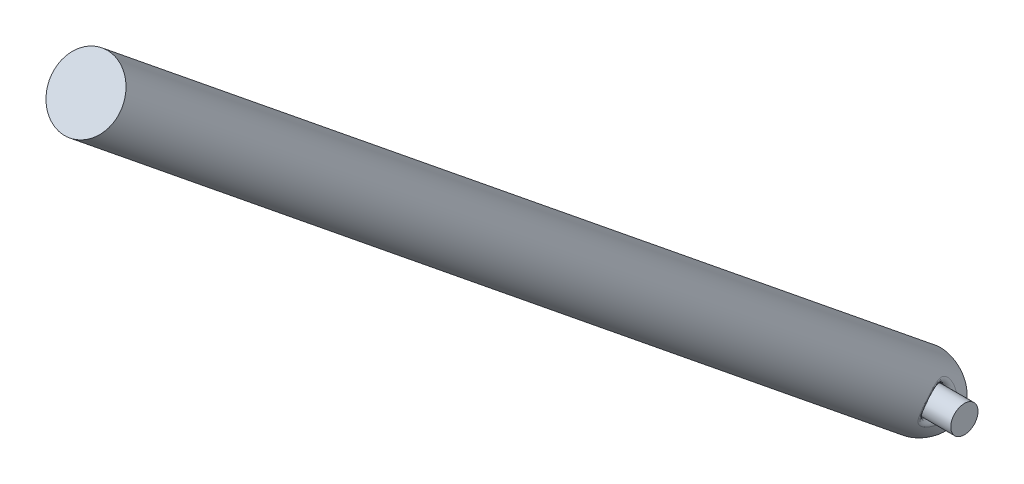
ISO-10303-21;
HEADER;
FILE_DESCRIPTION(('STEP AP214'),'2;1');
FILE_NAME('part.step','',(''),(''),'','','');
FILE_SCHEMA(('AUTOMOTIVE_DESIGN { 1 0 10303 214 1 1 1 1 }'));
ENDSEC;
DATA;
#1=APPLICATION_CONTEXT('core data for automotive mechanical design processes');
#2=APPLICATION_PROTOCOL_DEFINITION('international standard','automotive_design',2000,#1);
#3=PRODUCT_CONTEXT('',#1,'mechanical');
#4=PRODUCT('Part','Part','',(#3));
#5=PRODUCT_RELATED_PRODUCT_CATEGORY('part','',(#4));
#6=PRODUCT_DEFINITION_FORMATION('','',#4);
#7=PRODUCT_DEFINITION_CONTEXT('part definition',#1,'design');
#8=PRODUCT_DEFINITION('design','',#6,#7);
#9=PRODUCT_DEFINITION_SHAPE('','',#8);
#10=(LENGTH_UNIT() NAMED_UNIT(*) SI_UNIT(.MILLI.,.METRE.));
#11=(NAMED_UNIT(*) PLANE_ANGLE_UNIT() SI_UNIT($,.RADIAN.));
#12=(NAMED_UNIT(*) SI_UNIT($,.STERADIAN.) SOLID_ANGLE_UNIT());
#13=UNCERTAINTY_MEASURE_WITH_UNIT(LENGTH_MEASURE(1.E-05),#10,'distance_accuracy_value','');
#14=(GEOMETRIC_REPRESENTATION_CONTEXT(3) GLOBAL_UNCERTAINTY_ASSIGNED_CONTEXT((#13)) GLOBAL_UNIT_ASSIGNED_CONTEXT((#10,
#11,#12)) REPRESENTATION_CONTEXT('',''));
#15=CARTESIAN_POINT('',(0.,0.,0.));
#16=DIRECTION('',(0.,0.,1.));
#17=DIRECTION('',(1.,0.,0.));
#18=AXIS2_PLACEMENT_3D('',#15,#16,#17);
#19=CARTESIAN_POINT('',(-1436.35838867,0.,0.));
#20=DIRECTION('',(1.,0.,0.));
#21=DIRECTION('',(0.,0.,-1.));
#22=AXIS2_PLACEMENT_3D('',#19,#20,#21);
#23=PLANE('',#22);
#24=CARTESIAN_POINT('',(-1436.35838867,462.082062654,1391.17443848));
#25=DIRECTION('',(1.,0.,0.));
#26=DIRECTION('',(0.,0.,-1.));
#27=AXIS2_PLACEMENT_3D('',#24,#25,#26);
#28=CIRCLE('',#27,7.03410289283);
#29=CARTESIAN_POINT('',(-1436.35838867,462.082062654,1384.14033558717));
#30=VERTEX_POINT('',#29);
#31=EDGE_CURVE('P0_E17',#30,#30,#28,.T.);
#32=ORIENTED_EDGE('',*,*,#31,.F.);
#33=EDGE_LOOP('',(#32));
#34=FACE_BOUND('',#33,.T.);
#35=ADVANCED_FACE('P0_F14',(#34),#23,.F.);
#36=CARTESIAN_POINT('',(-1376.35838867,0.,0.));
#37=DIRECTION('',(1.,0.,0.));
#38=DIRECTION('',(0.,0.,-1.));
#39=AXIS2_PLACEMENT_3D('',#36,#37,#38);
#40=PLANE('',#39);
#41=CARTESIAN_POINT('',(-1376.35838867,462.082062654,1391.17443848));
#42=DIRECTION('',(1.,0.,0.));
#43=DIRECTION('',(0.,0.,-1.));
#44=AXIS2_PLACEMENT_3D('',#41,#42,#43);
#45=CIRCLE('',#44,7.03410289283);
#46=CARTESIAN_POINT('',(-1376.35838867,462.082062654,1384.14033558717));
#47=VERTEX_POINT('',#46);
#48=EDGE_CURVE('P0_E10',#47,#47,#45,.F.);
#49=ORIENTED_EDGE('',*,*,#48,.F.);
#50=EDGE_LOOP('',(#49));
#51=FACE_BOUND('',#50,.T.);
#52=ADVANCED_FACE('P0_F29',(#51),#40,.T.);
#53=CARTESIAN_POINT('',(-1406.35838867,462.082062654,1391.17443848));
#54=DIRECTION('',(1.,0.,0.));
#55=DIRECTION('',(0.,0.,-1.));
#56=AXIS2_PLACEMENT_3D('',#53,#54,#55);
#57=CYLINDRICAL_SURFACE('',#56,7.03410289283);
#58=ORIENTED_EDGE('',*,*,#31,.T.);
#59=EDGE_LOOP('',(#58));
#60=FACE_BOUND('',#59,.T.);
#61=ORIENTED_EDGE('',*,*,#48,.T.);
#62=EDGE_LOOP('',(#61));
#63=FACE_BOUND('',#62,.T.);
#64=ADVANCED_FACE('P0_F26',(#60,#63),#57,.T.);
#65=CLOSED_SHELL('',(#35,#52,#64));
#66=MANIFOLD_SOLID_BREP('P0_B1',#65);
#67=CARTESIAN_POINT('',(-1422.02968382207,452.355789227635,1391.5373174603));
#68=CARTESIAN_POINT('',(-1422.15374759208,452.715613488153,1391.58506084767));
#69=CARTESIAN_POINT('',(-1422.19553780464,453.107245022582,1391.60709126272));
#70=CARTESIAN_POINT('',(-1422.14525149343,453.503126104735,1391.59964673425));
#71=CARTESIAN_POINT('',(-1421.86884126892,454.238399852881,1391.5270280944));
#72=CARTESIAN_POINT('',(-1421.30606230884,454.764535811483,1391.35778787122));
#73=CARTESIAN_POINT('',(-1420.96896165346,454.950953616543,1391.25357121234));
#74=CARTESIAN_POINT('',(-1420.60381075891,455.045393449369,1391.13830447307));
#75=CARTESIAN_POINT('',(-1420.23867872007,455.047957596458,1391.02101188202));
#76=CARTESIAN_POINT('',(-1422.01545749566,452.353302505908,1391.57873959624));
#77=CARTESIAN_POINT('',(-1422.14062569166,452.713443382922,1391.62522002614));
#78=CARTESIAN_POINT('',(-1422.18336783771,453.105597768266,1391.64582074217));
#79=CARTESIAN_POINT('',(-1422.13376481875,453.502106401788,1391.6368682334));
#80=CARTESIAN_POINT('',(-1421.85809347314,454.238545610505,1391.56133579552));
#81=CARTESIAN_POINT('',(-1421.29495680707,454.765263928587,1391.38984506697));
#82=CARTESIAN_POINT('',(-1420.95743865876,454.951723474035,1391.28478399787));
#83=CARTESIAN_POINT('',(-1420.59174893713,455.045906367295,1391.16905054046));
#84=CARTESIAN_POINT('',(-1420.22607826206,455.047957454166,1391.05169767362));
#85=CARTESIAN_POINT('',(-1422.00123116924,452.350815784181,1391.62016173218));
#86=CARTESIAN_POINT('',(-1422.12750379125,452.711273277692,1391.6653792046));
#87=CARTESIAN_POINT('',(-1422.17119787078,453.103950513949,1391.68455022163));
#88=CARTESIAN_POINT('',(-1422.12227814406,453.501086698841,1391.67408973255));
#89=CARTESIAN_POINT('',(-1421.84734567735,454.238691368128,1391.59564349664));
#90=CARTESIAN_POINT('',(-1421.2838513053,454.76599204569,1391.42190226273));
#91=CARTESIAN_POINT('',(-1420.94591566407,454.952493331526,1391.3159967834));
#92=CARTESIAN_POINT('',(-1420.57968711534,455.046419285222,1391.19979660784));
#93=CARTESIAN_POINT('',(-1420.21347780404,455.047957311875,1391.08238346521));
#94=CARTESIAN_POINT('',(-1421.98700484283,452.348329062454,1391.66158386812));
#95=CARTESIAN_POINT('',(-1422.11438189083,452.709103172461,1391.70553838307));
#96=CARTESIAN_POINT('',(-1422.15902790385,453.102303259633,1391.72327970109));
#97=CARTESIAN_POINT('',(-1422.11079146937,453.500066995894,1391.7113112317));
#98=CARTESIAN_POINT('',(-1421.83659788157,454.238837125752,1391.62995119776));
#99=CARTESIAN_POINT('',(-1421.27274580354,454.766720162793,1391.45395945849));
#100=CARTESIAN_POINT('',(-1420.93439266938,454.953263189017,1391.34720956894));
#101=CARTESIAN_POINT('',(-1420.56762529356,455.046932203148,1391.23054267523));
#102=CARTESIAN_POINT('',(-1420.20087734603,455.047957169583,1391.11306925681));
#103=CARTESIAN_POINT('',(-1421.97277851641,452.345842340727,1391.70300600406));
#104=CARTESIAN_POINT('',(-1422.10125999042,452.706933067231,1391.74569756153));
#105=CARTESIAN_POINT('',(-1422.14685793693,453.100656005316,1391.76200918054));
#106=CARTESIAN_POINT('',(-1422.09930479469,453.499047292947,1391.74853273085));
#107=CARTESIAN_POINT('',(-1421.82585008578,454.238982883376,1391.66425889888));
#108=CARTESIAN_POINT('',(-1421.26164030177,454.767448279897,1391.48601665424));
#109=CARTESIAN_POINT('',(-1420.92286967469,454.954033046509,1391.37842235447));
#110=CARTESIAN_POINT('',(-1420.55556347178,455.047445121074,1391.26128874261));
#111=CARTESIAN_POINT('',(-1420.18827688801,455.047957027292,1391.1437550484));
#112=CARTESIAN_POINT('',(-1421.95855219,452.343355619,1391.74442814));
#113=CARTESIAN_POINT('',(-1422.08813809,452.704762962,1391.78585674));
#114=CARTESIAN_POINT('',(-1422.13468797,453.099008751,1391.80073866));
#115=CARTESIAN_POINT('',(-1422.08781812,453.49802759,1391.78575423));
#116=CARTESIAN_POINT('',(-1421.81510229,454.239128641,1391.6985666));
#117=CARTESIAN_POINT('',(-1421.2505348,454.768176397,1391.51807385));
#118=CARTESIAN_POINT('',(-1420.91134668,454.954802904,1391.40963514));
#119=CARTESIAN_POINT('',(-1420.54350165,455.047958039,1391.29203481));
#120=CARTESIAN_POINT('',(-1420.17567643,455.047956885,1391.17444084));
#121=CARTESIAN_POINT('',(-1421.557532,452.273258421,1392.91206006));
#122=CARTESIAN_POINT('',(-1421.71825012,452.643590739,1392.91788766));
#123=CARTESIAN_POINT('',(-1421.79163367,453.052574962,1392.89246837));
#124=CARTESIAN_POINT('',(-1421.76402487,453.469283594,1392.83497609));
#125=CARTESIAN_POINT('',(-1421.512137,454.243237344,1392.66565258));
#126=CARTESIAN_POINT('',(-1420.93748628,454.788700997,1392.42172124));
#127=CARTESIAN_POINT('',(-1420.58652962,454.976504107,1392.28947979));
#128=CARTESIAN_POINT('',(-1420.20349581,455.062416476,1392.15872333));
#129=CARTESIAN_POINT('',(-1419.82048719,455.047952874,1392.03943027));
#130=CARTESIAN_POINT('',(-1421.16618316,452.387443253,1394.08506684));
#131=CARTESIAN_POINT('',(-1421.35968365,452.758692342,1394.04962327));
#132=CARTESIAN_POINT('',(-1421.46174434,453.174492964,1393.97816211));
#133=CARTESIAN_POINT('',(-1421.45485755,453.601528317,1393.87330034));
#134=CARTESIAN_POINT('',(-1421.2251617,454.395259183,1393.61607606));
#135=CARTESIAN_POINT('',(-1420.63872146,454.948214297,1393.31306128));
#136=CARTESIAN_POINT('',(-1420.27436026,455.133977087,1393.16229961));
#137=CARTESIAN_POINT('',(-1419.87409601,455.210856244,1393.02675719));
#138=CARTESIAN_POINT('',(-1419.47386364,455.181755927,1392.91643296));
#139=CARTESIAN_POINT('',(-1420.81774707,452.689738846,1395.25122981));
#140=CARTESIAN_POINT('',(-1421.04676803,453.053067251,1395.16450808));
#141=CARTESIAN_POINT('',(-1421.18072007,453.466763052,1395.03706444));
#142=CARTESIAN_POINT('',(-1421.1971587,453.895787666,1394.87660662));
#143=CARTESIAN_POINT('',(-1420.99190126,454.694526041,1394.52217833));
#144=CARTESIAN_POINT('',(-1420.38993415,455.245614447,1394.1680186));
#145=CARTESIAN_POINT('',(-1420.0087264,455.426390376,1394.00780812));
#146=CARTESIAN_POINT('',(-1419.58696684,455.493490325,1393.88122754));
#147=CARTESIAN_POINT('',(-1419.16524906,455.451609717,1393.79653422));
#148=CARTESIAN_POINT('',(-1420.49242899,453.565828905,1397.05571524));
#149=CARTESIAN_POINT('',(-1420.75770258,453.878547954,1396.86444659));
#150=CARTESIAN_POINT('',(-1420.92447314,454.247226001,1396.62791735));
#151=CARTESIAN_POINT('',(-1420.96501747,454.640150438,1396.36544045));
#152=CARTESIAN_POINT('',(-1420.78480469,455.38708321,1395.8469501));
#153=CARTESIAN_POINT('',(-1420.16592076,455.92600426,1395.43570953));
#154=CARTESIAN_POINT('',(-1419.76662584,456.110362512,1395.28076723));
#155=CARTESIAN_POINT('',(-1419.32184136,456.189060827,1395.19377152));
#156=CARTESIAN_POINT('',(-1418.87711004,456.165140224,1395.17614073));
#157=CARTESIAN_POINT('',(-1420.60505543,454.936443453,1398.50032147));
#158=CARTESIAN_POINT('',(-1420.85770058,455.166355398,1398.22131906));
#159=CARTESIAN_POINT('',(-1421.01303329,455.45027573,1397.89861574));
#160=CARTESIAN_POINT('',(-1421.0451741,455.765482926,1397.56002571));
#161=CARTESIAN_POINT('',(-1420.8562353,456.389955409,1396.92488551));
#162=CARTESIAN_POINT('',(-1420.24326858,456.89068056,1396.48091397));
#163=CARTESIAN_POINT('',(-1419.85029444,457.081825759,1396.33398554));
#164=CARTESIAN_POINT('',(-1419.41355512,457.192901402,1396.27814955));
#165=CARTESIAN_POINT('',(-1418.97686498,457.221458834,1396.30972489));
#166=CARTESIAN_POINT('',(-1420.71332457,455.517501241,1398.98103109));
#167=CARTESIAN_POINT('',(-1420.95385086,455.714177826,1398.67490047));
#168=CARTESIAN_POINT('',(-1421.09820413,455.962986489,1398.32658141));
#169=CARTESIAN_POINT('',(-1421.12227801,456.244983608,1397.96605106));
#170=CARTESIAN_POINT('',(-1420.92496097,456.815546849,1397.29753872));
#171=CARTESIAN_POINT('',(-1420.31766867,457.296810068,1396.84332436));
#172=CARTESIAN_POINT('',(-1419.93075793,457.489292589,1396.69762436));
#173=CARTESIAN_POINT('',(-1419.50173648,457.613089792,1396.64890548));
#174=CARTESIAN_POINT('',(-1419.0727604,457.663543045,1396.69237543));
#175=CARTESIAN_POINT('',(-1421.17828359,457.349946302,1400.1779778));
#176=CARTESIAN_POINT('',(-1421.37099464,457.454029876,1399.81362782));
#177=CARTESIAN_POINT('',(-1421.4724051,457.602500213,1399.41334647));
#178=CARTESIAN_POINT('',(-1421.46506037,457.786703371,1399.01009452));
#179=CARTESIAN_POINT('',(-1421.23485548,458.192116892,1398.27636109));
#180=CARTESIAN_POINT('',(-1420.64859541,458.599861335,1397.79663376));
#181=CARTESIAN_POINT('',(-1420.28446726,458.786423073,1397.64792536));
#182=CARTESIAN_POINT('',(-1419.88450847,458.937639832,1397.60489533));
#183=CARTESIAN_POINT('',(-1419.48458145,459.043833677,1397.66193897));
#184=CARTESIAN_POINT('',(-1421.93912488,459.436354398,1400.73165287));
#185=CARTESIAN_POINT('',(-1422.06664314,459.467240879,1400.3616224));
#186=CARTESIAN_POINT('',(-1422.11084595,459.530889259,1399.96507052));
#187=CARTESIAN_POINT('',(-1422.06210151,459.625605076,1399.57074585));
#188=CARTESIAN_POINT('',(-1421.78768678,459.863128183,1398.85186159));
#189=CARTESIAN_POINT('',(-1421.22550097,460.157677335,1398.36537365));
#190=CARTESIAN_POINT('',(-1420.88855699,460.309526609,1398.20380128));
#191=CARTESIAN_POINT('',(-1420.52350407,460.453692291,1398.1374889));
#192=CARTESIAN_POINT('',(-1420.15846905,460.58021651,1398.16433254));
#193=CARTESIAN_POINT('',(-1422.45535021,460.849381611,1400.83848703));
#194=CARTESIAN_POINT('',(-1422.54648984,460.841905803,1400.47738953));
#195=CARTESIAN_POINT('',(-1422.55986542,460.86007907,1400.09552892));
#196=CARTESIAN_POINT('',(-1422.48917533,460.904877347,1399.71809899));
#197=CARTESIAN_POINT('',(-1422.19068316,461.042104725,1399.02800017));
#198=CARTESIAN_POINT('',(-1421.63853857,461.251928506,1398.54847826));
#199=CARTESIAN_POINT('',(-1421.31387468,461.369420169,1398.38189234));
#200=CARTESIAN_POINT('',(-1420.96477928,461.491162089,1398.30093144));
#201=CARTESIAN_POINT('',(-1420.61569718,461.609069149,1398.30523694));
#202=CARTESIAN_POINT('',(-1423.2042426,463.177522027,1400.60762862));
#203=CARTESIAN_POINT('',(-1423.24499028,463.108365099,1400.27201519));
#204=CARTESIAN_POINT('',(-1423.21639171,463.054872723,1399.92372032));
#205=CARTESIAN_POINT('',(-1423.11604377,463.021524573,1399.5827037));
#206=CARTESIAN_POINT('',(-1422.78479871,463.000143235,1398.9579206));
#207=CARTESIAN_POINT('',(-1422.24514275,463.067854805,1398.51092685));
#208=CARTESIAN_POINT('',(-1421.93618833,463.123687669,1398.34786684));
#209=CARTESIAN_POINT('',(-1421.6075914,463.198298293,1398.25548315));
#210=CARTESIAN_POINT('',(-1421.27900232,463.286529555,1398.23491171));
#211=CARTESIAN_POINT('',(-1423.67173552,465.426153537,1399.72406007));
#212=CARTESIAN_POINT('',(-1423.68326614,465.296806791,1399.42796756));
#213=CARTESIAN_POINT('',(-1423.63090848,465.175269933,1399.12555002));
#214=CARTESIAN_POINT('',(-1423.51396087,465.068591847,1398.83270145));
#215=CARTESIAN_POINT('',(-1423.16415539,464.897191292,1398.2991301));
#216=CARTESIAN_POINT('',(-1422.63041522,464.823105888,1397.91858913));
#217=CARTESIAN_POINT('',(-1422.32938818,464.813819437,1397.77889083));
#218=CARTESIAN_POINT('',(-1422.01122482,464.832906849,1397.69763434));
#219=CARTESIAN_POINT('',(-1421.69306721,464.877960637,1397.6758901));
#220=CARTESIAN_POINT('',(-1423.79621775,466.253772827,1399.29819168));
#221=CARTESIAN_POINT('',(-1423.80004897,466.10140309,1399.01845621));
#222=CARTESIAN_POINT('',(-1423.74147136,465.954142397,1398.7345811));
#223=CARTESIAN_POINT('',(-1423.62019066,465.820002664,1398.46115906));
#224=CARTESIAN_POINT('',(-1423.26553288,465.592760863,1397.96511851));
#225=CARTESIAN_POINT('',(-1422.73329073,465.466101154,1397.6145789));
#226=CARTESIAN_POINT('',(-1422.43429345,465.432618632,1397.48676598));
#227=CARTESIAN_POINT('',(-1422.11880561,465.43086028,1397.41339192));
#228=CARTESIAN_POINT('',(-1421.803323,465.459314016,1397.39530186));
#229=CARTESIAN_POINT('',(-1423.85838867,467.038538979,1398.78487519));
#230=CARTESIAN_POINT('',(-1423.85838867,466.863295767,1398.52255558));
#231=CARTESIAN_POINT('',(-1423.79671748,466.690605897,1398.25816405));
#232=CARTESIAN_POINT('',(-1423.67328241,466.52949621,1398.00520391));
#233=CARTESIAN_POINT('',(-1423.31621034,466.247813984,1397.54943109));
#234=CARTESIAN_POINT('',(-1422.78470582,466.070662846,1397.23345895));
#235=CARTESIAN_POINT('',(-1422.48671218,466.014159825,1397.12040057));
#236=CARTESIAN_POINT('',(-1422.17254793,465.992779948,1397.05837218));
#237=CARTESIAN_POINT('',(-1421.85838867,466.005801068,1397.04783875));
#238=CARTESIAN_POINT('',(-1423.85838867,467.763870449,1398.19811809));
#239=CARTESIAN_POINT('',(-1423.85838867,467.566286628,1397.95387092));
#240=CARTESIAN_POINT('',(-1423.79671749,467.368699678,1397.70961988));
#241=CARTESIAN_POINT('',(-1423.67328241,467.181282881,1397.47794089));
#242=CARTESIAN_POINT('',(-1423.31621035,466.847004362,1397.06471585));
#243=CARTESIAN_POINT('',(-1422.78470583,466.622431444,1396.78710558));
#244=CARTESIAN_POINT('',(-1422.48671218,466.544799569,1396.69113939));
#245=CARTESIAN_POINT('',(-1422.17254794,466.506012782,1396.64319234));
#246=CARTESIAN_POINT('',(-1421.85838867,466.506012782,1396.64319234));
#247=B_SPLINE_SURFACE_WITH_KNOTS('',5,5,((#67,#68,#69,#70,#71,#72,#73,#74,#75),(#76,#77,#78,#79,
#80,#81,#82,#83,#84),(#85,#86,#87,#88,#89,#90,#91,#92,#93),(#94,#95,#96,#97,#98,#99,#100,#101,
#102),(#103,#104,#105,#106,#107,#108,#109,#110,#111),(#112,#113,#114,#115,#116,#117,#118,#119,
#120),(#121,#122,#123,#124,#125,#126,#127,#128,#129),(#130,#131,#132,#133,#134,#135,#136,#137,
#138),(#139,#140,#141,#142,#143,#144,#145,#146,#147),(#148,#149,#150,#151,#152,#153,#154,#155,
#156),(#157,#158,#159,#160,#161,#162,#163,#164,#165),(#166,#167,#168,#169,#170,#171,#172,#173,
#174),(#175,#176,#177,#178,#179,#180,#181,#182,#183),(#184,#185,#186,#187,#188,#189,#190,#191,
#192),(#193,#194,#195,#196,#197,#198,#199,#200,#201),(#202,#203,#204,#205,#206,#207,#208,#209,
#210),(#211,#212,#213,#214,#215,#216,#217,#218,#219),(#220,#221,#222,#223,#224,#225,#226,#227,
#228),(#229,#230,#231,#232,#233,#234,#235,#236,#237),(#238,#239,#240,#241,#242,#243,#244,#245,
#246)),.UNSPECIFIED.,.F.,.F.,.F.,(6,5,3,3,3,6),(6,3,6),(38.423408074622,38.6982784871,
46.4464899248,51.2162136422,60.5188821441,66.1853197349),(0.,1.,2.),.UNSPECIFIED.);
#248=CARTESIAN_POINT('',(-1423.85839054,467.763872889,1398.1981211));
#249=CARTESIAN_POINT('',(-1423.85839059,467.566288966,1397.9538738));
#250=CARTESIAN_POINT('',(-1423.79671944,467.368701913,1397.70962263));
#251=CARTESIAN_POINT('',(-1423.67328438,467.181285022,1397.4779435));
#252=CARTESIAN_POINT('',(-1423.3162123,466.847006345,1397.06471825));
#253=CARTESIAN_POINT('',(-1422.78470768,466.622433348,1396.78710787));
#254=CARTESIAN_POINT('',(-1422.48671397,466.544801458,1396.69114166));
#255=CARTESIAN_POINT('',(-1422.17254966,466.506014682,1396.64319461));
#256=CARTESIAN_POINT('',(-1421.85839032,466.506014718,1396.64319465));
#257=B_SPLINE_CURVE_WITH_KNOTS('',5,(#248,#249,#250,#251,#252,#253,#254,#255,#256),
.UNSPECIFIED.,.F.,.F.,(6,3,6),(0.,1.,2.),.UNSPECIFIED.);
#258=CARTESIAN_POINT('',(-1421.85838933,466.506013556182,1396.64319326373));
#259=VERTEX_POINT('',#258);
#260=CARTESIAN_POINT('',(-1423.858389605,467.763871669,1398.198119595));
#261=VERTEX_POINT('',#260);
#262=EDGE_CURVE('P1_E90',#259,#261,#257,.F.);
#263=CARTESIAN_POINT('',(-1421.85838867,466.506012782,1396.64319234));
#264=CARTESIAN_POINT('',(-1421.85839119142,466.442821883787,1396.69431350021));
#265=CARTESIAN_POINT('',(-1421.85733430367,466.378742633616,1396.744335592));
#266=CARTESIAN_POINT('',(-1421.85311776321,466.248913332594,1396.84211171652));
#267=CARTESIAN_POINT('',(-1421.84995747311,466.183162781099,1396.88986505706));
#268=CARTESIAN_POINT('',(-1421.84154756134,466.050093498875,1396.98303188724));
#269=CARTESIAN_POINT('',(-1421.8362966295,465.982773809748,1397.0284438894));
#270=CARTESIAN_POINT('',(-1421.82373287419,465.846672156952,1397.1168680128));
#271=CARTESIAN_POINT('',(-1421.81641806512,465.777888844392,1397.15987777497));
#272=CARTESIAN_POINT('',(-1421.79976263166,465.638966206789,1397.24344476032));
#273=CARTESIAN_POINT('',(-1421.79041938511,465.568825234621,1397.28399872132));
#274=CARTESIAN_POINT('',(-1421.76975231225,465.427293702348,1397.36260910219));
#275=CARTESIAN_POINT('',(-1421.75842530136,465.3559013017,1397.40066136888));
#276=CARTESIAN_POINT('',(-1421.73384405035,465.211972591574,1397.47423005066));
#277=CARTESIAN_POINT('',(-1421.72058616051,465.139434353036,1397.50974146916));
#278=CARTESIAN_POINT('',(-1421.69220400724,464.993318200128,1397.57819621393));
#279=CARTESIAN_POINT('',(-1421.6770757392,464.919738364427,1397.6111337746));
#280=CARTESIAN_POINT('',(-1421.64502047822,464.771641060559,1397.67441393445));
#281=CARTESIAN_POINT('',(-1421.62808923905,464.697121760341,1397.7047500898));
#282=CARTESIAN_POINT('',(-1421.59250180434,464.54724465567,1397.76280526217));
#283=CARTESIAN_POINT('',(-1421.57384122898,464.471885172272,1397.79051725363));
#284=CARTESIAN_POINT('',(-1421.53487434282,464.320423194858,1397.84330599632));
#285=CARTESIAN_POINT('',(-1421.51456361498,464.244319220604,1397.86837523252));
#286=CARTESIAN_POINT('',(-1421.47238041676,464.091459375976,1397.91586361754));
#287=CARTESIAN_POINT('',(-1421.45050357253,464.014702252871,1397.93827484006));
#288=CARTESIAN_POINT('',(-1421.40527630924,463.860622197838,1397.98043559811));
#289=CARTESIAN_POINT('',(-1421.38192162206,463.783298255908,1398.00017685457));
#290=CARTESIAN_POINT('',(-1421.33383045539,463.62816568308,1398.03698605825));
#291=CARTESIAN_POINT('',(-1421.30908987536,463.550356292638,1398.05404543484));
#292=CARTESIAN_POINT('',(-1421.25832637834,463.394338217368,1398.08549633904));
#293=CARTESIAN_POINT('',(-1421.23229968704,463.316129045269,1398.09987934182));
#294=CARTESIAN_POINT('',(-1421.17906611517,463.159392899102,1398.12598369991));
#295=CARTESIAN_POINT('',(-1421.15185583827,463.080865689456,1398.13769669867));
#296=CARTESIAN_POINT('',(-1421.09635876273,462.92356786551,1398.15846441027));
#297=CARTESIAN_POINT('',(-1421.06806893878,462.844797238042,1398.16751092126));
#298=CARTESIAN_POINT('',(-1421.01051843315,462.687080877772,1398.18294744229));
#299=CARTESIAN_POINT('',(-1420.9812550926,462.608135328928,1398.18932939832));
#300=CARTESIAN_POINT('',(-1420.92186551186,462.450132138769,1398.19943672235));
#301=CARTESIAN_POINT('',(-1420.89173697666,462.371074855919,1398.2031541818));
#302=CARTESIAN_POINT('',(-1420.83072760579,462.212906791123,1398.20793067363));
#303=CARTESIAN_POINT('',(-1420.79984483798,462.133796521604,1398.20898194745));
#304=CARTESIAN_POINT('',(-1420.73744057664,461.975577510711,1398.20842248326));
#305=CARTESIAN_POINT('',(-1420.70591751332,461.896469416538,1398.20680414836));
#306=CARTESIAN_POINT('',(-1420.64234955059,461.738307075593,1398.20090017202));
#307=CARTESIAN_POINT('',(-1420.61030344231,461.659253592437,1398.19660711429));
#308=CARTESIAN_POINT('',(-1420.54580993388,461.501250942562,1398.18534671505));
#309=CARTESIAN_POINT('',(-1420.51336168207,461.422302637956,1398.17837216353));
#310=CARTESIAN_POINT('',(-1420.44818842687,461.2645598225,1398.16174014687));
#311=CARTESIAN_POINT('',(-1420.4154629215,461.185766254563,1398.15207570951));
#312=CARTESIAN_POINT('',(-1420.34986403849,461.028382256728,1398.1300536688));
#313=CARTESIAN_POINT('',(-1420.31699049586,460.949792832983,1398.11768936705));
#314=CARTESIAN_POINT('',(-1420.25122910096,460.792867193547,1398.09025575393));
#315=CARTESIAN_POINT('',(-1420.2183414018,460.714532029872,1398.07518005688));
#316=CARTESIAN_POINT('',(-1420.15269028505,460.558166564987,1398.04231025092));
#317=CARTESIAN_POINT('',(-1420.1199273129,460.480137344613,1398.02451010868));
#318=CARTESIAN_POINT('',(-1420.05466961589,460.324437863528,1397.98617648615));
#319=CARTESIAN_POINT('',(-1420.02217559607,460.246768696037,1397.96563736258));
#320=CARTESIAN_POINT('',(-1419.9576054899,460.091846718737,1397.92180936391));
#321=CARTESIAN_POINT('',(-1419.92553032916,460.014594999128,1397.89851526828));
#322=CARTESIAN_POINT('',(-1419.8619536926,459.860569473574,1397.84915946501));
#323=CARTESIAN_POINT('',(-1419.83045331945,459.783796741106,1397.82309298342));
#324=CARTESIAN_POINT('',(-1419.76818841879,459.630795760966,1397.76817314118));
#325=CARTESIAN_POINT('',(-1419.73742512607,459.554568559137,1397.7393154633));
#326=CARTESIAN_POINT('',(-1419.6768032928,459.402731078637,1397.67879261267));
#327=CARTESIAN_POINT('',(-1419.64694607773,459.327121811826,1397.64712357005));
#328=CARTESIAN_POINT('',(-1419.58831239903,459.176599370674,1397.58095603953));
#329=CARTESIAN_POINT('',(-1419.55953732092,459.101687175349,1397.54645409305));
#330=CARTESIAN_POINT('',(-1419.50325128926,458.952645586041,1397.4745976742));
#331=CARTESIAN_POINT('',(-1419.47574177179,458.878517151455,1397.43724008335));
#332=CARTESIAN_POINT('',(-1419.42217809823,458.731138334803,1397.35964769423));
#333=CARTESIAN_POINT('',(-1419.39612545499,458.65788892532,1397.3194100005));
#334=CARTESIAN_POINT('',(-1419.34567544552,458.512375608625,1397.23603522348));
#335=CARTESIAN_POINT('',(-1419.32127967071,458.440112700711,1397.19289542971));
#336=CARTESIAN_POINT('',(-1419.27434151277,458.296694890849,1397.10371957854));
#337=CARTESIAN_POINT('',(-1419.25180060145,458.225540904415,1397.05768127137));
#338=CARTESIAN_POINT('',(-1419.20876817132,458.084478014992,1396.9627254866));
#339=CARTESIAN_POINT('',(-1419.1882778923,458.014569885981,1396.91380629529));
#340=CARTESIAN_POINT('',(-1419.14953609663,457.876146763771,1396.81312139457));
#341=CARTESIAN_POINT('',(-1419.13128555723,457.807632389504,1396.7613544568));
#342=CARTESIAN_POINT('',(-1419.097202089,457.672153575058,1396.65502297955));
#343=CARTESIAN_POINT('',(-1419.08136990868,457.605189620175,1396.60045758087));
#344=CARTESIAN_POINT('',(-1419.05228751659,457.472974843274,1396.48859540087));
#345=CARTESIAN_POINT('',(-1419.03903791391,457.407724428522,1396.43129797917));
#346=CARTESIAN_POINT('',(-1419.01526661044,457.279104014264,1396.31405618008));
#347=CARTESIAN_POINT('',(-1419.0047455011,457.215734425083,1396.2541112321));
#348=CARTESIAN_POINT('',(-1418.98655475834,457.091044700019,1396.1316779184));
#349=CARTESIAN_POINT('',(-1418.97888581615,457.029725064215,1396.06918894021));
#350=CARTESIAN_POINT('',(-1418.96649680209,456.909303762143,1395.94179102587));
#351=CARTESIAN_POINT('',(-1418.96177758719,456.850202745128,1395.87688139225));
#352=CARTESIAN_POINT('',(-1418.95535519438,456.734384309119,1395.74478648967));
#353=CARTESIAN_POINT('',(-1418.95365300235,456.677667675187,1395.67760048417));
#354=CARTESIAN_POINT('',(-1418.95329863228,456.566778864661,1395.54111832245));
#355=CARTESIAN_POINT('',(-1418.95464738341,456.512607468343,1395.47182152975));
#356=CARTESIAN_POINT('',(-1418.96038883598,456.406963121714,1395.33130886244));
#357=CARTESIAN_POINT('',(-1418.96478196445,456.355490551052,1395.26009271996));
#358=CARTESIAN_POINT('',(-1418.97653449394,456.255364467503,1395.11596278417));
#359=CARTESIAN_POINT('',(-1418.98389341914,456.206710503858,1395.04304926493));
#360=CARTESIAN_POINT('',(-1419.00147662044,456.112319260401,1394.89573419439));
#361=CARTESIAN_POINT('',(-1419.01169988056,456.066580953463,1394.82133317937));
#362=CARTESIAN_POINT('',(-1419.0348876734,455.978093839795,1394.67123951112));
#363=CARTESIAN_POINT('',(-1419.04785099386,455.935343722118,1394.59554744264));
#364=CARTESIAN_POINT('',(-1419.0763754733,455.852883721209,1394.44305455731));
#365=CARTESIAN_POINT('',(-1419.09193541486,455.813172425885,1394.3662542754));
#366=CARTESIAN_POINT('',(-1419.1254931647,455.73682105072,1394.21171475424));
#367=CARTESIAN_POINT('',(-1419.14348982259,455.700179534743,1394.13397597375));
#368=CARTESIAN_POINT('',(-1419.18174753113,455.629981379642,1393.97771643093));
#369=CARTESIAN_POINT('',(-1419.20200748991,455.596423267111,1393.89919606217));
#370=CARTESIAN_POINT('',(-1419.24460774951,455.532390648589,1393.74151786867));
#371=CARTESIAN_POINT('',(-1419.26694696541,455.501914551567,1393.66236039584));
#372=CARTESIAN_POINT('',(-1419.31351401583,455.444032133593,1393.50354045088));
#373=CARTESIAN_POINT('',(-1419.33774071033,455.416623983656,1393.42387830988));
#374=CARTESIAN_POINT('',(-1419.38788618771,455.364853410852,1393.26416981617));
#375=CARTESIAN_POINT('',(-1419.41380372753,455.340488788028,1393.18412378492));
#376=CARTESIAN_POINT('',(-1419.46713240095,455.294773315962,1393.02375703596));
#377=CARTESIAN_POINT('',(-1419.49454216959,455.273419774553,1392.94343663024));
#378=CARTESIAN_POINT('',(-1419.55065767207,455.233688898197,1392.78261980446));
#379=CARTESIAN_POINT('',(-1419.57936193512,455.215308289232,1392.70212367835));
#380=CARTESIAN_POINT('',(-1419.63787248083,455.181482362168,1392.54104363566));
#381=CARTESIAN_POINT('',(-1419.66767723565,455.166033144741,1392.46045998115));
#382=CARTESIAN_POINT('',(-1419.72820135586,455.138028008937,1392.29928306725));
#383=CARTESIAN_POINT('',(-1419.75891920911,455.125467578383,1392.21869002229));
#384=CARTESIAN_POINT('',(-1419.82109139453,455.103199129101,1392.05756284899));
#385=CARTESIAN_POINT('',(-1419.85254431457,455.093486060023,1391.97702887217));
#386=CARTESIAN_POINT('',(-1419.91602098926,455.076875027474,1391.81607918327));
#387=CARTESIAN_POINT('',(-1419.94804351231,455.069971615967,1391.73566354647));
#388=CARTESIAN_POINT('',(-1420.01250776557,455.058947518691,1391.57500075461));
#389=CARTESIAN_POINT('',(-1420.04494851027,455.054821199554,1391.49475358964));
#390=CARTESIAN_POINT('',(-1420.11011944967,455.049329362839,1391.33447052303));
#391=CARTESIAN_POINT('',(-1420.14284893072,455.047958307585,1391.25443452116));
#392=CARTESIAN_POINT('',(-1420.1756917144,455.047956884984,1391.17444572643));
#393=B_SPLINE_CURVE_WITH_KNOTS('',3,(#263,#264,#265,#266,#267,#268,#269,#270,#271,#272,#273,
#274,#275,#276,#277,#278,#279,#280,#281,#282,#283,#284,#285,#286,#287,#288,#289,#290,#291,#292,
#293,#294,#295,#296,#297,#298,#299,#300,#301,#302,#303,#304,#305,#306,#307,#308,#309,#310,#311,
#312,#313,#314,#315,#316,#317,#318,#319,#320,#321,#322,#323,#324,#325,#326,#327,#328,#329,#330,
#331,#332,#333,#334,#335,#336,#337,#338,#339,#340,#341,#342,#343,#344,#345,#346,#347,#348,#349,
#350,#351,#352,#353,#354,#355,#356,#357,#358,#359,#360,#361,#362,#363,#364,#365,#366,#367,#368,
#369,#370,#371,#372,#373,#374,#375,#376,#377,#378,#379,#380,#381,#382,#383,#384,#385,#386,#387,
#388,#389,#390,#391,#392),.UNSPECIFIED.,.F.,.F.,(4,2,2,2,2,2,2,2,2,2,2,2,2,2,2,2,2,2,2,2,2,2,2,
2,2,2,2,2,2,2,2,2,2,2,2,2,2,2,2,2,2,2,2,2,2,2,2,2,2,2,2,2,2,2,2,2,2,2,2,2,2,2,2,2,4),(0.,
0.24382040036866,0.487714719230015,0.731762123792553,0.976045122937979,1.22064580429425,
1.46564280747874,1.7111090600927,1.95711028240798,2.2037042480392,2.4509407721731,
2.69886238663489,2.94750565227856,3.19690305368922,3.4470819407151,3.69804454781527,
3.9497821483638,4.20228617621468,4.4555480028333,4.7095584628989,4.96430724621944,
5.21978221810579,5.47596872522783,5.73284894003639,5.99040129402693,6.24860004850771,
6.50741505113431,6.76681172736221,7.02675135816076,7.28719169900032,7.54808800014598,
7.80939449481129,8.07106642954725,8.33306272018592,8.59534932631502,8.85790342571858,
9.12070624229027,9.38371561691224,9.64688305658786,9.91016491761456,10.1735281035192,
10.4369533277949,10.7004356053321,10.9639816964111,11.2276043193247,11.4913130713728,
11.7551021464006,12.0189282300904,12.282712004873,12.5464023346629,12.8099762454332,
13.0734269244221,13.3367536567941,13.5999538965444,13.8630175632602,14.1259235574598,
14.3886384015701,14.6511168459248,14.9133042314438,15.1751403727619,15.4365647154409,
15.6975225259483,15.9579718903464,16.2178913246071,16.4772878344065),.UNSPECIFIED.);
#394=CARTESIAN_POINT('',(-1420.17569322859,455.047958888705,1391.17444176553));
#395=VERTEX_POINT('',#394);
#396=EDGE_CURVE('P1_E83',#259,#395,#393,.T.);
#397=CARTESIAN_POINT('',(-1421.95857285,452.343362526,1391.74442333));
#398=CARTESIAN_POINT('',(-1422.08815725,452.704768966,1391.78585154));
#399=CARTESIAN_POINT('',(-1422.13470581,453.099013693,1391.80073318));
#400=CARTESIAN_POINT('',(-1422.08783502,453.498031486,1391.78574865));
#401=CARTESIAN_POINT('',(-1421.81511814,454.239130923,1391.69856117));
#402=CARTESIAN_POINT('',(-1421.25055109,454.768178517,1391.51806913));
#403=CARTESIAN_POINT('',(-1420.91136351,454.954805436,1391.40963086));
#404=CARTESIAN_POINT('',(-1420.54351919,455.047961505,1391.29203102));
#405=CARTESIAN_POINT('',(-1420.17569469,455.047961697,1391.1744375));
#406=B_SPLINE_CURVE_WITH_KNOTS('',5,(#397,#398,#399,#400,#401,#402,#403,#404,#405),
.UNSPECIFIED.,.F.,.F.,(6,3,6),(0.,1.,2.),.UNSPECIFIED.);
#407=CARTESIAN_POINT('',(-1421.95856639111,452.343364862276,1391.7444214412));
#408=VERTEX_POINT('',#407);
#409=EDGE_CURVE('P1_E86',#408,#395,#406,.T.);
#410=CARTESIAN_POINT('',(-1421.95855967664,452.343367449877,1391.74441934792));
#411=CARTESIAN_POINT('',(-1421.89936705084,452.333029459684,1391.9168304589));
#412=CARTESIAN_POINT('',(-1421.84031396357,452.327475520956,1392.08958665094));
#413=CARTESIAN_POINT('',(-1421.7232748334,452.326162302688,1392.43516629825));
#414=CARTESIAN_POINT('',(-1421.66528714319,452.330386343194,1392.60798913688));
#415=CARTESIAN_POINT('',(-1421.55103871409,452.34880624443,1392.95343207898));
#416=CARTESIAN_POINT('',(-1421.49477571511,452.362988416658,1393.1260521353));
#417=CARTESIAN_POINT('',(-1421.41226329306,452.391934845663,1393.38461054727));
#418=CARTESIAN_POINT('',(-1421.3850842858,452.402856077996,1393.4706972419));
#419=CARTESIAN_POINT('',(-1421.33146644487,452.427286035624,1393.64267413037));
#420=CARTESIAN_POINT('',(-1421.305027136,452.440793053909,1393.72856441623));
#421=CARTESIAN_POINT('',(-1421.25300023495,452.470427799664,1393.90008594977));
#422=CARTESIAN_POINT('',(-1421.22741208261,452.48655376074,1393.9857173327));
#423=CARTESIAN_POINT('',(-1421.1772002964,452.52145915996,1394.15665700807));
#424=CARTESIAN_POINT('',(-1421.15257601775,452.540236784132,1394.24196548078));
#425=CARTESIAN_POINT('',(-1421.10440656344,452.580476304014,1394.41218850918));
#426=CARTESIAN_POINT('',(-1421.08086066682,452.601936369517,1394.49710329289));
#427=CARTESIAN_POINT('',(-1421.03496284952,452.647568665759,1394.66646261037));
#428=CARTESIAN_POINT('',(-1421.01261015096,452.671739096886,1394.75090741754));
#429=CARTESIAN_POINT('',(-1420.9692129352,452.722816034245,1394.91924446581));
#430=CARTESIAN_POINT('',(-1420.94816761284,452.749720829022,1395.00313701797));
#431=CARTESIAN_POINT('',(-1420.90749758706,452.806285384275,1395.17028124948));
#432=CARTESIAN_POINT('',(-1420.88787208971,452.835943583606,1395.25353326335));
#433=CARTESIAN_POINT('',(-1420.85015132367,452.898027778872,1395.41930198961));
#434=CARTESIAN_POINT('',(-1420.8320553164,452.930452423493,1395.50181903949));
#435=CARTESIAN_POINT('',(-1420.79749924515,452.998075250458,1395.66601719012));
#436=CARTESIAN_POINT('',(-1420.78103854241,453.033272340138,1395.74769860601));
#437=CARTESIAN_POINT('',(-1420.74985384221,453.10643768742,1395.91011851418));
#438=CARTESIAN_POINT('',(-1420.73512934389,453.144405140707,1395.99085727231));
#439=CARTESIAN_POINT('',(-1420.70751180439,453.223099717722,1396.15127845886));
#440=CARTESIAN_POINT('',(-1420.69461842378,453.26382632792,1396.23096108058));
#441=CARTESIAN_POINT('',(-1420.67075083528,453.348017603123,1396.38915003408));
#442=CARTESIAN_POINT('',(-1420.6597764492,453.391482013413,1396.46765647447));
#443=CARTESIAN_POINT('',(-1420.63982642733,453.481116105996,1396.62336646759));
#444=CARTESIAN_POINT('',(-1420.63085074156,453.527285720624,1396.70057005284));
#445=CARTESIAN_POINT('',(-1420.61496878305,453.62228547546,1396.85354083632));
#446=CARTESIAN_POINT('',(-1420.60806251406,453.671115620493,1396.92930803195));
#447=CARTESIAN_POINT('',(-1420.59637919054,453.771378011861,1397.07926599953));
#448=CARTESIAN_POINT('',(-1420.59160207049,453.822810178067,1397.15345681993));
#449=CARTESIAN_POINT('',(-1420.58422843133,453.928206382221,1397.30011363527));
#450=CARTESIAN_POINT('',(-1420.58163160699,453.982170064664,1397.37257987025));
#451=CARTESIAN_POINT('',(-1420.57864535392,454.09254033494,1397.51564624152));
#452=CARTESIAN_POINT('',(-1420.57825539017,454.148946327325,1397.58624682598));
#453=CARTESIAN_POINT('',(-1420.57967636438,454.264096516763,1397.72546401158));
#454=CARTESIAN_POINT('',(-1420.58148679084,454.322840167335,1397.79408107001));
#455=CARTESIAN_POINT('',(-1420.58728760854,454.442558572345,1397.92922475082));
#456=CARTESIAN_POINT('',(-1420.59127763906,454.503532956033,1397.99575171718));
#457=CARTESIAN_POINT('',(-1420.60140019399,454.627601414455,1398.12662135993));
#458=CARTESIAN_POINT('',(-1420.6075325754,454.690695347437,1398.19096418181));
#459=CARTESIAN_POINT('',(-1420.62188828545,454.818889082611,1398.31738328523));
#460=CARTESIAN_POINT('',(-1420.6301117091,454.883988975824,1398.37945946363));
#461=CARTESIAN_POINT('',(-1420.64858510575,455.016079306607,1398.50127428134));
#462=CARTESIAN_POINT('',(-1420.65883539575,455.083070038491,1398.56101255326));
#463=CARTESIAN_POINT('',(-1420.68128681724,455.218826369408,1398.67809128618));
#464=CARTESIAN_POINT('',(-1420.69348844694,455.287592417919,1398.73543113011));
#465=CARTESIAN_POINT('',(-1420.71975697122,455.426784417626,1398.84766298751));
#466=CARTESIAN_POINT('',(-1420.73382449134,455.497210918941,1398.90255417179));
#467=CARTESIAN_POINT('',(-1420.76373080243,455.639610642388,1399.0098484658));
#468=CARTESIAN_POINT('',(-1420.77957028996,455.711584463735,1399.06225058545));
#469=CARTESIAN_POINT('',(-1420.81291956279,455.856968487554,1399.16453580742));
#470=CARTESIAN_POINT('',(-1420.83043006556,455.930379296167,1399.21441781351));
#471=CARTESIAN_POINT('',(-1420.86701483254,456.078530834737,1399.31164074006));
#472=CARTESIAN_POINT('',(-1420.8860897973,456.153272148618,1399.35898050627));
#473=CARTESIAN_POINT('',(-1420.92569285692,456.303983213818,1399.45110520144));
#474=CARTESIAN_POINT('',(-1420.94622161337,456.379953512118,1399.49588895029));
#475=CARTESIAN_POINT('',(-1420.98861877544,456.533026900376,1399.58289615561));
#476=CARTESIAN_POINT('',(-1421.01048779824,456.610130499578,1399.62511841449));
#477=CARTESIAN_POINT('',(-1421.05545128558,456.765382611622,1399.70700360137));
#478=CARTESIAN_POINT('',(-1421.07854633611,456.843531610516,1399.74666528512));
#479=CARTESIAN_POINT('',(-1421.12584594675,457.000794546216,1399.82344489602));
#480=CARTESIAN_POINT('',(-1421.15005111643,457.079908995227,1399.86056139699));
#481=CARTESIAN_POINT('',(-1421.19945787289,457.239031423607,1399.93227326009));
#482=CARTESIAN_POINT('',(-1421.224660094,457.319039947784,1399.9668669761));
#483=CARTESIAN_POINT('',(-1421.27595095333,457.479880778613,1400.0335521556));
#484=CARTESIAN_POINT('',(-1421.30204021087,457.560713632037,1400.06564181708));
#485=CARTESIAN_POINT('',(-1421.38150988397,457.804451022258,1400.15822294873));
#486=CARTESIAN_POINT('',(-1421.43603973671,457.968426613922,1400.21495117));
#487=CARTESIAN_POINT('',(-1421.54741179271,458.298972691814,1400.3186265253));
#488=CARTESIAN_POINT('',(-1421.60425766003,458.465547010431,1400.36555737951));
#489=CARTESIAN_POINT('',(-1421.71951455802,458.800920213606,1400.44977161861));
#490=CARTESIAN_POINT('',(-1421.77792812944,458.969722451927,1400.48703815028));
#491=CARTESIAN_POINT('',(-1421.89561328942,459.309206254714,1400.55203490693));
#492=CARTESIAN_POINT('',(-1421.95488624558,459.479890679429,1400.57974765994));
#493=CARTESIAN_POINT('',(-1422.07362725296,459.822830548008,1400.6257354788));
#494=CARTESIAN_POINT('',(-1422.13309545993,459.995088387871,1400.6439922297));
#495=CARTESIAN_POINT('',(-1422.25160211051,460.340884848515,1400.67115205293));
#496=CARTESIAN_POINT('',(-1422.31063941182,460.514425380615,1400.68003571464));
#497=CARTESIAN_POINT('',(-1422.42769411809,460.86250447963,1400.68851968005));
#498=CARTESIAN_POINT('',(-1422.48570896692,461.037044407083,1400.68809932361));
#499=CARTESIAN_POINT('',(-1422.60015923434,461.386834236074,1400.67803177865));
#500=CARTESIAN_POINT('',(-1422.6565905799,461.56208483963,1400.66836270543));
#501=CARTESIAN_POINT('',(-1422.76734095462,461.912990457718,1400.63984069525));
#502=CARTESIAN_POINT('',(-1422.82165436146,462.088645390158,1400.62096490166));
#503=CARTESIAN_POINT('',(-1422.92765845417,462.440024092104,1400.5740582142));
#504=CARTESIAN_POINT('',(-1422.97934206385,462.615746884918,1400.54600398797));
#505=CARTESIAN_POINT('',(-1423.07959479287,462.966883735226,1400.48075720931));
#506=CARTESIAN_POINT('',(-1423.12815565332,463.142295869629,1400.44354158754));
#507=CARTESIAN_POINT('',(-1423.22168452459,463.492378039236,1400.35996820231));
#508=CARTESIAN_POINT('',(-1423.26664356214,463.667045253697,1400.31358854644));
#509=CARTESIAN_POINT('',(-1423.35250848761,464.015160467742,1400.21169066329));
#510=CARTESIAN_POINT('',(-1423.39340492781,464.18860479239,1400.15615189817));
#511=CARTESIAN_POINT('',(-1423.47072911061,464.533796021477,1400.03603504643));
#512=CARTESIAN_POINT('',(-1423.507146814,464.705538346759,1399.97143732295));
#513=CARTESIAN_POINT('',(-1423.57512733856,465.046800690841,1399.83331499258));
#514=CARTESIAN_POINT('',(-1423.6066800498,465.216315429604,1399.75977234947));
#515=CARTESIAN_POINT('',(-1423.66458224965,465.552559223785,1399.60391021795));
#516=CARTESIAN_POINT('',(-1423.69092207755,465.719282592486,1399.52157486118));
#517=CARTESIAN_POINT('',(-1423.73809533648,466.049351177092,1399.34831985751));
#518=CARTESIAN_POINT('',(-1423.75891999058,466.212690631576,1399.25738683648));
#519=CARTESIAN_POINT('',(-1423.79481477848,466.535380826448,1399.06718268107));
#520=CARTESIAN_POINT('',(-1423.80987743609,466.69472613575,1398.96790091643));
#521=CARTESIAN_POINT('',(-1423.83405704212,467.008807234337,1398.76130323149));
#522=CARTESIAN_POINT('',(-1423.84316829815,467.163538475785,1398.65397972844));
#523=CARTESIAN_POINT('',(-1423.85534181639,467.4677791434,1398.43168512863));
#524=CARTESIAN_POINT('',(-1423.85840085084,467.617285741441,1398.31670998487));
#525=CARTESIAN_POINT('',(-1423.85838867,467.763870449,1398.19811809));
#526=B_SPLINE_CURVE_WITH_KNOTS('',3,(#410,#411,#412,#413,#414,#415,#416,#417,#418,#419,#420,
#421,#422,#423,#424,#425,#426,#427,#428,#429,#430,#431,#432,#433,#434,#435,#436,#437,#438,#439,
#440,#441,#442,#443,#444,#445,#446,#447,#448,#449,#450,#451,#452,#453,#454,#455,#456,#457,#458,
#459,#460,#461,#462,#463,#464,#465,#466,#467,#468,#469,#470,#471,#472,#473,#474,#475,#476,#477,
#478,#479,#480,#481,#482,#483,#484,#485,#486,#487,#488,#489,#490,#491,#492,#493,#494,#495,#496,
#497,#498,#499,#500,#501,#502,#503,#504,#505,#506,#507,#508,#509,#510,#511,#512,#513,#514,#515,
#516,#517,#518,#519,#520,#521,#522,#523,#524,#525),.UNSPECIFIED.,.F.,.F.,(4,2,2,2,2,2,2,2,2,2,2,
2,2,2,2,2,2,2,2,2,2,2,2,2,2,2,2,2,2,2,2,2,2,2,2,2,2,2,2,2,2,2,2,2,2,2,2,2,2,2,2,2,2,2,2,2,2,4),
(0.,0.547694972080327,1.09445633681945,1.64046758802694,1.91323518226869,2.18582332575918,
2.45822837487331,2.73044796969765,3.00248283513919,3.27433813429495,3.54602431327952,
3.8175573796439,4.08895856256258,4.3602533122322,4.63146960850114,4.90263556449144,
5.17377632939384,5.44491031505,5.71604479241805,5.98717092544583,6.25825909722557,
6.52928154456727,6.80024100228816,7.07115562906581,7.34205217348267,7.61296102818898,
7.88391228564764,8.15493282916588,8.42604446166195,8.69726304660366,8.96859861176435,
9.24005634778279,9.51163841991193,9.7833465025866,10.0551856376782,10.3271758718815,
10.5993420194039,10.8717022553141,11.4169956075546,11.9631879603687,12.510326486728,
13.0584603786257,13.6076519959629,14.1579787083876,14.7095275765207,15.2623847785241,
15.8166215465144,16.3722783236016,16.9293488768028,17.4877666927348,18.0474541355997,
18.6083741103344,19.1704444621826,19.7335469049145,20.2975401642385,20.8622627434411,
21.4275246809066,21.9930880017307),.UNSPECIFIED.);
#527=EDGE_CURVE('P1_E435',#261,#408,#526,.F.);
#528=ORIENTED_EDGE('',*,*,#262,.F.);
#529=ORIENTED_EDGE('',*,*,#396,.T.);
#530=ORIENTED_EDGE('',*,*,#409,.F.);
#531=ORIENTED_EDGE('',*,*,#527,.F.);
#532=EDGE_LOOP('',(#528,#529,#530,#531));
#533=FACE_BOUND('',#532,.T.);
#534=ADVANCED_FACE('P1_F16',(#533),#247,.T.);
#535=CARTESIAN_POINT('',(-1423.85839054,456.400252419,1384.15075585));
#536=CARTESIAN_POINT('',(-1423.85839059,456.597836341,1384.39500315));
#537=CARTESIAN_POINT('',(-1423.79671944,456.795423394,1384.63925433));
#538=CARTESIAN_POINT('',(-1423.67328438,456.982840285,1384.87093345));
#539=CARTESIAN_POINT('',(-1423.3162123,457.317118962,1385.2841587));
#540=CARTESIAN_POINT('',(-1422.78470768,457.541691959,1385.56176909));
#541=CARTESIAN_POINT('',(-1422.48671397,457.619323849,1385.6577353));
#542=CARTESIAN_POINT('',(-1422.17254966,457.658110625,1385.70568234));
#543=CARTESIAN_POINT('',(-1421.85839032,457.658110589,1385.7056823));
#544=CARTESIAN_POINT('',(-1423.85839054,455.474672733,1384.89950381));
#545=CARTESIAN_POINT('',(-1423.85839059,455.70076502,1385.12068927));
#546=CARTESIAN_POINT('',(-1423.79671944,455.930122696,1385.33923958));
#547=CARTESIAN_POINT('',(-1423.67328439,456.151109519,1385.5437623));
#548=CARTESIAN_POINT('',(-1423.3162123,456.552505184,1385.90269325));
#549=CARTESIAN_POINT('',(-1422.78470769,456.837592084,1386.1313509));
#550=CARTESIAN_POINT('',(-1422.48671398,456.942186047,1386.20550613));
#551=CARTESIAN_POINT('',(-1422.17254967,457.003185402,1386.23548431));
#552=CARTESIAN_POINT('',(-1421.85839034,457.019801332,1386.22204278));
#553=CARTESIAN_POINT('',(-1423.75722181,454.64538099,1385.76804807));
#554=CARTESIAN_POINT('',(-1423.7634571,454.899133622,1385.96509393));
#555=CARTESIAN_POINT('',(-1423.70682122,455.159412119,1386.15686756));
#556=CARTESIAN_POINT('',(-1423.58689296,455.412904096,1386.33289462));
#557=CARTESIAN_POINT('',(-1423.2337507,455.878439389,1386.6338081));
#558=CARTESIAN_POINT('',(-1422.70104488,456.219064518,1386.80732114));
#559=CARTESIAN_POINT('',(-1422.40141703,456.347552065,1386.85585079));
#560=CARTESIAN_POINT('',(-1422.08509763,456.427171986,1386.86339535));
#561=CARTESIAN_POINT('',(-1421.76878362,456.456497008,1386.83165134));
#562=CARTESIAN_POINT('',(-1423.55425075,453.947819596,1386.72924452));
#563=CARTESIAN_POINT('',(-1423.5729763,454.227414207,1386.90178423));
#564=CARTESIAN_POINT('',(-1423.52641952,454.517106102,1387.06616348));
#565=CARTESIAN_POINT('',(-1423.41350874,454.801550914,1387.21268596));
#566=CARTESIAN_POINT('',(-1423.06823291,455.32718005,1387.45263249));
#567=CARTESIAN_POINT('',(-1422.5331347,455.716401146,1387.56637475));
#568=CARTESIAN_POINT('',(-1422.23024582,455.864326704,1387.58658845));
#569=CARTESIAN_POINT('',(-1421.90962465,455.957049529,1387.56879563));
#570=CARTESIAN_POINT('',(-1421.58900966,455.992705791,1387.51587188));
#571=CARTESIAN_POINT('',(-1423.12196852,453.092081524,1388.30139135));
#572=CARTESIAN_POINT('',(-1423.16813771,453.407460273,1388.43563025));
#573=CARTESIAN_POINT('',(-1423.14403267,453.73932888,1388.55653977));
#574=CARTESIAN_POINT('',(-1423.04685215,454.068571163,1388.65569146));
#575=CARTESIAN_POINT('',(-1422.71911764,454.679734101,1388.79715497));
#576=CARTESIAN_POINT('',(-1422.17818211,455.132167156,1388.81453562));
#577=CARTESIAN_POINT('',(-1421.86759259,455.302524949,1388.78947927));
#578=CARTESIAN_POINT('',(-1421.53685743,455.406097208,1388.73206017));
#579=CARTESIAN_POINT('',(-1421.20613067,455.44084675,1388.64740055));
#580=CARTESIAN_POINT('',(-1422.5755654,452.594255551,1389.95445708));
#581=CARTESIAN_POINT('',(-1422.65934017,452.936348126,1390.04655129));
#582=CARTESIAN_POINT('',(-1422.66676601,453.302515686,1390.11918377));
#583=CARTESIAN_POINT('',(-1422.591932,453.669311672,1390.16590047));
#584=CARTESIAN_POINT('',(-1422.28878905,454.350682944,1390.20050974));
#585=CARTESIAN_POINT('',(-1421.73804214,454.84726085,1390.12057104));
#586=CARTESIAN_POINT('',(-1421.41529403,455.029032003,1390.05259492));
#587=CARTESIAN_POINT('',(-1421.06872754,455.131005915,1389.96150275));
#588=CARTESIAN_POINT('',(-1420.72217386,455.151933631,1389.85465994));
#589=CARTESIAN_POINT('',(-1422.37205195,452.463481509,1390.54790808));
#590=CARTESIAN_POINT('',(-1422.470279,452.813723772,1390.62433589));
#591=CARTESIAN_POINT('',(-1422.48992488,453.190876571,1390.67900957));
#592=CARTESIAN_POINT('',(-1422.4237849,453.56991454,1390.70630863));
#593=CARTESIAN_POINT('',(-1422.13016415,454.274010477,1390.70179718));
#594=CARTESIAN_POINT('',(-1421.57539394,454.78382925,1390.58754159));
#595=CARTESIAN_POINT('',(-1421.24775082,454.968326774,1390.50494591));
#596=CARTESIAN_POINT('',(-1420.89482761,455.068319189,1390.40311019));
#597=CARTESIAN_POINT('',(-1420.54191913,455.082966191,1390.29015243));
#598=CARTESIAN_POINT('',(-1422.16428666,452.379325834,1391.14541639));
#599=CARTESIAN_POINT('',(-1422.27790055,452.73615386,1391.20510847));
#600=CARTESIAN_POINT('',(-1422.31068375,453.122837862,1391.2406652));
#601=CARTESIAN_POINT('',(-1422.25393229,453.512780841,1391.24748773));
#602=CARTESIAN_POINT('',(-1421.97053104,454.237026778,1391.20243686));
#603=CARTESIAN_POINT('',(-1421.41113677,454.757652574,1391.05448937));
#604=CARTESIAN_POINT('',(-1421.07798642,454.943675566,1390.95826207));
#605=CARTESIAN_POINT('',(-1420.71793388,455.040546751,1390.84741139));
#606=CARTESIAN_POINT('',(-1420.35789839,455.047965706,1390.73068946));
#607=CARTESIAN_POINT('',(-1421.95857285,452.343362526,1391.74442333));
#608=CARTESIAN_POINT('',(-1422.08815725,452.704768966,1391.78585154));
#609=CARTESIAN_POINT('',(-1422.13470581,453.099013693,1391.80073318));
#610=CARTESIAN_POINT('',(-1422.08783502,453.498031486,1391.78574865));
#611=CARTESIAN_POINT('',(-1421.81511814,454.239130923,1391.69856117));
#612=CARTESIAN_POINT('',(-1421.25055109,454.768178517,1391.51806913));
#613=CARTESIAN_POINT('',(-1420.91136351,454.954805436,1391.40963086));
#614=CARTESIAN_POINT('',(-1420.54351919,455.047961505,1391.29203102));
#615=CARTESIAN_POINT('',(-1420.17569469,455.047961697,1391.1744375));
#616=B_SPLINE_SURFACE_WITH_KNOTS('',5,5,((#535,#536,#537,#538,#539,#540,#541,#542,#543),(#544,
#545,#546,#547,#548,#549,#550,#551,#552),(#553,#554,#555,#556,#557,#558,#559,#560,#561),(#562,
#563,#564,#565,#566,#567,#568,#569,#570),(#571,#572,#573,#574,#575,#576,#577,#578,#579),(#580,
#581,#582,#583,#584,#585,#586,#587,#588),(#589,#590,#591,#592,#593,#594,#595,#596,#597),(#598,
#599,#600,#601,#602,#603,#604,#605,#606),(#607,#608,#609,#610,#611,#612,#613,#614,#615)),
.UNSPECIFIED.,.F.,.F.,.F.,(6,3,6),(6,3,6),(27.4869071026,34.7192571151,38.6952322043),(0.,1.,
2.),.UNSPECIFIED.);
#617=CARTESIAN_POINT('',(-1420.17569469,455.047961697,1391.1744375));
#618=CARTESIAN_POINT('',(-1420.35789839,455.047965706,1390.73068946));
#619=CARTESIAN_POINT('',(-1420.54191913,455.082966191,1390.29015243));
#620=CARTESIAN_POINT('',(-1420.72217386,455.151933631,1389.85465994));
#621=CARTESIAN_POINT('',(-1421.20613067,455.44084675,1388.64740055));
#622=CARTESIAN_POINT('',(-1421.58900966,455.992705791,1387.51587188));
#623=CARTESIAN_POINT('',(-1421.76878362,456.456497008,1386.83165134));
#624=CARTESIAN_POINT('',(-1421.85839034,457.019801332,1386.22204278));
#625=CARTESIAN_POINT('',(-1421.85839032,457.658110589,1385.7056823));
#626=B_SPLINE_CURVE_WITH_KNOTS('',5,(#617,#618,#619,#620,#621,#622,#623,#624,#625),
.UNSPECIFIED.,.F.,.F.,(6,3,6),(27.4869071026,31.4628821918,38.6952322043),.UNSPECIFIED.);
#627=CARTESIAN_POINT('',(-1421.8583908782,457.65811116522,1385.70568305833));
#628=VERTEX_POINT('',#627);
#629=EDGE_CURVE('P1_E102',#395,#628,#626,.T.);
#630=CARTESIAN_POINT('',(-1423.85839122,456.40025017,1384.15075565));
#631=CARTESIAN_POINT('',(-1423.85839134,456.597834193,1384.395003));
#632=CARTESIAN_POINT('',(-1423.79672024,456.79542135,1384.63925421));
#633=CARTESIAN_POINT('',(-1423.6732852,456.982838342,1384.87093336));
#634=CARTESIAN_POINT('',(-1423.31621312,457.317117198,1385.28415864));
#635=CARTESIAN_POINT('',(-1422.78470844,457.541690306,1385.561769));
#636=CARTESIAN_POINT('',(-1422.48671469,457.61932223,1385.65773517));
#637=CARTESIAN_POINT('',(-1422.17255032,457.658109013,1385.70568216));
#638=CARTESIAN_POINT('',(-1421.85839093,457.658108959,1385.70568205));
#639=B_SPLINE_CURVE_WITH_KNOTS('',5,(#630,#631,#632,#633,#634,#635,#636,#637,#638),
.UNSPECIFIED.,.F.,.F.,(6,3,6),(0.,1.,2.),.UNSPECIFIED.);
#640=CARTESIAN_POINT('',(-1423.85838983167,456.400251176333,1384.15075517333));
#641=VERTEX_POINT('',#640);
#642=EDGE_CURVE('P1_E312',#641,#628,#639,.T.);
#643=CARTESIAN_POINT('',(-1423.85839054,456.400252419,1384.15075585));
#644=CARTESIAN_POINT('',(-1423.85840382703,456.250829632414,1384.271619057));
#645=CARTESIAN_POINT('',(-1423.85522723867,456.104443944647,1384.39623188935));
#646=CARTESIAN_POINT('',(-1423.84258490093,455.818297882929,1384.65243704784));
#647=CARTESIAN_POINT('',(-1423.83312156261,455.678534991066,1384.7840266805));
#648=CARTESIAN_POINT('',(-1423.80800644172,455.406181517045,1385.05364898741));
#649=CARTESIAN_POINT('',(-1423.79235971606,455.27358517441,1385.19167631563));
#650=CARTESIAN_POINT('',(-1423.75507609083,455.016031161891,1385.47360602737));
#651=CARTESIAN_POINT('',(-1423.73344627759,454.891064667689,1385.6175012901));
#652=CARTESIAN_POINT('',(-1423.68445874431,454.649174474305,1385.91059074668));
#653=CARTESIAN_POINT('',(-1423.65710971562,454.53223892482,1386.05977661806));
#654=CARTESIAN_POINT('',(-1423.59700841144,454.306752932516,1386.3628710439));
#655=CARTESIAN_POINT('',(-1423.56426607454,454.198187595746,1386.51677049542));
#656=CARTESIAN_POINT('',(-1423.49375519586,453.98972766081,1386.82872762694));
#657=CARTESIAN_POINT('',(-1423.45599746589,453.889815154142,1386.98677579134));
#658=CARTESIAN_POINT('',(-1423.37587757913,453.698893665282,1387.30648843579));
#659=CARTESIAN_POINT('',(-1423.3335266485,453.607863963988,1387.46814336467));
#660=CARTESIAN_POINT('',(-1423.24467874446,453.434891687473,1387.79456102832));
#661=CARTESIAN_POINT('',(-1423.19819284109,453.352926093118,1387.95931458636));
#662=CARTESIAN_POINT('',(-1423.10156182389,453.198221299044,1388.29146557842));
#663=CARTESIAN_POINT('',(-1423.05142695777,453.125457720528,1388.45885464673));
#664=CARTESIAN_POINT('',(-1422.94800596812,452.98925146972,1388.79586666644));
#665=CARTESIAN_POINT('',(-1422.89472857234,452.925784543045,1388.96548249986));
#666=CARTESIAN_POINT('',(-1422.78554518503,452.808253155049,1389.30659345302));
#667=CARTESIAN_POINT('',(-1422.72964604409,452.754165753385,1389.47808286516));
#668=CARTESIAN_POINT('',(-1422.61576652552,452.655482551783,1389.82260610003));
#669=CARTESIAN_POINT('',(-1422.55779138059,452.610864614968,1389.99563531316));
#670=CARTESIAN_POINT('',(-1422.44033845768,452.53121834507,1390.34291204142));
#671=CARTESIAN_POINT('',(-1422.38086449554,452.496167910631,1390.51715577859));
#672=CARTESIAN_POINT('',(-1422.26101999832,452.43576834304,1390.86654734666));
#673=CARTESIAN_POINT('',(-1422.20065187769,452.41039677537,1391.04169212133));
#674=CARTESIAN_POINT('',(-1422.07966991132,452.369493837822,1391.39258297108));
#675=CARTESIAN_POINT('',(-1422.01905695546,452.353939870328,1391.56832672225));
#676=CARTESIAN_POINT('',(-1421.95857285,452.343362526,1391.74442333));
#677=B_SPLINE_CURVE_WITH_KNOTS('',3,(#643,#644,#645,#646,#647,#648,#649,#650,#651,#652,#653,
#654,#655,#656,#657,#658,#659,#660,#661,#662,#663,#664,#665,#666,#667,#668,#669,#670,#671,#672,
#673,#674,#675,#676),.UNSPECIFIED.,.F.,.F.,(4,2,2,2,2,2,2,2,2,2,2,2,2,2,2,2,4),(0.,
0.576463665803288,1.152706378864,1.72847880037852,2.30357217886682,2.87779787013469,
3.4509769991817,4.02293997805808,4.59353526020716,5.16264646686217,5.7302168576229,
6.29627906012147,6.86093664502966,7.42425931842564,7.98626946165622,8.54696889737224,
9.10637299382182),.UNSPECIFIED.);
#678=EDGE_CURVE('P1_E106',#408,#641,#677,.F.);
#679=ORIENTED_EDGE('',*,*,#409,.T.);
#680=ORIENTED_EDGE('',*,*,#629,.T.);
#681=ORIENTED_EDGE('',*,*,#642,.F.);
#682=ORIENTED_EDGE('',*,*,#678,.F.);
#683=EDGE_LOOP('',(#679,#680,#681,#682));
#684=FACE_BOUND('',#683,.T.);
#685=ADVANCED_FACE('P1_F101',(#684),#616,.T.);
#686=CARTESIAN_POINT('',(-1392.54108153,455.047964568,1391.17443634));
#687=CARTESIAN_POINT('',(-1392.17325722,455.047964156,1391.29202974));
#688=CARTESIAN_POINT('',(-1391.80541309,454.954807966,1391.40962945));
#689=CARTESIAN_POINT('',(-1391.46622566,454.768181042,1391.51806758));
#690=CARTESIAN_POINT('',(-1390.90165879,454.23913365,1391.69855939));
#691=CARTESIAN_POINT('',(-1390.62894177,453.498034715,1391.78574676));
#692=CARTESIAN_POINT('',(-1390.58207081,453.099017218,1391.80073128));
#693=CARTESIAN_POINT('',(-1390.62861913,452.704772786,1391.78584966));
#694=CARTESIAN_POINT('',(-1390.75820323,452.3433666,1391.74442152));
#695=CARTESIAN_POINT('',(-1392.89624201,455.047946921,1392.03940687));
#696=CARTESIAN_POINT('',(-1392.5132345,455.062408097,1392.15869964));
#697=CARTESIAN_POINT('',(-1392.13020181,454.976493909,1392.28945546));
#698=CARTESIAN_POINT('',(-1391.77924595,454.788689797,1392.42169601));
#699=CARTESIAN_POINT('',(-1391.20459558,454.243225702,1392.66562536));
#700=CARTESIAN_POINT('',(-1390.95270533,453.469273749,1392.83494701));
#701=CARTESIAN_POINT('',(-1390.92509457,453.052566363,1392.89243852));
#702=CARTESIAN_POINT('',(-1390.99847552,452.643583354,1392.91785729));
#703=CARTESIAN_POINT('',(-1391.15919076,452.273251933,1392.91202942));
#704=CARTESIAN_POINT('',(-1393.24249366,455.181600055,1392.91528427));
#705=CARTESIAN_POINT('',(-1392.84228458,455.210682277,1393.02562132));
#706=CARTESIAN_POINT('',(-1392.44204364,455.133792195,1393.16115841));
#707=CARTESIAN_POINT('',(-1392.07770068,454.948027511,1393.31189642));
#708=CARTESIAN_POINT('',(-1391.49127699,454.39508365,1393.6148341));
#709=CARTESIAN_POINT('',(-1391.2615527,453.601380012,1393.87194192));
#710=CARTESIAN_POINT('',(-1391.25463899,453.174358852,1393.97674062));
#711=CARTESIAN_POINT('',(-1391.35666232,452.758567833,1394.04814024));
#712=CARTESIAN_POINT('',(-1391.55012013,452.387320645,1394.08352851));
#713=CARTESIAN_POINT('',(-1393.55155222,455.451493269,1393.79648371));
#714=CARTESIAN_POINT('',(-1393.1298349,455.493380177,1393.88118818));
#715=CARTESIAN_POINT('',(-1392.70807579,455.426283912,1394.00777782));
#716=CARTESIAN_POINT('',(-1392.32686841,455.245508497,1394.16799398));
#717=CARTESIAN_POINT('',(-1391.72490178,454.694414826,1394.5221573));
#718=CARTESIAN_POINT('',(-1391.51964456,453.895660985,1394.8765755));
#719=CARTESIAN_POINT('',(-1391.5360833,453.466626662,1395.03702529));
#720=CARTESIAN_POINT('',(-1391.67003564,453.052920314,1395.16445928));
#721=CARTESIAN_POINT('',(-1391.89905727,452.689581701,1395.25117112));
#722=CARTESIAN_POINT('',(-1393.83963137,456.165050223,1395.17593535));
#723=CARTESIAN_POINT('',(-1393.39490146,456.188973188,1395.19357029));
#724=CARTESIAN_POINT('',(-1392.95011838,456.110276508,1395.28056709));
#725=CARTESIAN_POINT('',(-1392.55082456,455.925918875,1395.4355071));
#726=CARTESIAN_POINT('',(-1391.93194158,455.386996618,1395.84673687));
#727=CARTESIAN_POINT('',(-1391.75172683,454.640057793,1396.36520682));
#728=CARTESIAN_POINT('',(-1391.79226932,454.247129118,1396.62767183));
#729=CARTESIAN_POINT('',(-1391.95903729,453.878445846,1396.8641886));
#730=CARTESIAN_POINT('',(-1392.22430781,453.565720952,1397.05544526));
#731=CARTESIAN_POINT('',(-1393.73993961,457.221461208,1396.30979461));
#732=CARTESIAN_POINT('',(-1393.30324819,457.192904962,1396.27821918));
#733=CARTESIAN_POINT('',(-1392.8665076,457.081829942,1396.33405606));
#734=CARTESIAN_POINT('',(-1392.47353245,456.890684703,1396.4809863));
#735=CARTESIAN_POINT('',(-1391.86056484,456.389958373,1396.92496286));
#736=CARTESIAN_POINT('',(-1391.67162771,455.765483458,1397.56010979));
#737=CARTESIAN_POINT('',(-1391.70377008,455.450274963,1397.89870333));
#738=CARTESIAN_POINT('',(-1391.85910498,455.166353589,1398.22141002));
#739=CARTESIAN_POINT('',(-1392.11175267,454.936441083,1398.50041542));
#740=CARTESIAN_POINT('',(-1393.64401826,457.66353953,1396.69237374));
#741=CARTESIAN_POINT('',(-1393.21504208,457.613086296,1396.6489038));
#742=CARTESIAN_POINT('',(-1392.78602054,457.489289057,1396.69762267));
#743=CARTESIAN_POINT('',(-1392.39910973,457.296806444,1396.84332267));
#744=CARTESIAN_POINT('',(-1391.79181737,456.815542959,1397.297537));
#745=CARTESIAN_POINT('',(-1391.59450044,456.24497936,1397.96604927));
#746=CARTESIAN_POINT('',(-1391.61857442,455.962982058,1398.32657957));
#747=CARTESIAN_POINT('',(-1391.76292782,455.714173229,1398.67489857));
#748=CARTESIAN_POINT('',(-1392.00345426,455.517496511,1398.9810291));
#749=CARTESIAN_POINT('',(-1393.23219413,459.04383824,1397.66194094));
#750=CARTESIAN_POINT('',(-1392.83226724,458.937644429,1397.6048973));
#751=CARTESIAN_POINT('',(-1392.43230858,458.786427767,1397.64792734));
#752=CARTESIAN_POINT('',(-1392.06818052,458.599866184,1397.79663574));
#753=CARTESIAN_POINT('',(-1391.48192053,458.192122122,1398.27636308));
#754=CARTESIAN_POINT('',(-1391.2517155,457.786709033,1399.01009658));
#755=CARTESIAN_POINT('',(-1391.24437063,457.602506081,1399.41334858));
#756=CARTESIAN_POINT('',(-1391.34578091,457.454035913,1399.81363001));
#757=CARTESIAN_POINT('',(-1391.53849176,457.34995246,1400.17798009));
#758=CARTESIAN_POINT('',(-1392.55831054,460.58021111,1398.16433072));
#759=CARTESIAN_POINT('',(-1392.19327533,460.453686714,1398.13748708));
#760=CARTESIAN_POINT('',(-1391.82822224,460.309520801,1398.20379947));
#761=CARTESIAN_POINT('',(-1391.49127813,460.157671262,1398.36537185));
#762=CARTESIAN_POINT('',(-1390.92909221,459.863121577,1398.85185979));
#763=CARTESIAN_POINT('',(-1390.65467768,459.625598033,1399.57074402));
#764=CARTESIAN_POINT('',(-1390.60593341,459.530882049,1399.96506866));
#765=CARTESIAN_POINT('',(-1390.65013647,459.467233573,1400.36162047));
#766=CARTESIAN_POINT('',(-1390.777655,459.436347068,1400.73165085));
#767=CARTESIAN_POINT('',(-1392.10108168,461.609065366,1398.30523763));
#768=CARTESIAN_POINT('',(-1391.75199954,461.491158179,1398.30093213));
#769=CARTESIAN_POINT('',(-1391.40290412,461.3694161,1398.38189304));
#770=CARTESIAN_POINT('',(-1391.07824022,461.25192426,1398.54847899));
#771=CARTESIAN_POINT('',(-1390.52609563,461.042100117,1399.02800102));
#772=CARTESIAN_POINT('',(-1390.22760353,460.904872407,1399.71810001));
#773=CARTESIAN_POINT('',(-1390.15691349,460.860073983,1400.09553002));
#774=CARTESIAN_POINT('',(-1390.17028914,460.841900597,1400.47739071));
#775=CARTESIAN_POINT('',(-1390.26142884,460.849376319,1400.83848827));
#776=CARTESIAN_POINT('',(-1391.43777319,463.286533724,1398.23491161));
#777=CARTESIAN_POINT('',(-1391.10918416,463.198302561,1398.25548311));
#778=CARTESIAN_POINT('',(-1390.78058727,463.123692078,1398.34786681));
#779=CARTESIAN_POINT('',(-1390.47163288,463.067859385,1398.51092682));
#780=CARTESIAN_POINT('',(-1389.93197694,463.000148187,1398.95792049));
#781=CARTESIAN_POINT('',(-1389.60073179,463.021529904,1399.58270343));
#782=CARTESIAN_POINT('',(-1389.50038378,463.054878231,1399.92371997));
#783=CARTESIAN_POINT('',(-1389.47178511,463.10837076,1400.27201477));
#784=CARTESIAN_POINT('',(-1389.51253268,463.177527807,1400.60762815));
#785=CARTESIAN_POINT('',(-1391.02370791,464.877969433,1397.67588709));
#786=CARTESIAN_POINT('',(-1390.70555036,464.832915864,1397.69763135));
#787=CARTESIAN_POINT('',(-1390.38738706,464.813828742,1397.77888779));
#788=CARTESIAN_POINT('',(-1390.08636006,464.823115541,1397.91858596));
#789=CARTESIAN_POINT('',(-1389.55261994,464.897201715,1398.29912658));
#790=CARTESIAN_POINT('',(-1389.20281437,465.068603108,1398.83269742));
#791=CARTESIAN_POINT('',(-1389.08586666,465.17528161,1399.12554572));
#792=CARTESIAN_POINT('',(-1389.03350886,465.29681886,1399.427963));
#793=CARTESIAN_POINT('',(-1389.0450393,465.426165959,1399.72405529));
#794=CARTESIAN_POINT('',(-1390.913455,465.459315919,1397.39529942));
#795=CARTESIAN_POINT('',(-1390.59797233,465.430862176,1397.41338934));
#796=CARTESIAN_POINT('',(-1390.28248442,465.43262055,1397.48676327));
#797=CARTESIAN_POINT('',(-1389.9834871,465.466103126,1397.61457607));
#798=CARTESIAN_POINT('',(-1389.45124489,465.592763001,1397.96511546));
#799=CARTESIAN_POINT('',(-1389.09658717,465.820005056,1398.46115583));
#800=CARTESIAN_POINT('',(-1388.97530652,465.954144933,1398.73457779));
#801=CARTESIAN_POINT('',(-1388.916729,466.101405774,1399.01845283));
#802=CARTESIAN_POINT('',(-1388.92056033,466.253775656,1399.29818824));
#803=CARTESIAN_POINT('',(-1390.85838867,466.005797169,1397.04784191));
#804=CARTESIAN_POINT('',(-1390.54422941,465.992775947,1397.05837543));
#805=CARTESIAN_POINT('',(-1390.23006516,466.014155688,1397.12040392));
#806=CARTESIAN_POINT('',(-1389.93207152,466.070658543,1397.23346244));
#807=CARTESIAN_POINT('',(-1389.400567,466.247809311,1397.54943488));
#808=CARTESIAN_POINT('',(-1389.04349493,466.529491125,1398.00520803));
#809=CARTESIAN_POINT('',(-1388.92005986,466.690600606,1398.25816834));
#810=CARTESIAN_POINT('',(-1388.85838867,466.863290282,1398.52256003));
#811=CARTESIAN_POINT('',(-1388.85838867,467.038533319,1398.78487978));
#812=CARTESIAN_POINT('',(-1390.85838867,466.506012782,1396.64319234));
#813=CARTESIAN_POINT('',(-1390.54422941,466.506012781,1396.64319234));
#814=CARTESIAN_POINT('',(-1390.23006516,466.544799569,1396.69113939));
#815=CARTESIAN_POINT('',(-1389.93207152,466.622431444,1396.78710558));
#816=CARTESIAN_POINT('',(-1389.400567,466.847004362,1397.06471585));
#817=CARTESIAN_POINT('',(-1389.04349493,467.181282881,1397.47794089));
#818=CARTESIAN_POINT('',(-1388.92005986,467.368699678,1397.70961988));
#819=CARTESIAN_POINT('',(-1388.85838867,467.566286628,1397.95387092));
#820=CARTESIAN_POINT('',(-1388.85838867,467.763870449,1398.19811809));
#821=B_SPLINE_SURFACE_WITH_KNOTS('',5,5,((#686,#687,#688,#689,#690,#691,#692,#693,#694),(#695,
#696,#697,#698,#699,#700,#701,#702,#703),(#704,#705,#706,#707,#708,#709,#710,#711,#712),(#713,
#714,#715,#716,#717,#718,#719,#720,#721),(#722,#723,#724,#725,#726,#727,#728,#729,#730),(#731,
#732,#733,#734,#735,#736,#737,#738,#739),(#740,#741,#742,#743,#744,#745,#746,#747,#748),(#749,
#750,#751,#752,#753,#754,#755,#756,#757),(#758,#759,#760,#761,#762,#763,#764,#765,#766),(#767,
#768,#769,#770,#771,#772,#773,#774,#775),(#776,#777,#778,#779,#780,#781,#782,#783,#784),(#785,
#786,#787,#788,#789,#790,#791,#792,#793),(#794,#795,#796,#797,#798,#799,#800,#801,#802),(#803,
#804,#805,#806,#807,#808,#809,#810,#811),(#812,#813,#814,#815,#816,#817,#818,#819,#820)),
.UNSPECIFIED.,.F.,.F.,.F.,(6,3,3,3,6),(6,3,6),(11.2090860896,18.9583462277,23.7280770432,
33.0307577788,38.6972385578),(0.,1.,2.),.UNSPECIFIED.);
#822=CARTESIAN_POINT('',(-1390.85838867,466.506012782,1396.64319234));
#823=CARTESIAN_POINT('',(-1390.54422941,466.506012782,1396.64319234));
#824=CARTESIAN_POINT('',(-1390.23006516,466.544799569,1396.69113939));
#825=CARTESIAN_POINT('',(-1389.93207152,466.622431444,1396.78710558));
#826=CARTESIAN_POINT('',(-1389.400567,466.847004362,1397.06471585));
#827=CARTESIAN_POINT('',(-1389.04349493,467.181282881,1397.47794089));
#828=CARTESIAN_POINT('',(-1388.92005986,467.368699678,1397.70961988));
#829=CARTESIAN_POINT('',(-1388.85838867,467.566286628,1397.95387092));
#830=CARTESIAN_POINT('',(-1388.85838867,467.763870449,1398.19811809));
#831=B_SPLINE_CURVE_WITH_KNOTS('',5,(#822,#823,#824,#825,#826,#827,#828,#829,#830),
.UNSPECIFIED.,.F.,.F.,(6,3,6),(0.,1.,2.),.UNSPECIFIED.);
#832=CARTESIAN_POINT('',(-1388.85838867,467.763870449,1398.19811809));
#833=VERTEX_POINT('',#832);
#834=CARTESIAN_POINT('',(-1390.85838867,466.506012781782,1396.64319233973));
#835=VERTEX_POINT('',#834);
#836=EDGE_CURVE('P1_E186',#833,#835,#831,.F.);
#837=CARTESIAN_POINT('',(-1388.85838867,467.763870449,1398.19811809));
#838=CARTESIAN_POINT('',(-1388.85838867,467.038533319,1398.78487978));
#839=CARTESIAN_POINT('',(-1388.92056033,466.253775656,1399.29818824));
#840=CARTESIAN_POINT('',(-1389.0450393,465.426165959,1399.72405529));
#841=CARTESIAN_POINT('',(-1389.51253268,463.177527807,1400.60762815));
#842=CARTESIAN_POINT('',(-1390.26142884,460.849376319,1400.83848827));
#843=CARTESIAN_POINT('',(-1390.777655,459.436347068,1400.73165085));
#844=CARTESIAN_POINT('',(-1391.53849176,457.34995246,1400.17798009));
#845=CARTESIAN_POINT('',(-1392.00345426,455.517496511,1398.9810291));
#846=CARTESIAN_POINT('',(-1392.11175267,454.936441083,1398.50041542));
#847=CARTESIAN_POINT('',(-1392.22430781,453.565720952,1397.05544526));
#848=CARTESIAN_POINT('',(-1391.89905727,452.689581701,1395.25117112));
#849=CARTESIAN_POINT('',(-1391.55012013,452.387320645,1394.08352851));
#850=CARTESIAN_POINT('',(-1391.15919076,452.273251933,1392.91202942));
#851=CARTESIAN_POINT('',(-1390.75820323,452.3433666,1391.74442152));
#852=B_SPLINE_CURVE_WITH_KNOTS('',5,(#837,#838,#839,#840,#841,#842,#843,#844,#845,#846,#847,
#848,#849,#850,#851),.UNSPECIFIED.,.F.,.F.,(6,3,3,3,6),(11.2090860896,16.8755668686,
26.1782476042,30.9479784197,38.6972385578),.UNSPECIFIED.);
#853=CARTESIAN_POINT('',(-1390.75820404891,452.343363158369,1391.74442312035));
#854=VERTEX_POINT('',#853);
#855=EDGE_CURVE('P1_E193',#854,#833,#852,.F.);
#856=CARTESIAN_POINT('',(-1392.54108265,455.047961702,1391.1744375));
#857=CARTESIAN_POINT('',(-1392.17325815,455.047961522,1391.29203101));
#858=CARTESIAN_POINT('',(-1391.80541384,454.954805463,1391.40963084));
#859=CARTESIAN_POINT('',(-1391.46622626,454.76817855,1391.5180691));
#860=CARTESIAN_POINT('',(-1390.90165921,454.239130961,1391.69856113));
#861=CARTESIAN_POINT('',(-1390.62894233,453.498031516,1391.78574862));
#862=CARTESIAN_POINT('',(-1390.58207153,453.099013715,1391.80073316));
#863=CARTESIAN_POINT('',(-1390.6286201,452.704768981,1391.78585152));
#864=CARTESIAN_POINT('',(-1390.75820449,452.343362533,1391.74442333));
#865=B_SPLINE_CURVE_WITH_KNOTS('',5,(#856,#857,#858,#859,#860,#861,#862,#863,#864),
.UNSPECIFIED.,.F.,.F.,(6,3,6),(0.,1.,2.),.UNSPECIFIED.);
#866=CARTESIAN_POINT('',(-1392.54108246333,455.047961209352,1391.17443779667));
#867=VERTEX_POINT('',#866);
#868=EDGE_CURVE('P1_E305',#867,#854,#865,.T.);
#869=CARTESIAN_POINT('',(-1392.54108153,455.047964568,1391.17443634));
#870=CARTESIAN_POINT('',(-1392.57391474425,455.047964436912,1391.25440655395));
#871=CARTESIAN_POINT('',(-1392.60663565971,455.049332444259,1391.33442364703));
#872=CARTESIAN_POINT('',(-1392.67178587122,455.054816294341,1391.49465613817));
#873=CARTESIAN_POINT('',(-1392.70421451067,455.058937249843,1391.57487162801));
#874=CARTESIAN_POINT('',(-1392.76865366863,455.069949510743,1391.73546618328));
#875=CARTESIAN_POINT('',(-1392.80066323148,455.076846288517,1391.81584525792));
#876=CARTESIAN_POINT('',(-1392.86411511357,455.09344328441,1391.97672271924));
#877=CARTESIAN_POINT('',(-1392.89555619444,455.103148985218,1392.05722102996));
#878=CARTESIAN_POINT('',(-1392.95770719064,455.125402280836,1392.21828176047));
#879=CARTESIAN_POINT('',(-1392.98841564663,455.137955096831,1392.29884402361));
#880=CARTESIAN_POINT('',(-1393.04892426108,455.165944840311,1392.45996668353));
#881=CARTESIAN_POINT('',(-1393.07872282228,455.181386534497,1392.54052685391));
#882=CARTESIAN_POINT('',(-1393.13722458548,455.215197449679,1392.7015683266));
#883=CARTESIAN_POINT('',(-1393.16592614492,455.233570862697,1392.78204934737));
#884=CARTESIAN_POINT('',(-1393.22203975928,455.273287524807,1392.94284435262));
#885=CARTESIAN_POINT('',(-1393.24945021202,455.294634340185,1393.02315801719));
#886=CARTESIAN_POINT('',(-1393.3027833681,455.340336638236,1393.18351880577));
#887=CARTESIAN_POINT('',(-1393.32870457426,455.364695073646,1393.26356558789));
#888=CARTESIAN_POINT('',(-1393.37885985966,455.416453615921,1393.42328161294));
#889=CARTESIAN_POINT('',(-1393.40309257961,455.44385612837,1393.50295050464));
#890=CARTESIAN_POINT('',(-1393.44967336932,455.501727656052,1393.66178810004));
#891=CARTESIAN_POINT('',(-1393.47202021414,455.532198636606,1393.74095644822));
#892=CARTESIAN_POINT('',(-1393.51463657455,455.596221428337,1393.89865850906));
#893=CARTESIAN_POINT('',(-1393.53490496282,455.629774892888,1393.97719185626));
#894=CARTESIAN_POINT('',(-1393.57317956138,455.699964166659,1394.13347752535));
#895=CARTESIAN_POINT('',(-1393.59118468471,455.736601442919,1394.21122945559));
#896=CARTESIAN_POINT('',(-1393.62475871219,455.812944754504,1394.36579382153));
#897=CARTESIAN_POINT('',(-1393.64032651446,455.852652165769,1394.4426058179));
#898=CARTESIAN_POINT('',(-1393.66886560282,455.935104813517,1394.59511961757));
#899=CARTESIAN_POINT('',(-1393.68183575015,455.977851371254,1394.67082092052));
#900=CARTESIAN_POINT('',(-1393.70503594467,456.066331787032,1394.82093028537));
#901=CARTESIAN_POINT('',(-1393.71526486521,456.112066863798,1394.8953378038));
#902=CARTESIAN_POINT('',(-1393.73285842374,456.206452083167,1395.04266391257));
#903=CARTESIAN_POINT('',(-1393.74022210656,456.25510319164,1395.11558199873));
#904=CARTESIAN_POINT('',(-1393.75198395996,456.35522407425,1395.25972115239));
#905=CARTESIAN_POINT('',(-1393.75638165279,456.406694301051,1395.33094194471));
#906=CARTESIAN_POINT('',(-1393.76213351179,456.512333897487,1395.47146699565));
#907=CARTESIAN_POINT('',(-1393.76348803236,456.566502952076,1395.54077147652));
#908=CARTESIAN_POINT('',(-1393.76314552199,456.67738753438,1395.67727052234));
#909=CARTESIAN_POINT('',(-1393.76144938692,456.73410230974,1395.74446570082));
#910=CARTESIAN_POINT('',(-1393.7550386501,456.849917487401,1395.8765786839));
#911=CARTESIAN_POINT('',(-1393.7503250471,456.909017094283,1395.94149723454));
#912=CARTESIAN_POINT('',(-1393.73794639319,457.029436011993,1396.06891179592));
#913=CARTESIAN_POINT('',(-1393.73028223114,457.090754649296,1396.13140853));
#914=CARTESIAN_POINT('',(-1393.71210004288,457.215442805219,1396.25385587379));
#915=CARTESIAN_POINT('',(-1393.70158274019,457.278811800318,1396.31380712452));
#916=CARTESIAN_POINT('',(-1393.677818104,457.407431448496,1396.43106022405));
#917=CARTESIAN_POINT('',(-1393.66457138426,457.472681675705,1396.48836266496));
#918=CARTESIAN_POINT('',(-1393.63549399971,457.604896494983,1396.60023405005));
#919=CARTESIAN_POINT('',(-1393.61966395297,457.671860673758,1396.65480364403));
#920=CARTESIAN_POINT('',(-1393.5855842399,457.80734034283,1396.76114327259));
#921=CARTESIAN_POINT('',(-1393.56733531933,457.87585534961,1396.81291416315));
#922=CARTESIAN_POINT('',(-1393.52859648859,458.01428011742,1396.91360727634));
#923=CARTESIAN_POINT('',(-1393.50810754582,458.084189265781,1396.96253071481));
#924=CARTESIAN_POINT('',(-1393.46507767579,458.225254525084,1397.0574956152));
#925=CARTESIAN_POINT('',(-1393.44253797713,458.296409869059,1397.10353877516));
#926=CARTESIAN_POINT('',(-1393.39560217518,458.439830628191,1397.19272490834));
#927=CARTESIAN_POINT('',(-1393.37120753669,458.512095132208,1397.2358701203));
#928=CARTESIAN_POINT('',(-1393.32075948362,458.657611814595,1397.31925560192));
#929=CARTESIAN_POINT('',(-1393.29470766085,458.730862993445,1397.35949858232));
#930=CARTESIAN_POINT('',(-1393.24114528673,458.878245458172,1397.43710121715));
#931=CARTESIAN_POINT('',(-1393.21363625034,458.952375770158,1397.47446377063));
#932=CARTESIAN_POINT('',(-1393.15735088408,459.10142121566,1397.54632984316));
#933=CARTESIAN_POINT('',(-1393.12857599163,459.176335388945,1397.58083648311));
#934=CARTESIAN_POINT('',(-1393.06994240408,459.326861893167,1397.64701313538));
#935=CARTESIAN_POINT('',(-1393.04008509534,459.402473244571,1397.67868660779));
#936=CARTESIAN_POINT('',(-1392.97946281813,459.554315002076,1397.73921806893));
#937=CARTESIAN_POINT('',(-1392.94869917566,459.630544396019,1397.76807992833));
#938=CARTESIAN_POINT('',(-1392.88643334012,459.783549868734,1397.82300789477));
#939=CARTESIAN_POINT('',(-1392.8549323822,459.860324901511,1397.84907831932));
#940=CARTESIAN_POINT('',(-1392.79135436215,460.01435513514,1397.89844177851));
#941=CARTESIAN_POINT('',(-1392.75927840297,460.091609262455,1397.921739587));
#942=CARTESIAN_POINT('',(-1392.69470650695,460.246536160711,1397.96557478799));
#943=CARTESIAN_POINT('',(-1392.66221149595,460.324207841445,1397.98611740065));
#944=CARTESIAN_POINT('',(-1392.5969516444,460.479912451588,1398.02445778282));
#945=CARTESIAN_POINT('',(-1392.56418750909,460.557944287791,1398.04226119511));
#946=CARTESIAN_POINT('',(-1392.49853391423,460.714315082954,1398.07513732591));
#947=CARTESIAN_POINT('',(-1392.46564490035,460.792652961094,1398.09021607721));
#948=CARTESIAN_POINT('',(-1392.39988074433,460.949584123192,1398.1176555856));
#949=CARTESIAN_POINT('',(-1392.36700575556,461.028176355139,1398.13002272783));
#950=CARTESIAN_POINT('',(-1392.30140386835,461.185566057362,1398.15205023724));
#951=CARTESIAN_POINT('',(-1392.26867680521,461.264362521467,1398.16171730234));
#952=CARTESIAN_POINT('',(-1392.203500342,461.422111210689,1398.17835436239));
#953=CARTESIAN_POINT('',(-1392.17105044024,461.501062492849,1398.1853313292));
#954=CARTESIAN_POINT('',(-1392.10655355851,461.65907117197,1398.19659634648));
#955=CARTESIAN_POINT('',(-1392.07450572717,461.738127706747,1398.20089160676));
#956=CARTESIAN_POINT('',(-1392.0109342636,461.896296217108,1398.20679977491));
#957=CARTESIAN_POINT('',(-1391.97940942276,461.975407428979,1398.20842009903));
#958=CARTESIAN_POINT('',(-1391.91700157,462.133632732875,1398.20898332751));
#959=CARTESIAN_POINT('',(-1391.88611698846,462.212746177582,1398.20793382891));
#960=CARTESIAN_POINT('',(-1391.82510397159,462.370920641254,1398.20316067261));
#961=CARTESIAN_POINT('',(-1391.79497360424,462.449981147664,1398.19944477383));
#962=CARTESIAN_POINT('',(-1391.73558035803,462.607990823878,1398.18934035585));
#963=CARTESIAN_POINT('',(-1391.7063151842,462.686939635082,1398.18295974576));
#964=CARTESIAN_POINT('',(-1391.64876102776,462.844662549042,1398.16752570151));
#965=CARTESIAN_POINT('',(-1391.6204693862,462.923436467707,1398.15848032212));
#966=CARTESIAN_POINT('',(-1391.56496870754,463.080740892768,1398.13771465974));
#967=CARTESIAN_POINT('',(-1391.53775664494,463.159271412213,1398.12600257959));
#968=CARTESIAN_POINT('',(-1391.48451954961,463.316014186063,1398.0998998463));
#969=CARTESIAN_POINT('',(-1391.45849112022,463.394226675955,1398.08551755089));
#970=CARTESIAN_POINT('',(-1391.40772421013,463.550251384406,1398.05406785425));
#971=CARTESIAN_POINT('',(-1391.38298195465,463.628064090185,1398.0370089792));
#972=CARTESIAN_POINT('',(-1391.33488752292,463.783203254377,1398.0002005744));
#973=CARTESIAN_POINT('',(-1391.31153124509,463.860530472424,1397.98045961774));
#974=CARTESIAN_POINT('',(-1391.26630091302,464.014616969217,1397.93829927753));
#975=CARTESIAN_POINT('',(-1391.24442258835,464.091377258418,1397.91588817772));
#976=CARTESIAN_POINT('',(-1391.20223655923,464.244243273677,1397.86839987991));
#977=CARTESIAN_POINT('',(-1391.1819244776,464.320350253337,1397.84333061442));
#978=CARTESIAN_POINT('',(-1391.14295502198,464.471818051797,1397.79054167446));
#979=CARTESIAN_POINT('',(-1391.12429322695,464.547180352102,1397.76282952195));
#980=CARTESIAN_POINT('',(-1391.08870349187,464.697062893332,1397.70477390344));
#981=CARTESIAN_POINT('',(-1391.07177116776,464.771584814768,1397.67443746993));
#982=CARTESIAN_POINT('',(-1391.03971387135,464.919687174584,1397.6111566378));
#983=CARTESIAN_POINT('',(-1391.02458464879,464.993269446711,1397.57821868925));
#984=CARTESIAN_POINT('',(-1390.99620071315,465.139390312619,1397.50976305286));
#985=CARTESIAN_POINT('',(-1390.98294199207,465.211930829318,1397.47425113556));
#986=CARTESIAN_POINT('',(-1390.95835919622,465.355863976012,1397.4006813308));
#987=CARTESIAN_POINT('',(-1390.94703146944,465.427258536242,1397.36262844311));
#988=CARTESIAN_POINT('',(-1390.92636307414,465.568794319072,1397.28401667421));
#989=CARTESIAN_POINT('',(-1390.91701922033,465.638937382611,1397.24346194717));
#990=CARTESIAN_POINT('',(-1390.90036267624,465.777864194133,1397.15989325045));
#991=CARTESIAN_POINT('',(-1390.89304736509,465.846649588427,1397.1168825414));
#992=CARTESIAN_POINT('',(-1390.88048270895,465.982755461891,1397.0284562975));
#993=CARTESIAN_POINT('',(-1390.87523138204,466.05007728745,1396.98304311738));
#994=CARTESIAN_POINT('',(-1390.86682079,466.183150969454,1396.88987364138));
#995=CARTESIAN_POINT('',(-1390.86366022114,466.248903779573,1396.84211882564));
#996=CARTESIAN_POINT('',(-1390.8594432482,466.378737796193,1396.74433938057));
#997=CARTESIAN_POINT('',(-1390.8583862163,466.442819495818,1396.69431543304));
#998=CARTESIAN_POINT('',(-1390.85838867,466.506012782,1396.64319234));
#999=B_SPLINE_CURVE_WITH_KNOTS('',3,(#869,#870,#871,#872,#873,#874,#875,#876,#877,#878,#879,
#880,#881,#882,#883,#884,#885,#886,#887,#888,#889,#890,#891,#892,#893,#894,#895,#896,#897,#898,
#899,#900,#901,#902,#903,#904,#905,#906,#907,#908,#909,#910,#911,#912,#913,#914,#915,#916,#917,
#918,#919,#920,#921,#922,#923,#924,#925,#926,#927,#928,#929,#930,#931,#932,#933,#934,#935,#936,
#937,#938,#939,#940,#941,#942,#943,#944,#945,#946,#947,#948,#949,#950,#951,#952,#953,#954,#955,
#956,#957,#958,#959,#960,#961,#962,#963,#964,#965,#966,#967,#968,#969,#970,#971,#972,#973,#974,
#975,#976,#977,#978,#979,#980,#981,#982,#983,#984,#985,#986,#987,#988,#989,#990,#991,#992,#993,
#994,#995,#996,#997,#998),.UNSPECIFIED.,.F.,.F.,(4,2,2,2,2,2,2,2,2,2,2,2,2,2,2,2,2,2,2,2,2,2,2,
2,2,2,2,2,2,2,2,2,2,2,2,2,2,2,2,2,2,2,2,2,2,2,2,2,2,2,2,2,2,2,2,2,2,2,2,2,2,2,2,2,4),(0.,
0.259334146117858,0.519151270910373,0.779483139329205,1.04032661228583,1.30165235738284,
1.56341315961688,1.82555166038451,2.08800732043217,2.35072237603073,2.61364653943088,
2.87674018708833,3.1399757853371,3.40333732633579,3.66681758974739,3.93041310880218,
4.19411680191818,4.4579083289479,4.72174233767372,4.98554561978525,5.24927144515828,
5.51291002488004,5.7764692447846,6.03996169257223,6.30339495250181,6.56676527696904,
6.83005458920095,7.09323064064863,7.35625004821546,7.61906387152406,7.88162895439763,
8.1439262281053,8.40593297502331,8.66761524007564,8.92893200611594,9.18983857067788,
9.4502892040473,9.71023918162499,9.96964627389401,10.2284717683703,10.4866810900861,
10.7442440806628,11.0011349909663,11.2573322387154,11.512817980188,11.7675775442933,
12.0215987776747,12.2748713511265,12.5273860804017,12.7791343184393,13.0301074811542,
13.280296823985,13.5297044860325,13.7783576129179,14.0262885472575,14.2735337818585,
14.5201358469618,14.7661446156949,15.0116179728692,15.2566217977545,15.5012292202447,
15.7455191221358,15.9895738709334,16.2334762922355,16.4773059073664),.UNSPECIFIED.);
#1000=EDGE_CURVE('P1_E96',#867,#835,#999,.T.);
#1001=ORIENTED_EDGE('',*,*,#836,.F.);
#1002=ORIENTED_EDGE('',*,*,#855,.F.);
#1003=ORIENTED_EDGE('',*,*,#868,.F.);
#1004=ORIENTED_EDGE('',*,*,#1000,.T.);
#1005=EDGE_LOOP('',(#1001,#1002,#1003,#1004));
#1006=FACE_BOUND('',#1005,.T.);
#1007=ADVANCED_FACE('P1_F136',(#1006),#821,.T.);
#1008=CARTESIAN_POINT('',(-1406.35838867,462.082062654,1391.17443848));
#1009=DIRECTION('',(1.,0.,0.));
#1010=DIRECTION('',(0.,0.,-1.));
#1011=AXIS2_PLACEMENT_3D('',#1008,#1009,#1010);
#1012=CYLINDRICAL_SURFACE('',#1011,7.03410289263);
#1013=ORIENTED_EDGE('',*,*,#629,.F.);
#1014=ORIENTED_EDGE('',*,*,#396,.F.);
#1015=CARTESIAN_POINT('',(-1420.17569394,469.116165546,1391.17443848));
#1016=CARTESIAN_POINT('',(-1420.35789551,469.116165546,1391.61818295));
#1017=CARTESIAN_POINT('',(-1420.54186683,469.081173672,1392.05860222));
#1018=CARTESIAN_POINT('',(-1420.72212374,469.0122216,1392.49409197));
#1019=CARTESIAN_POINT('',(-1421.20611084,468.723307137,1393.7014178));
#1020=CARTESIAN_POINT('',(-1421.58900966,468.171419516,1394.83300507));
#1021=CARTESIAN_POINT('',(-1421.76878362,467.707628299,1395.51722561));
#1022=CARTESIAN_POINT('',(-1421.85839034,467.144323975,1396.12683418));
#1023=CARTESIAN_POINT('',(-1421.85839032,466.506014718,1396.64319465));
#1024=B_SPLINE_CURVE_WITH_KNOTS('',5,(#1015,#1016,#1017,#1018,#1019,#1020,#1021,#1022,#1023),
.UNSPECIFIED.,.F.,.F.,(6,3,6),(66.1850966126,70.161652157,77.3940021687),.UNSPECIFIED.);
#1025=CARTESIAN_POINT('',(-1420.17569394,469.116165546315,1391.17443848));
#1026=VERTEX_POINT('',#1025);
#1027=EDGE_CURVE('P1_E451',#1026,#259,#1024,.T.);
#1028=ORIENTED_EDGE('',*,*,#1027,.F.);
#1029=CARTESIAN_POINT('',(-1421.85839093,457.658108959,1385.70568205));
#1030=CARTESIAN_POINT('',(-1421.85840178,458.496293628,1385.02760638));
#1031=CARTESIAN_POINT('',(-1421.70366064,459.463944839,1384.51034247));
#1032=CARTESIAN_POINT('',(-1421.39530608,460.506587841,1384.19824145));
#1033=CARTESIAN_POINT('',(-1420.78189236,462.126954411,1384.01876836));
#1034=CARTESIAN_POINT('',(-1420.10155503,463.72767795,1384.30049299));
#1035=CARTESIAN_POINT('',(-1419.86637091,464.27900379,1384.45507664));
#1036=CARTESIAN_POINT('',(-1419.45582375,465.284838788,1384.85144079));
#1037=CARTESIAN_POINT('',(-1419.1496316,466.228013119,1385.45642264));
#1038=CARTESIAN_POINT('',(-1419.0404061,466.646132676,1385.78238144));
#1039=CARTESIAN_POINT('',(-1418.84827253,467.798483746,1386.87503606));
#1040=CARTESIAN_POINT('',(-1419.06857303,468.623058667,1388.27476401));
#1041=CARTESIAN_POINT('',(-1419.40273938,468.953454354,1389.25141558));
#1042=CARTESIAN_POINT('',(-1419.78369873,469.116165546,1390.21975018));
#1043=CARTESIAN_POINT('',(-1420.17569394,469.116165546,1391.17443848));
#1044=B_SPLINE_CURVE_WITH_KNOTS('',5,(#1029,#1030,#1031,#1032,#1033,#1034,#1035,#1036,#1037,
#1038,#1039,#1040,#1041,#1042,#1043),.UNSPECIFIED.,.F.,.F.,(6,3,3,3,6),(0.,9.4977555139,
14.5705382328,18.93308480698,27.4883936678),.UNSPECIFIED.);
#1045=EDGE_CURVE('P1_E113',#628,#1026,#1044,.T.);
#1046=ORIENTED_EDGE('',*,*,#1045,.F.);
#1047=EDGE_LOOP('',(#1013,#1014,#1028,#1046));
#1048=FACE_BOUND('',#1047,.T.);
#1049=CARTESIAN_POINT('',(-1392.54108341,469.116165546,1391.17443848));
#1050=CARTESIAN_POINT('',(-1392.57390722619,469.11616435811,1391.09449006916));
#1051=CARTESIAN_POINT('',(-1392.60661664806,469.114796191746,1391.01449391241));
#1052=CARTESIAN_POINT('',(-1392.67174565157,469.109313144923,1390.85429338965));
#1053=CARTESIAN_POINT('',(-1392.7041645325,469.105192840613,1390.77408892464));
#1054=CARTESIAN_POINT('',(-1392.76858893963,469.094181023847,1390.61350526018));
#1055=CARTESIAN_POINT('',(-1392.80059344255,469.087283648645,1390.53312605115));
#1056=CARTESIAN_POINT('',(-1392.86404116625,469.070684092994,1390.37223802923));
#1057=CARTESIAN_POINT('',(-1392.89548306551,469.060976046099,1390.29172929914));
#1058=CARTESIAN_POINT('',(-1392.95764156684,469.038716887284,1390.13064003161));
#1059=CARTESIAN_POINT('',(-1392.98835662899,469.026160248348,1390.050059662));
#1060=CARTESIAN_POINT('',(-1393.04888317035,468.998162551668,1389.88889692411));
#1061=CARTESIAN_POINT('',(-1393.07869299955,468.98271655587,1389.80831479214));
#1062=CARTESIAN_POINT('',(-1393.13722010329,468.948898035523,1389.64723014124));
#1063=CARTESIAN_POINT('',(-1393.16593574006,468.930521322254,1389.56672790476));
#1064=CARTESIAN_POINT('',(-1393.22207793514,468.890800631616,1389.40589613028));
#1065=CARTESIAN_POINT('',(-1393.24950298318,468.8694532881,1389.32556689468));
#1066=CARTESIAN_POINT('',(-1393.30286320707,468.82375416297,1389.16518538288));
#1067=CARTESIAN_POINT('',(-1393.3287970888,468.799399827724,1389.08513340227));
#1068=CARTESIAN_POINT('',(-1393.37897318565,468.747655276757,1388.92542152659));
#1069=CARTESIAN_POINT('',(-1393.403214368,468.720263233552,1388.84576189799));
#1070=CARTESIAN_POINT('',(-1393.44980556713,468.662419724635,1388.68696040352));
#1071=CARTESIAN_POINT('',(-1393.47215480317,468.631967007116,1388.60781876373));
#1072=CARTESIAN_POINT('',(-1393.51476821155,468.567988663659,1388.45018915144));
#1073=CARTESIAN_POINT('',(-1393.53503178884,468.534462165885,1388.37170137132));
#1074=CARTESIAN_POINT('',(-1393.57328889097,468.46433496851,1388.21552527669));
#1075=CARTESIAN_POINT('',(-1393.59128189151,468.427733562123,1388.1378371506));
#1076=CARTESIAN_POINT('',(-1393.62482505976,468.351469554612,1387.98341571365));
#1077=CARTESIAN_POINT('',(-1393.64037463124,468.311806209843,1387.90668264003));
#1078=CARTESIAN_POINT('',(-1393.66887364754,468.229447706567,1387.75433586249));
#1079=CARTESIAN_POINT('',(-1393.68182228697,468.18675161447,1387.678722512));
#1080=CARTESIAN_POINT('',(-1393.70498087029,468.098375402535,1387.52878859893));
#1081=CARTESIAN_POINT('',(-1393.71518971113,468.052694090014,1387.45446856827));
#1082=CARTESIAN_POINT('',(-1393.73275206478,467.958415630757,1387.30730324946));
#1083=CARTESIAN_POINT('',(-1393.74010418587,467.909817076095,1387.23445869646));
#1084=CARTESIAN_POINT('',(-1393.75186149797,467.809794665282,1387.09043453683));
#1085=CARTESIAN_POINT('',(-1393.75626516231,467.758369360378,1387.0192558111));
#1086=CARTESIAN_POINT('',(-1393.76206228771,467.652808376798,1386.87876147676));
#1087=CARTESIAN_POINT('',(-1393.76345442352,467.598671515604,1386.80944670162));
#1088=CARTESIAN_POINT('',(-1393.76319586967,467.487828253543,1386.67288631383));
#1089=CARTESIAN_POINT('',(-1393.76154459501,467.43112136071,1386.60564110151));
#1090=CARTESIAN_POINT('',(-1393.75520257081,467.31529902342,1386.4734225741));
#1091=CARTESIAN_POINT('',(-1393.75051222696,467.25618390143,1386.40844895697));
#1092=CARTESIAN_POINT('',(-1393.73816460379,467.135716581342,1386.28092181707));
#1093=CARTESIAN_POINT('',(-1393.73050776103,467.074364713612,1386.21836793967));
#1094=CARTESIAN_POINT('',(-1393.7123287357,466.949596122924,1386.09580478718));
#1095=CARTESIAN_POINT('',(-1393.70180690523,466.886179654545,1386.03579520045));
#1096=CARTESIAN_POINT('',(-1393.67802599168,466.757456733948,1385.91842689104));
#1097=CARTESIAN_POINT('',(-1393.66476734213,466.692150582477,1385.86106775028));
#1098=CARTESIAN_POINT('',(-1393.63566265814,466.559822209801,1385.74908849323));
#1099=CARTESIAN_POINT('',(-1393.61981729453,466.492800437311,1385.69446767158));
#1100=CARTESIAN_POINT('',(-1393.58570682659,466.357210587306,1385.58803515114));
#1101=CARTESIAN_POINT('',(-1393.56744273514,466.288643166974,1385.53622228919));
#1102=CARTESIAN_POINT('',(-1393.52867609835,466.150124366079,1385.4354577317));
#1103=CARTESIAN_POINT('',(-1393.50817493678,466.080173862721,1385.38650429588));
#1104=CARTESIAN_POINT('',(-1393.46512500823,465.939040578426,1385.29149256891));
#1105=CARTESIAN_POINT('',(-1393.44257794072,465.867858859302,1385.24543192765));
#1106=CARTESIAN_POINT('',(-1393.39563258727,465.724400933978,1385.15622154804));
#1107=CARTESIAN_POINT('',(-1393.37123618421,465.652125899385,1385.11306893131));
#1108=CARTESIAN_POINT('',(-1393.32078981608,465.506601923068,1385.02967236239));
#1109=CARTESIAN_POINT('',(-1393.29474172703,465.4333541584,1384.98942521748));
#1110=CARTESIAN_POINT('',(-1393.24118803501,465.285986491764,1384.91181879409));
#1111=CARTESIAN_POINT('',(-1393.21368410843,465.211867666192,1384.87445631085));
#1112=CARTESIAN_POINT('',(-1393.1574074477,465.062846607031,1384.80259646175));
#1113=CARTESIAN_POINT('',(-1393.1286362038,464.987945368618,1384.76809586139));
#1114=CARTESIAN_POINT('',(-1393.07000691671,464.837442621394,1384.70193798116));
#1115=CARTESIAN_POINT('',(-1393.04015025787,464.761842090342,1384.67027724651));
#1116=CARTESIAN_POINT('',(-1392.97952623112,464.610018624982,1384.60977714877));
#1117=CARTESIAN_POINT('',(-1392.94876016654,464.533796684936,1384.5809339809));
#1118=CARTESIAN_POINT('',(-1392.8864873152,464.380803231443,1384.52604753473));
#1119=CARTESIAN_POINT('',(-1392.85498174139,464.304032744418,1384.50000001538));
#1120=CARTESIAN_POINT('',(-1392.79139383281,464.150010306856,1384.45068406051));
#1121=CARTESIAN_POINT('',(-1392.75931258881,464.072759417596,1384.42741090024));
#1122=CARTESIAN_POINT('',(-1392.6947312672,463.917839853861,1384.38362386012));
#1123=CARTESIAN_POINT('',(-1392.66223211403,463.84017226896,1384.36310475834));
#1124=CARTESIAN_POINT('',(-1392.59696687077,463.684478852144,1384.32480733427));
#1125=CARTESIAN_POINT('',(-1392.56420149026,463.606454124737,1384.30702330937));
#1126=CARTESIAN_POINT('',(-1392.49854964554,463.45010210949,1384.2741791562));
#1127=CARTESIAN_POINT('',(-1392.46566362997,463.371775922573,1384.25911288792));
#1128=CARTESIAN_POINT('',(-1392.39991031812,463.214873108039,1384.23168928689));
#1129=CARTESIAN_POINT('',(-1392.36704317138,463.136297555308,1384.21932544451));
#1130=CARTESIAN_POINT('',(-1392.301461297,462.978944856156,1384.1972940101));
#1131=CARTESIAN_POINT('',(-1392.26874639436,462.900168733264,1384.18761962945));
#1132=CARTESIAN_POINT('',(-1392.2035966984,462.742460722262,1384.17095688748));
#1133=CARTESIAN_POINT('',(-1392.17116139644,462.663529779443,1384.16396157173));
#1134=CARTESIAN_POINT('',(-1392.10669232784,462.505555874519,1384.15265006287));
#1135=CARTESIAN_POINT('',(-1392.07465772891,462.426513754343,1384.14832686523));
#1136=CARTESIAN_POINT('',(-1392.01110672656,462.268363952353,1384.14235813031));
#1137=CARTESIAN_POINT('',(-1391.9795891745,462.18925699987,1384.14070552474));
#1138=CARTESIAN_POINT('',(-1391.91718842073,462.031029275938,1384.14007796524));
#1139=CARTESIAN_POINT('',(-1391.8863037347,461.951909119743,1384.14109578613));
#1140=CARTESIAN_POINT('',(-1391.8252836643,461.793712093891,1384.14581040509));
#1141=CARTESIAN_POINT('',(-1391.79514643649,461.714635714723,1384.14949975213));
#1142=CARTESIAN_POINT('',(-1391.73573468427,461.556588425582,1384.15955939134));
#1143=CARTESIAN_POINT('',(-1391.70645793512,461.477617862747,1384.16592197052));
#1144=CARTESIAN_POINT('',(-1391.64887851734,461.319849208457,1384.18133013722));
#1145=CARTESIAN_POINT('',(-1391.62057322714,461.241051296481,1384.19036774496));
#1146=CARTESIAN_POINT('',(-1391.56504563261,461.083699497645,1384.21112754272));
#1147=CARTESIAN_POINT('',(-1391.5378203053,461.005145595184,1384.22284151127));
#1148=CARTESIAN_POINT('',(-1391.48455860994,460.848357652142,1384.24895454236));
#1149=CARTESIAN_POINT('',(-1391.4585188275,460.770123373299,1384.26334519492));
#1150=CARTESIAN_POINT('',(-1391.40773080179,460.614054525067,1384.29481046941));
#1151=CARTESIAN_POINT('',(-1391.38297878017,460.536219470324,1384.3118765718));
#1152=CARTESIAN_POINT('',(-1391.33486499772,460.381032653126,1384.34868941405));
#1153=CARTESIAN_POINT('',(-1391.31149914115,460.303680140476,1384.36842762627));
#1154=CARTESIAN_POINT('',(-1391.2662520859,460.149545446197,1384.41057858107));
#1155=CARTESIAN_POINT('',(-1391.24436654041,460.072762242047,1384.43298290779));
#1156=CARTESIAN_POINT('',(-1391.20216971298,459.91985637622,1384.48045664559));
#1157=CARTESIAN_POINT('',(-1391.18185391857,459.843732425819,1384.50551788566));
#1158=CARTESIAN_POINT('',(-1391.14288094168,459.692238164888,1384.55829210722));
#1159=CARTESIAN_POINT('',(-1391.1242191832,459.616866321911,1384.58599730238));
#1160=CARTESIAN_POINT('',(-1391.08863290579,459.466971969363,1384.64404164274));
#1161=CARTESIAN_POINT('',(-1391.07170386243,459.392447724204,1384.67437352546));
#1162=CARTESIAN_POINT('',(-1391.03965546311,459.244346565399,1384.73764845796));
#1163=CARTESIAN_POINT('',(-1391.0245317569,459.170767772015,1384.77058489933));
#1164=CARTESIAN_POINT('',(-1390.99615984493,459.024657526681,1384.83904063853));
#1165=CARTESIAN_POINT('',(-1390.98290758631,458.952124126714,1384.87455409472));
#1166=CARTESIAN_POINT('',(-1390.95833730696,458.808206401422,1384.94812950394));
#1167=CARTESIAN_POINT('',(-1390.94701564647,458.736820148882,1384.98618646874));
#1168=CARTESIAN_POINT('',(-1390.92635776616,458.595299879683,1385.06480795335));
#1169=CARTESIAN_POINT('',(-1390.9170184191,458.52516405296,1385.10536839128));
#1170=CARTESIAN_POINT('',(-1390.90036848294,458.386248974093,1385.18894884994));
#1171=CARTESIAN_POINT('',(-1390.8930553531,458.317468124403,1385.23196570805));
#1172=CARTESIAN_POINT('',(-1390.88049257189,458.181368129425,1385.3204032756));
#1173=CARTESIAN_POINT('',(-1390.87524100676,458.114047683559,1385.36582171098));
#1174=CARTESIAN_POINT('',(-1390.86682815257,457.980974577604,1385.45899928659));
#1175=CARTESIAN_POINT('',(-1390.86366557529,457.915220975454,1385.50675696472));
#1176=CARTESIAN_POINT('',(-1390.85944512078,457.785386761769,1385.60453882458));
#1177=CARTESIAN_POINT('',(-1390.85838653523,457.72130559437,1385.65456223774));
#1178=CARTESIAN_POINT('',(-1390.85838867,457.658112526,1385.70568462));
#1179=B_SPLINE_CURVE_WITH_KNOTS('',3,(#1049,#1050,#1051,#1052,#1053,#1054,#1055,#1056,#1057,
#1058,#1059,#1060,#1061,#1062,#1063,#1064,#1065,#1066,#1067,#1068,#1069,#1070,#1071,#1072,#1073,
#1074,#1075,#1076,#1077,#1078,#1079,#1080,#1081,#1082,#1083,#1084,#1085,#1086,#1087,#1088,#1089,
#1090,#1091,#1092,#1093,#1094,#1095,#1096,#1097,#1098,#1099,#1100,#1101,#1102,#1103,#1104,#1105,
#1106,#1107,#1108,#1109,#1110,#1111,#1112,#1113,#1114,#1115,#1116,#1117,#1118,#1119,#1120,#1121,
#1122,#1123,#1124,#1125,#1126,#1127,#1128,#1129,#1130,#1131,#1132,#1133,#1134,#1135,#1136,#1137,
#1138,#1139,#1140,#1141,#1142,#1143,#1144,#1145,#1146,#1147,#1148,#1149,#1150,#1151,#1152,#1153,
#1154,#1155,#1156,#1157,#1158,#1159,#1160,#1161,#1162,#1163,#1164,#1165,#1166,#1167,#1168,#1169,
#1170,#1171,#1172,#1173,#1174,#1175,#1176,#1177,#1178),.UNSPECIFIED.,.F.,.F.,(4,2,2,2,2,2,2,2,2,
2,2,2,2,2,2,2,2,2,2,2,2,2,2,2,2,2,2,2,2,2,2,2,2,2,2,2,2,2,2,2,2,2,2,2,2,2,2,2,2,2,2,2,2,2,2,2,2,
2,2,2,2,2,2,2,4),(0.,0.259262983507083,0.519038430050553,0.779365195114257,1.04023928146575,
1.30162392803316,1.56345944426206,1.82567259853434,2.08818533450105,2.35092255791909,
2.61381871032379,2.876822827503,3.13990177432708,3.40304135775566,3.66624505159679,
3.92953012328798,4.1929210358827,4.45644010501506,4.72009551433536,4.98386692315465,
5.24768903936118,5.51147594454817,5.77522404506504,6.03893974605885,6.30261370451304,
6.56621939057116,6.82971503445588,7.09304860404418,7.35616539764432,7.61901781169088,
7.88157684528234,8.14383985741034,8.40580230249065,8.66744161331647,8.92872258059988,
9.1896014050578,9.45002940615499,9.70995642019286,9.96933391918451,10.2281178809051,
10.4862714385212,10.7437673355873,11.0005902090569,11.2567369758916,11.5122046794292,
11.7669818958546,12.021051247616,12.2743925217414,12.5269855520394,12.7788128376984,
13.0298618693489,13.2801271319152,13.5296117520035,13.7783287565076,14.0263019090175,
14.2735660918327,14.5201672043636,14.7661615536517,15.0116147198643,15.2565998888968,
15.5011956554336,15.7454833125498,15.9895436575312,16.2334533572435,16.4772809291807),.UNSPECIFIED.);
#1180=CARTESIAN_POINT('',(-1392.54108341,469.116165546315,1391.17443848));
#1181=VERTEX_POINT('',#1180);
#1182=CARTESIAN_POINT('',(-1390.85838867,457.658112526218,1385.70568462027));
#1183=VERTEX_POINT('',#1182);
#1184=EDGE_CURVE('P1_E184',#1181,#1183,#1179,.T.);
#1185=ORIENTED_EDGE('',*,*,#1184,.F.);
#1186=CARTESIAN_POINT('',(-1390.85838867,466.506012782,1396.64319234));
#1187=CARTESIAN_POINT('',(-1390.85838761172,466.557556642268,1396.60149702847));
#1188=CARTESIAN_POINT('',(-1390.85909024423,466.60850978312,1396.55907184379));
#1189=CARTESIAN_POINT('',(-1390.86189571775,466.709184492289,1396.47280974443));
#1190=CARTESIAN_POINT('',(-1390.86399883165,466.758905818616,1396.42897255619));
#1191=CARTESIAN_POINT('',(-1390.86959923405,466.857066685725,1396.33993256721));
#1192=CARTESIAN_POINT('',(-1390.87309709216,466.905505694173,1396.29472921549));
#1193=CARTESIAN_POINT('',(-1390.88147483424,467.001056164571,1396.20300500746));
#1194=CARTESIAN_POINT('',(-1390.88635559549,467.048166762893,1396.15648333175));
#1195=CARTESIAN_POINT('',(-1390.89748310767,467.141017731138,1396.06217128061));
#1196=CARTESIAN_POINT('',(-1390.90373104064,467.186756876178,1396.01437983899));
#1197=CARTESIAN_POINT('',(-1390.91757265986,467.276825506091,1395.91757788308));
#1198=CARTESIAN_POINT('',(-1390.92516781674,467.321153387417,1395.86856608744));
#1199=CARTESIAN_POINT('',(-1390.94167981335,467.408363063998,1395.76937362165));
#1200=CARTESIAN_POINT('',(-1390.95059838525,467.451242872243,1395.71919149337));
#1201=CARTESIAN_POINT('',(-1390.96972948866,467.535522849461,1395.6177089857));
#1202=CARTESIAN_POINT('',(-1390.97994397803,467.57692065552,1395.56640701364));
#1203=CARTESIAN_POINT('',(-1391.00163576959,467.65820578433,1395.46273569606));
#1204=CARTESIAN_POINT('',(-1391.01311521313,467.698090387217,1395.41036466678));
#1205=CARTESIAN_POINT('',(-1391.03730255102,467.776320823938,1395.3046062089));
#1206=CARTESIAN_POINT('',(-1391.0500127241,467.814663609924,1395.25121704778));
#1207=CARTESIAN_POINT('',(-1391.07662417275,467.889784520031,1395.14347322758));
#1208=CARTESIAN_POINT('',(-1391.09052781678,467.926559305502,1395.08911682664));
#1209=CARTESIAN_POINT('',(-1391.11948602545,467.998520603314,1394.97948923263));
#1210=CARTESIAN_POINT('',(-1391.13454300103,468.033703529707,1394.92421632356));
#1211=CARTESIAN_POINT('',(-1391.16576528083,468.102459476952,1394.81280593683));
#1212=CARTESIAN_POINT('',(-1391.18193299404,468.13602871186,1394.75666679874));
#1213=CARTESIAN_POINT('',(-1391.21533114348,468.20153812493,1394.64357395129));
#1214=CARTESIAN_POINT('',(-1391.23256394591,468.233474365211,1394.5866186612));
#1215=CARTESIAN_POINT('',(-1391.26804353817,468.295702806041,1394.47194159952));
#1216=CARTESIAN_POINT('',(-1391.28629262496,468.32599094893,1394.4142183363));
#1217=CARTESIAN_POINT('',(-1391.32375402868,468.38490861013,1394.29805404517));
#1218=CARTESIAN_POINT('',(-1391.34296855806,468.413533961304,1394.23961162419));
#1219=CARTESIAN_POINT('',(-1391.40205387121,468.497006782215,1394.06305603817));
#1220=CARTESIAN_POINT('',(-1391.44323810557,468.549227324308,1393.94412731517));
#1221=CARTESIAN_POINT('',(-1391.52882354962,468.646923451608,1393.70391534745));
#1222=CARTESIAN_POINT('',(-1391.57323982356,468.692363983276,1393.58262329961));
#1223=CARTESIAN_POINT('',(-1391.66484895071,468.776445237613,1393.33797456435));
#1224=CARTESIAN_POINT('',(-1391.7120546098,468.815050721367,1393.21461057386));
#1225=CARTESIAN_POINT('',(-1391.80877678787,468.885409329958,1392.96609555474));
#1226=CARTESIAN_POINT('',(-1391.85830354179,468.917127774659,1392.84093871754));
#1227=CARTESIAN_POINT('',(-1391.95918137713,468.973663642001,1392.58908980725));
#1228=CARTESIAN_POINT('',(-1392.01053998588,468.998447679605,1392.46239327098));
#1229=CARTESIAN_POINT('',(-1392.11457145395,469.041059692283,1392.20769887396));
#1230=CARTESIAN_POINT('',(-1392.16724915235,469.058856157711,1392.07969772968));
#1231=CARTESIAN_POINT('',(-1392.27338595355,469.087428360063,1391.82261306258));
#1232=CARTESIAN_POINT('',(-1392.32684738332,469.098174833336,1391.69352725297));
#1233=CARTESIAN_POINT('',(-1392.43398996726,469.112553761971,1391.4344783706));
#1234=CARTESIAN_POINT('',(-1392.48767118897,469.116159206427,1391.30451382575));
#1235=CARTESIAN_POINT('',(-1392.54108341,469.116165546,1391.17443848));
#1236=B_SPLINE_CURVE_WITH_KNOTS('',3,(#1186,#1187,#1188,#1189,#1190,#1191,#1192,#1193,#1194,
#1195,#1196,#1197,#1198,#1199,#1200,#1201,#1202,#1203,#1204,#1205,#1206,#1207,#1208,#1209,#1210,
#1211,#1212,#1213,#1214,#1215,#1216,#1217,#1218,#1219,#1220,#1221,#1222,#1223,#1224,#1225,#1226,
#1227,#1228,#1229,#1230,#1231,#1232,#1233,#1234,#1235),.UNSPECIFIED.,.F.,.F.,(4,2,2,2,2,2,2,2,2,
2,2,2,2,2,2,2,2,2,2,2,2,2,2,2,4),(0.,0.198879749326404,0.397798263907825,0.596798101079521,
0.795924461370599,0.995223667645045,1.19474178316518,1.39452338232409,1.59461048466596,
1.79504165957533,1.99585130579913,2.19706910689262,2.39871966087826,2.60082227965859,
2.80339126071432,3.00643828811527,3.2099739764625,3.61850307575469,4.02907612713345,
4.44170792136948,4.85637169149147,5.27299875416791,5.69148354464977,6.11169460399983,
6.53349209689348),.UNSPECIFIED.);
#1237=EDGE_CURVE('P1_E180',#835,#1181,#1236,.T.);
#1238=ORIENTED_EDGE('',*,*,#1237,.F.);
#1239=ORIENTED_EDGE('',*,*,#1000,.F.);
#1240=CARTESIAN_POINT('',(-1390.85838867,457.658112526,1385.70568462));
#1241=CARTESIAN_POINT('',(-1390.85838867,457.263548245,1386.02486751));
#1242=CARTESIAN_POINT('',(-1390.89265023,456.897769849,1386.37963458));
#1243=CARTESIAN_POINT('',(-1390.96119854,456.566496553,1386.76538136));
#1244=CARTESIAN_POINT('',(-1391.21090159,455.830373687,1387.79640967));
#1245=CARTESIAN_POINT('',(-1391.62598295,455.344345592,1388.95480932));
#1246=CARTESIAN_POINT('',(-1391.91813571,455.148660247,1389.67905729));
#1247=CARTESIAN_POINT('',(-1392.23221345,455.047968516,1390.42220195));
#1248=CARTESIAN_POINT('',(-1392.54108265,455.047961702,1391.1744375));
#1249=B_SPLINE_CURVE_WITH_KNOTS('',5,(#1240,#1241,#1242,#1243,#1244,#1245,#1246,#1247,#1248),
.UNSPECIFIED.,.F.,.F.,(6,3,6),(0.,4.46965439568,11.2096714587),.UNSPECIFIED.);
#1250=EDGE_CURVE('P1_E116',#1183,#867,#1249,.T.);
#1251=ORIENTED_EDGE('',*,*,#1250,.F.);
#1252=EDGE_LOOP('',(#1185,#1238,#1239,#1251));
#1253=FACE_BOUND('',#1252,.T.);
#1254=ADVANCED_FACE('P1_F111',(#1048,#1253),#1012,.F.);
#1255=CARTESIAN_POINT('',(-1390.85838867,457.658112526,1385.70568462));
#1256=CARTESIAN_POINT('',(-1390.54422941,457.658112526,1385.70568462));
#1257=CARTESIAN_POINT('',(-1390.23006516,457.619325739,1385.65773756));
#1258=CARTESIAN_POINT('',(-1389.93207152,457.541693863,1385.56177137));
#1259=CARTESIAN_POINT('',(-1389.400567,457.317120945,1385.2841611));
#1260=CARTESIAN_POINT('',(-1389.04349493,456.982842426,1384.87093607));
#1261=CARTESIAN_POINT('',(-1388.92005986,456.795425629,1384.63925707));
#1262=CARTESIAN_POINT('',(-1388.85838867,456.597838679,1384.39500603));
#1263=CARTESIAN_POINT('',(-1388.85838867,456.400254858,1384.15075887));
#1264=CARTESIAN_POINT('',(-1390.85838867,457.263548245,1386.02486751));
#1265=CARTESIAN_POINT('',(-1390.54422941,457.253277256,1386.03317623));
#1266=CARTESIAN_POINT('',(-1390.23006516,457.200759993,1385.99633645));
#1267=CARTESIAN_POINT('',(-1389.93207152,457.10646179,1385.91385249));
#1268=CARTESIAN_POINT('',(-1389.400567,456.844482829,1385.66650185));
#1269=CARTESIAN_POINT('',(-1389.04349493,456.46871664,1385.28683828));
#1270=CARTESIAN_POINT('',(-1388.92005986,456.260548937,1385.07194573));
#1271=CARTESIAN_POINT('',(-1388.85838867,456.043323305,1384.84358142));
#1272=CARTESIAN_POINT('',(-1388.85838867,455.828117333,1384.6135897));
#1273=CARTESIAN_POINT('',(-1390.89265023,456.897769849,1386.37963458));
#1274=CARTESIAN_POINT('',(-1390.5776679,456.878726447,1386.39810526));
#1275=CARTESIAN_POINT('',(-1390.26268044,456.81385559,1386.37407504));
#1276=CARTESIAN_POINT('',(-1389.9640626,456.704067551,1386.30652759));
#1277=CARTESIAN_POINT('',(-1389.43209938,456.406592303,1386.09179689));
#1278=CARTESIAN_POINT('',(-1389.07652922,455.990486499,1385.74711333));
#1279=CARTESIAN_POINT('',(-1388.95443432,455.761980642,1385.54951722));
#1280=CARTESIAN_POINT('',(-1388.89468761,455.525447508,1385.33744893));
#1281=CARTESIAN_POINT('',(-1388.89707108,455.292950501,1385.12212219));
#1282=CARTESIAN_POINT('',(-1390.96119854,456.566496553,1386.76538136));
#1283=CARTESIAN_POINT('',(-1390.64456904,456.540754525,1386.79540182));
#1284=CARTESIAN_POINT('',(-1390.3279341,456.465362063,1386.78551356));
#1285=CARTESIAN_POINT('',(-1390.02806706,456.341592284,1386.73408702));
#1286=CARTESIAN_POINT('',(-1389.49518574,456.011003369,1386.55395271));
#1287=CARTESIAN_POINT('',(-1389.1426207,455.555960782,1386.24546425));
#1288=CARTESIAN_POINT('',(-1389.02320741,455.307642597,1386.06558551));
#1289=CARTESIAN_POINT('',(-1388.9673114,455.05228291,1385.87010439));
#1290=CARTESIAN_POINT('',(-1388.97446437,454.803045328,1385.66967771));
#1291=CARTESIAN_POINT('',(-1391.21090159,455.830373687,1387.79640967));
#1292=CARTESIAN_POINT('',(-1390.88807578,455.793776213,1387.85712027));
#1293=CARTESIAN_POINT('',(-1390.56524329,455.697201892,1387.88472403));
#1294=CARTESIAN_POINT('',(-1390.26067025,455.542603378,1387.87580789));
#1295=CARTESIAN_POINT('',(-1389.72429273,455.13562498,1387.78628372));
#1296=CARTESIAN_POINT('',(-1389.38283841,454.586963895,1387.57137543));
#1297=CARTESIAN_POINT('',(-1389.2733558,454.290561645,1387.43696626));
#1298=CARTESIAN_POINT('',(-1389.23168977,453.989600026,1387.28375713));
#1299=CARTESIAN_POINT('',(-1389.25638706,453.700338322,1387.12109162));
#1300=CARTESIAN_POINT('',(-1391.62598295,455.344345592,1388.95480932));
#1301=CARTESIAN_POINT('',(-1391.29157102,455.311904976,1389.04572188));
#1302=CARTESIAN_POINT('',(-1390.95714968,455.207587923,1389.11213135));
#1303=CARTESIAN_POINT('',(-1390.6437313,455.033297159,1389.14836985));
#1304=CARTESIAN_POINT('',(-1390.10052482,454.567822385,1389.15606213));
#1305=CARTESIAN_POINT('',(-1389.77857879,453.937325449,1389.04187365));
#1306=CARTESIAN_POINT('',(-1389.68665224,453.597840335,1388.95610187));
#1307=CARTESIAN_POINT('',(-1389.66997195,453.256529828,1388.84755399));
#1308=CARTESIAN_POINT('',(-1389.72502747,452.933566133,1388.72417538));
#1309=CARTESIAN_POINT('',(-1391.91813571,455.148660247,1389.67905729));
#1310=CARTESIAN_POINT('',(-1391.57480201,455.124070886,1389.78536571));
#1311=CARTESIAN_POINT('',(-1391.2314566,455.020041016,1389.87355546));
#1312=CARTESIAN_POINT('',(-1390.9112028,454.838122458,1389.93649873));
#1313=CARTESIAN_POINT('',(-1390.36258421,454.344499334,1390.00333915));
#1314=CARTESIAN_POINT('',(-1390.05498985,453.670015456,1389.95225616));
#1315=CARTESIAN_POINT('',(-1389.97604564,453.307022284,1389.89713231));
#1316=CARTESIAN_POINT('',(-1389.9777448,452.944070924,1389.81663512));
#1317=CARTESIAN_POINT('',(-1390.05487737,452.603952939,1389.71767987));
#1318=CARTESIAN_POINT('',(-1392.23221345,455.047968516,1390.42220195));
#1319=CARTESIAN_POINT('',(-1391.87759279,455.035392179,1390.53831791));
#1320=CARTESIAN_POINT('',(-1391.52295699,454.935938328,1390.64447664));
#1321=CARTESIAN_POINT('',(-1391.19400364,454.750335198,1390.73221502));
#1322=CARTESIAN_POINT('',(-1390.63820542,454.235564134,1390.85753797));
#1323=CARTESIAN_POINT('',(-1390.34737652,453.523034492,1390.87329606));
#1324=CARTESIAN_POINT('',(-1390.28375616,453.139400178,1390.85131359));
#1325=CARTESIAN_POINT('',(-1390.30696987,452.757972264,1390.80138386));
#1326=CARTESIAN_POINT('',(-1390.40948128,452.404327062,1390.72899502));
#1327=CARTESIAN_POINT('',(-1392.54108265,455.047961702,1391.1744375));
#1328=CARTESIAN_POINT('',(-1392.17325815,455.047961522,1391.29203101));
#1329=CARTESIAN_POINT('',(-1391.80541384,454.954805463,1391.40963084));
#1330=CARTESIAN_POINT('',(-1391.46622626,454.76817855,1391.5180691));
#1331=CARTESIAN_POINT('',(-1390.90165921,454.239130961,1391.69856113));
#1332=CARTESIAN_POINT('',(-1390.62894233,453.498031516,1391.78574862));
#1333=CARTESIAN_POINT('',(-1390.58207153,453.099013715,1391.80073316));
#1334=CARTESIAN_POINT('',(-1390.6286201,452.704768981,1391.78585152));
#1335=CARTESIAN_POINT('',(-1390.75820449,452.343362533,1391.74442333));
#1336=B_SPLINE_SURFACE_WITH_KNOTS('',5,5,((#1255,#1256,#1257,#1258,#1259,#1260,#1261,#1262,
#1263),(#1264,#1265,#1266,#1267,#1268,#1269,#1270,#1271,#1272),(#1273,#1274,#1275,#1276,#1277,
#1278,#1279,#1280,#1281),(#1282,#1283,#1284,#1285,#1286,#1287,#1288,#1289,#1290),(#1291,#1292,
#1293,#1294,#1295,#1296,#1297,#1298,#1299),(#1300,#1301,#1302,#1303,#1304,#1305,#1306,#1307,
#1308),(#1309,#1310,#1311,#1312,#1313,#1314,#1315,#1316,#1317),(#1318,#1319,#1320,#1321,#1322,
#1323,#1324,#1325,#1326),(#1327,#1328,#1329,#1330,#1331,#1332,#1333,#1334,#1335)),.UNSPECIFIED.,
.F.,.F.,.F.,(6,3,6),(6,3,6),(0.,4.46965439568,11.2096714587),(0.,1.,2.),.UNSPECIFIED.);
#1337=CARTESIAN_POINT('',(-1390.75820449,452.343362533,1391.74442333));
#1338=CARTESIAN_POINT('',(-1390.40948128,452.404327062,1390.72899502));
#1339=CARTESIAN_POINT('',(-1390.05487737,452.603952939,1389.71767987));
#1340=CARTESIAN_POINT('',(-1389.72502747,452.933566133,1388.72417538));
#1341=CARTESIAN_POINT('',(-1389.25638706,453.700338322,1387.12109162));
#1342=CARTESIAN_POINT('',(-1388.97446437,454.803045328,1385.66967771));
#1343=CARTESIAN_POINT('',(-1388.89707108,455.292950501,1385.12212219));
#1344=CARTESIAN_POINT('',(-1388.85838867,455.828117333,1384.6135897));
#1345=CARTESIAN_POINT('',(-1388.85838867,456.400254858,1384.15075887));
#1346=B_SPLINE_CURVE_WITH_KNOTS('',5,(#1337,#1338,#1339,#1340,#1341,#1342,#1343,#1344,#1345),
.UNSPECIFIED.,.F.,.F.,(6,3,6),(0.,6.74001706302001,11.2096714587),.UNSPECIFIED.);
#1347=CARTESIAN_POINT('',(-1388.85838867,456.400254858,1384.15075887));
#1348=VERTEX_POINT('',#1347);
#1349=EDGE_CURVE('P1_E195',#1348,#854,#1346,.F.);
#1350=CARTESIAN_POINT('',(-1390.85838867,457.658112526,1385.70568462));
#1351=CARTESIAN_POINT('',(-1390.54422941,457.658112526,1385.70568462));
#1352=CARTESIAN_POINT('',(-1390.23006516,457.619325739,1385.65773756));
#1353=CARTESIAN_POINT('',(-1389.93207152,457.541693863,1385.56177137));
#1354=CARTESIAN_POINT('',(-1389.400567,457.317120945,1385.2841611));
#1355=CARTESIAN_POINT('',(-1389.04349493,456.982842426,1384.87093607));
#1356=CARTESIAN_POINT('',(-1388.92005986,456.795425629,1384.63925707));
#1357=CARTESIAN_POINT('',(-1388.85838867,456.597838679,1384.39500603));
#1358=CARTESIAN_POINT('',(-1388.85838867,456.400254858,1384.15075887));
#1359=B_SPLINE_CURVE_WITH_KNOTS('',5,(#1350,#1351,#1352,#1353,#1354,#1355,#1356,#1357,#1358),
.UNSPECIFIED.,.F.,.F.,(6,3,6),(0.,1.,2.),.UNSPECIFIED.);
#1360=EDGE_CURVE('P1_E360',#1183,#1348,#1359,.T.);
#1361=ORIENTED_EDGE('',*,*,#868,.T.);
#1362=ORIENTED_EDGE('',*,*,#1349,.F.);
#1363=ORIENTED_EDGE('',*,*,#1360,.F.);
#1364=ORIENTED_EDGE('',*,*,#1250,.T.);
#1365=EDGE_LOOP('',(#1361,#1362,#1363,#1364));
#1366=FACE_BOUND('',#1365,.T.);
#1367=ADVANCED_FACE('P1_F135',(#1366),#1336,.T.);
#1368=CARTESIAN_POINT('',(-1406.35838867,469.410359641,1400.23345842));
#1369=DIRECTION('',(1.,0.,0.));
#1370=DIRECTION('',(0.,0.,-1.));
#1371=AXIS2_PLACEMENT_3D('',#1368,#1369,#1370);
#1372=CYLINDRICAL_SURFACE('',#1371,26.6520289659);
#1373=CARTESIAN_POINT('',(-1388.85838867,452.648130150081,1379.51249535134));
#1374=CARTESIAN_POINT('',(-1388.85838866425,452.990701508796,1379.23537213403));
#1375=CARTESIAN_POINT('',(-1388.87505204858,453.34015963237,1378.96676245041));
#1376=CARTESIAN_POINT('',(-1388.94145963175,454.050029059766,1378.4485070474));
#1377=CARTESIAN_POINT('',(-1388.99121699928,454.410444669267,1378.1988689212));
#1378=CARTESIAN_POINT('',(-1389.12317554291,455.139481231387,1377.71983530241));
#1379=CARTESIAN_POINT('',(-1389.20542550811,455.508113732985,1377.49047088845));
#1380=CARTESIAN_POINT('',(-1389.40119345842,456.249800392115,1377.0533888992));
#1381=CARTESIAN_POINT('',(-1389.51470876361,456.622854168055,1376.84566947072));
#1382=CARTESIAN_POINT('',(-1389.77088116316,457.368338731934,1376.45327925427));
#1383=CARTESIAN_POINT('',(-1389.91338453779,457.740762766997,1376.2684948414));
#1384=CARTESIAN_POINT('',(-1390.22628127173,458.483994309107,1375.9206312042));
#1385=CARTESIAN_POINT('',(-1390.39667513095,458.854801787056,1375.75755236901));
#1386=CARTESIAN_POINT('',(-1390.76363550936,459.591986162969,1375.45263382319));
#1387=CARTESIAN_POINT('',(-1390.96019468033,459.958364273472,1375.31078817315));
#1388=CARTESIAN_POINT('',(-1391.37792113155,460.684348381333,1375.04742017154));
#1389=CARTESIAN_POINT('',(-1391.59909125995,461.043953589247,1374.92590017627));
#1390=CARTESIAN_POINT('',(-1392.0840170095,461.783811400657,1374.69272294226));
#1391=CARTESIAN_POINT('',(-1392.34978775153,462.163271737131,1374.58274344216));
#1392=CARTESIAN_POINT('',(-1392.90674388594,462.908772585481,1374.38372166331));
#1393=CARTESIAN_POINT('',(-1393.19793045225,463.27481247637,1374.29468035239));
#1394=CARTESIAN_POINT('',(-1393.80467602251,463.991306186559,1374.13557828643));
#1395=CARTESIAN_POINT('',(-1394.12026736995,464.341738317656,1374.06554329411));
#1396=CARTESIAN_POINT('',(-1394.7742769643,465.023809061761,1373.94260577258));
#1397=CARTESIAN_POINT('',(-1395.11269655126,465.355446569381,1373.8897042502));
#1398=CARTESIAN_POINT('',(-1395.86466390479,466.046019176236,1373.79199031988));
#1399=CARTESIAN_POINT('',(-1396.28180095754,466.401411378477,1373.74963954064));
#1400=CARTESIAN_POINT('',(-1397.14385535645,467.078694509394,1373.68143620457));
#1401=CARTESIAN_POINT('',(-1397.58877870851,467.400578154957,1373.65558722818));
#1402=CARTESIAN_POINT('',(-1398.5045442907,468.004878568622,1373.61679442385));
#1403=CARTESIAN_POINT('',(-1398.97534994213,468.287349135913,1373.60383285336));
#1404=CARTESIAN_POINT('',(-1399.69973927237,468.676896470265,1373.59120656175));
#1405=CARTESIAN_POINT('',(-1399.94419708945,468.801037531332,1373.58813376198));
#1406=CARTESIAN_POINT('',(-1400.43901837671,469.03716927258,1373.58378086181));
#1407=CARTESIAN_POINT('',(-1400.68938328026,469.149156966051,1373.58250120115));
#1408=CARTESIAN_POINT('',(-1401.30598730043,469.406058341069,1373.58099892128));
#1409=CARTESIAN_POINT('',(-1401.67515138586,469.544037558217,1373.58148049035));
#1410=CARTESIAN_POINT('',(-1402.42314412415,469.790388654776,1373.5838538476));
#1411=CARTESIAN_POINT('',(-1402.80197017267,469.898768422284,1373.58574525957));
#1412=CARTESIAN_POINT('',(-1403.566863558,470.083452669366,1373.58976978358));
#1413=CARTESIAN_POINT('',(-1403.95292030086,470.159800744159,1373.59190256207));
#1414=CARTESIAN_POINT('',(-1404.7302396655,470.278717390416,1373.59551241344));
#1415=CARTESIAN_POINT('',(-1405.12150232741,470.321285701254,1373.59698948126));
#1416=CARTESIAN_POINT('',(-1405.90774647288,470.371572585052,1373.59875609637));
#1417=CARTESIAN_POINT('',(-1406.30273638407,470.379160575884,1373.59904119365));
#1418=CARTESIAN_POINT('',(-1407.09180069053,470.358914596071,1373.59831268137));
#1419=CARTESIAN_POINT('',(-1407.48587508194,470.331080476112,1373.59729906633));
#1420=CARTESIAN_POINT('',(-1408.27029434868,470.240739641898,1373.59433046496));
#1421=CARTESIAN_POINT('',(-1408.66063625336,470.178207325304,1373.59237478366));
#1422=CARTESIAN_POINT('',(-1409.43453292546,470.020102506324,1373.58828832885));
#1423=CARTESIAN_POINT('',(-1409.81808755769,469.924529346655,1373.58615755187));
#1424=CARTESIAN_POINT('',(-1410.56143053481,469.706902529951,1373.58286665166));
#1425=CARTESIAN_POINT('',(-1410.92156347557,469.586020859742,1373.58167205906));
#1426=CARTESIAN_POINT('',(-1411.63200470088,469.318084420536,1373.58125207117));
#1427=CARTESIAN_POINT('',(-1411.98230910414,469.171019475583,1373.58202744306));
#1428=CARTESIAN_POINT('',(-1413.01661538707,468.694071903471,1373.58916355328));
#1429=CARTESIAN_POINT('',(-1413.68441167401,468.328314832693,1373.60032986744));
#1430=CARTESIAN_POINT('',(-1414.71235290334,467.681385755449,1373.63645661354));
#1431=CARTESIAN_POINT('',(-1415.08878307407,467.424834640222,1373.65412002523));
#1432=CARTESIAN_POINT('',(-1415.82305768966,466.887007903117,1373.69977936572));
#1433=CARTESIAN_POINT('',(-1416.18090036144,466.605729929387,1373.72777627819));
#1434=CARTESIAN_POINT('',(-1416.87748535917,466.021174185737,1373.79615948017));
#1435=CARTESIAN_POINT('',(-1417.21620698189,465.717873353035,1373.83655890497));
#1436=CARTESIAN_POINT('',(-1417.87341193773,465.092168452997,1373.93167068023));
#1437=CARTESIAN_POINT('',(-1418.1918939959,464.769763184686,1373.98638393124));
#1438=CARTESIAN_POINT('',(-1418.87013341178,464.041231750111,1374.12470574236));
#1439=CARTESIAN_POINT('',(-1419.22517733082,463.631379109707,1374.21192293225));
#1440=CARTESIAN_POINT('',(-1419.90273859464,462.791617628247,1374.41274214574));
#1441=CARTESIAN_POINT('',(-1420.22524995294,462.361705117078,1374.52634901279));
#1442=CARTESIAN_POINT('',(-1420.83518462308,461.486086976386,1374.7826354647));
#1443=CARTESIAN_POINT('',(-1421.1226250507,461.040389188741,1374.92530077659));
#1444=CARTESIAN_POINT('',(-1421.52530495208,460.363421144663,1375.16274231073));
#1445=CARTESIAN_POINT('',(-1421.65477585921,460.136379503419,1375.24578940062));
#1446=CARTESIAN_POINT('',(-1421.90392519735,459.679940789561,1375.41996870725));
#1447=CARTESIAN_POINT('',(-1422.02360109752,459.450543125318,1375.51110300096));
#1448=CARTESIAN_POINT('',(-1422.32209543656,458.850631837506,1375.75933448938));
#1449=CARTESIAN_POINT('',(-1422.49286063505,458.47875629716,1375.92296623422));
#1450=CARTESIAN_POINT('',(-1422.80629420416,457.733486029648,1376.27201919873));
#1451=CARTESIAN_POINT('',(-1422.94896778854,457.360091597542,1376.45743636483));
#1452=CARTESIAN_POINT('',(-1423.20439431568,456.615378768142,1376.84979218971));
#1453=CARTESIAN_POINT('',(-1423.31720716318,456.244057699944,1377.05668658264));
#1454=CARTESIAN_POINT('',(-1423.51180599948,455.505981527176,1377.49181485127));
#1455=CARTESIAN_POINT('',(-1423.59360377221,455.139224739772,1377.72004058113));
#1456=CARTESIAN_POINT('',(-1423.72534809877,454.411862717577,1378.19790042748));
#1457=CARTESIAN_POINT('',(-1423.77516670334,454.051287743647,1378.44761606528));
#1458=CARTESIAN_POINT('',(-1423.8416907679,453.340883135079,1378.96620637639));
#1459=CARTESIAN_POINT('',(-1423.85838866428,452.991055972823,1379.23508541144));
#1460=CARTESIAN_POINT('',(-1423.85838867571,452.305558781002,1379.78961855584));
#1461=CARTESIAN_POINT('',(-1423.84172529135,451.96987449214,1380.07525503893));
#1462=CARTESIAN_POINT('',(-1423.77531770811,451.314763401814,1380.66120104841));
#1463=CARTESIAN_POINT('',(-1423.72556034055,450.995343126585,1380.96151637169));
#1464=CARTESIAN_POINT('',(-1423.59360179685,450.374584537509,1381.57439995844));
#1465=CARTESIAN_POINT('',(-1423.51135183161,450.073274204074,1381.88698600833));
#1466=CARTESIAN_POINT('',(-1423.31558388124,449.49089912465,1382.52100417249));
#1467=CARTESIAN_POINT('',(-1423.20206857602,449.209832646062,1382.84243552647));
#1468=CARTESIAN_POINT('',(-1422.9458961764,448.670369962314,1383.48950378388));
#1469=CARTESIAN_POINT('',(-1422.80339280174,448.41186404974,1383.81511034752));
#1470=CARTESIAN_POINT('',(-1422.49049606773,447.916416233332,1384.46927676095));
#1471=CARTESIAN_POINT('',(-1422.32010220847,447.679474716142,1384.79783666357));
#1472=CARTESIAN_POINT('',(-1421.95314183,447.227287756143,1385.45506042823));
#1473=CARTESIAN_POINT('',(-1421.756582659,447.012036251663,1385.78372423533));
#1474=CARTESIAN_POINT('',(-1421.33885620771,446.60282283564,1386.43867462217));
#1475=CARTESIAN_POINT('',(-1421.11768607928,446.408863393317,1386.76496092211));
#1476=CARTESIAN_POINT('',(-1420.63276032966,446.026276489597,1387.43978568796));
#1477=CARTESIAN_POINT('',(-1420.36698958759,445.839455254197,1387.78789984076));
#1478=CARTESIAN_POINT('',(-1419.81003345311,445.489091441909,1388.47537811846));
#1479=CARTESIAN_POINT('',(-1419.51884688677,445.325549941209,1388.81474183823));
#1480=CARTESIAN_POINT('',(-1418.91210131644,445.020284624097,1389.48219205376));
#1481=CARTESIAN_POINT('',(-1418.59650996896,444.878590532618,1389.81026272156));
#1482=CARTESIAN_POINT('',(-1417.94250037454,444.615882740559,1390.45160408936));
#1483=CARTESIAN_POINT('',(-1417.60408078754,444.494870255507,1390.76487391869));
#1484=CARTESIAN_POINT('',(-1416.85211343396,444.255053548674,1391.4197987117));
#1485=CARTESIAN_POINT('',(-1416.43497638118,444.139396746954,1391.75850317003));
#1486=CARTESIAN_POINT('',(-1415.57292198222,443.931215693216,1392.40659636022));
#1487=CARTESIAN_POINT('',(-1415.12799863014,443.838696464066,1392.71597871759));
#1488=CARTESIAN_POINT('',(-1414.21223304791,443.674522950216,1393.29884313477));
#1489=CARTESIAN_POINT('',(-1413.74142739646,443.602840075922,1393.57237410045));
#1490=CARTESIAN_POINT('',(-1413.0170380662,443.509117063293,1393.95068950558));
#1491=CARTESIAN_POINT('',(-1412.77258024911,443.480179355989,1394.07144982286));
#1492=CARTESIAN_POINT('',(-1412.27775896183,443.426595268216,1394.30146263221));
#1493=CARTESIAN_POINT('',(-1412.02739405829,443.401949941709,1394.41071229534));
#1494=CARTESIAN_POINT('',(-1411.41079003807,443.346814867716,1394.66163199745));
#1495=CARTESIAN_POINT('',(-1411.04162595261,443.318462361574,1394.79666766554));
#1496=CARTESIAN_POINT('',(-1410.29363321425,443.269321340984,1395.03807946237));
#1497=CARTESIAN_POINT('',(-1409.9148071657,443.248530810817,1395.14446322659));
#1498=CARTESIAN_POINT('',(-1409.14991378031,443.213886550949,1395.32591361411));
#1499=CARTESIAN_POINT('',(-1408.76385703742,443.200023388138,1395.40102280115));
#1500=CARTESIAN_POINT('',(-1407.98653767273,443.178712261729,1395.51806995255));
#1501=CARTESIAN_POINT('',(-1407.5952750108,443.171264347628,1395.56000766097));
#1502=CARTESIAN_POINT('',(-1406.80903086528,443.162487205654,1395.60955413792));
#1503=CARTESIAN_POINT('',(-1406.41404095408,443.161180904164,1395.61703427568));
#1504=CARTESIAN_POINT('',(-1405.6249766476,443.164697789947,1395.59708278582));
#1505=CARTESIAN_POINT('',(-1405.23090225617,443.169521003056,1395.56965101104));
#1506=CARTESIAN_POINT('',(-1404.44648298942,443.185489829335,1395.48068317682));
#1507=CARTESIAN_POINT('',(-1404.05614108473,443.19664011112,1395.4191219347));
#1508=CARTESIAN_POINT('',(-1403.28224441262,443.225671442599,1395.26365163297));
#1509=CARTESIAN_POINT('',(-1402.89868978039,443.243552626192,1395.16974192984));
#1510=CARTESIAN_POINT('',(-1402.15534680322,443.285795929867,1394.95622901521));
#1511=CARTESIAN_POINT('',(-1401.79521386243,443.309879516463,1394.8377647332));
#1512=CARTESIAN_POINT('',(-1401.08477263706,443.365439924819,1394.57565187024));
#1513=CARTESIAN_POINT('',(-1400.73446823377,443.396919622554,1394.43199349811));
#1514=CARTESIAN_POINT('',(-1399.70016195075,443.503531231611,1393.96705922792));
#1515=CARTESIAN_POINT('',(-1399.03236566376,443.590856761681,1393.61170423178));
#1516=CARTESIAN_POINT('',(-1398.00442443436,443.761328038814,1392.98659470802));
#1517=CARTESIAN_POINT('',(-1397.62799426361,443.832194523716,1392.73939355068));
#1518=CARTESIAN_POINT('',(-1396.89371964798,443.989196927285,1392.22297064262));
#1519=CARTESIAN_POINT('',(-1396.53587697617,444.075334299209,1391.95374679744));
#1520=CARTESIAN_POINT('',(-1395.83929197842,444.264320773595,1391.39637278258));
#1521=CARTESIAN_POINT('',(-1395.50057035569,444.367187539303,1391.10820280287));
#1522=CARTESIAN_POINT('',(-1394.84336539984,444.590908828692,1390.51617099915));
#1523=CARTESIAN_POINT('',(-1394.52488334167,444.711764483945,1390.21230818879));
#1524=CARTESIAN_POINT('',(-1393.84664392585,444.999222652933,1389.52874489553));
#1525=CARTESIAN_POINT('',(-1393.49160000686,445.170132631,1389.14615398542));
#1526=CARTESIAN_POINT('',(-1392.81403874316,445.541944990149,1388.36687016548));
#1527=CARTESIAN_POINT('',(-1392.49152738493,445.742852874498,1387.9701746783));
#1528=CARTESIAN_POINT('',(-1391.88159271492,446.176399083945,1387.1674122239));
#1529=CARTESIAN_POINT('',(-1391.59415228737,446.409021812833,1386.76134994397));
#1530=CARTESIAN_POINT('',(-1391.19147238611,446.782641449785,1386.14891824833));
#1531=CARTESIAN_POINT('',(-1391.06200147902,446.911284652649,1385.94423397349));
#1532=CARTESIAN_POINT('',(-1390.81285214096,447.176969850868,1385.53425091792));
#1533=CARTESIAN_POINT('',(-1390.69317624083,447.314014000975,1385.32895199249));
#1534=CARTESIAN_POINT('',(-1390.39468190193,447.682088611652,1384.79413098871));
#1535=CARTESIAN_POINT('',(-1390.22391670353,447.919793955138,1384.46464208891));
#1536=CARTESIAN_POINT('',(-1389.91048313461,448.416830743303,1383.80873037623));
#1537=CARTESIAN_POINT('',(-1389.76780955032,448.676158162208,1383.48230700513));
#1538=CARTESIAN_POINT('',(-1389.51238302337,449.215426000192,1382.83598627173));
#1539=CARTESIAN_POINT('',(-1389.39957017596,449.495323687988,1382.51607705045));
#1540=CARTESIAN_POINT('',(-1389.20497133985,450.075033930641,1381.88518159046));
#1541=CARTESIAN_POINT('',(-1389.1231735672,450.374838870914,1381.5741920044));
#1542=CARTESIAN_POINT('',(-1388.99142924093,450.994099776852,1380.96270081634));
#1543=CARTESIAN_POINT('',(-1388.94161063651,451.313629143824,1380.66224583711));
#1544=CARTESIAN_POINT('',(-1388.87508657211,451.969179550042,1380.07584641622));
#1545=CARTESIAN_POINT('',(-1388.85838867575,452.305204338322,1379.78990530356));
#1546=CARTESIAN_POINT('',(-1388.85838867,452.648130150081,1379.51249535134));
#1547=B_SPLINE_CURVE_WITH_KNOTS('',3,(#1373,#1374,#1375,#1376,#1377,#1378,#1379,#1380,#1381,
#1382,#1383,#1384,#1385,#1386,#1387,#1388,#1389,#1390,#1391,#1392,#1393,#1394,#1395,#1396,#1397,
#1398,#1399,#1400,#1401,#1402,#1403,#1404,#1405,#1406,#1407,#1408,#1409,#1410,#1411,#1412,#1413,
#1414,#1415,#1416,#1417,#1418,#1419,#1420,#1421,#1422,#1423,#1424,#1425,#1426,#1427,#1428,#1429,
#1430,#1431,#1432,#1433,#1434,#1435,#1436,#1437,#1438,#1439,#1440,#1441,#1442,#1443,#1444,#1445,
#1446,#1447,#1448,#1449,#1450,#1451,#1452,#1453,#1454,#1455,#1456,#1457,#1458,#1459,#1460,#1461,
#1462,#1463,#1464,#1465,#1466,#1467,#1468,#1469,#1470,#1471,#1472,#1473,#1474,#1475,#1476,#1477,
#1478,#1479,#1480,#1481,#1482,#1483,#1484,#1485,#1486,#1487,#1488,#1489,#1490,#1491,#1492,#1493,
#1494,#1495,#1496,#1497,#1498,#1499,#1500,#1501,#1502,#1503,#1504,#1505,#1506,#1507,#1508,#1509,
#1510,#1511,#1512,#1513,#1514,#1515,#1516,#1517,#1518,#1519,#1520,#1521,#1522,#1523,#1524,#1525,
#1526,#1527,#1528,#1529,#1530,#1531,#1532,#1533,#1534,#1535,#1536,#1537,#1538,#1539,#1540,#1541,
#1542,#1543,#1544,#1545,#1546),.UNSPECIFIED.,.T.,.F.,(4,2,2,2,2,2,2,2,2,2,2,2,2,2,2,2,2,2,2,2,2,
2,2,2,2,2,2,2,2,2,2,2,2,2,2,2,2,2,2,2,2,2,2,2,2,2,2,2,2,2,2,2,2,2,2,2,2,2,2,2,2,2,2,2,2,2,2,2,2,
2,2,2,2,2,2,2,2,2,2,2,2,2,2,2,2,2,4),(0.,1.32143473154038,2.6433956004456,3.96734904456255,
5.2911890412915,6.60818380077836,7.9252021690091,9.2418514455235,10.558653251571,
11.9857103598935,13.4128334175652,14.8418813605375,16.2710132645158,17.9179548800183,
19.565253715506,21.2102815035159,22.0325655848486,22.8550512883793,24.0361634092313,
25.2169604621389,26.3961451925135,27.5753390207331,28.7589312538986,29.9425284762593,
31.1270001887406,32.3114954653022,33.4500091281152,34.5889662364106,36.8656333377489,
38.2323586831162,39.5992141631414,40.967522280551,42.3359165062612,43.9815966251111,
45.627579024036,47.2727548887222,48.0952152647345,48.9178874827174,50.2385653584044,
51.5589978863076,52.8767610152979,54.1940229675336,55.5165229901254,56.8393249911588,
58.1607597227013,59.4827205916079,60.8066740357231,62.1305140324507,63.4475087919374,
64.7645271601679,66.0811764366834,67.3979782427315,68.8250353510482,70.2521584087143,
71.681206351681,73.1103382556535,74.7572798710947,76.4045787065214,78.0496064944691,
78.8718905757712,79.6943762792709,80.8754884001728,82.0562854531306,83.2354701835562,
84.4146640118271,85.598256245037,86.781853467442,87.9663251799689,89.1508204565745,
90.2893341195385,91.4282912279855,93.7049583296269,95.0716836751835,96.4385391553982,
97.8068472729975,99.1752414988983,100.820921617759,102.466904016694,104.112079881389,
104.934540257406,105.757212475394,107.077890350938,108.398322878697,109.716086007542,
111.033347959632,112.355847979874,113.678649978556),.UNSPECIFIED.);
#1548=CARTESIAN_POINT('',(-1388.85838867,452.648130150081,1379.51249535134));
#1549=VERTEX_POINT('',#1548);
#1550=EDGE_CURVE('P1_E365',#1549,#1549,#1547,.T.);
#1551=ORIENTED_EDGE('',*,*,#1550,.F.);
#1552=EDGE_LOOP('',(#1551));
#1553=FACE_BOUND('',#1552,.T.);
#1554=ADVANCED_FACE('P1_F137',(#1553),#1372,.T.);
#1555=CARTESIAN_POINT('',(-1421.95857203,471.820765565,1390.60445207));
#1556=CARTESIAN_POINT('',(-1422.08815666,471.459358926,1390.56302385));
#1557=CARTESIAN_POINT('',(-1422.13470542,471.06511397,1390.5481422));
#1558=CARTESIAN_POINT('',(-1422.08783475,470.666095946,1390.56312676));
#1559=CARTESIAN_POINT('',(-1421.81511797,469.924996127,1390.65031436));
#1560=CARTESIAN_POINT('',(-1421.25055078,469.3959484,1390.83080658));
#1561=CARTESIAN_POINT('',(-1420.91136307,469.209321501,1390.93924494));
#1562=CARTESIAN_POINT('',(-1420.54351859,469.116165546,1391.05684488));
#1563=CARTESIAN_POINT('',(-1420.17569394,469.116165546,1391.17443848));
#1564=CARTESIAN_POINT('',(-1421.5159968,471.898125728,1389.31573761));
#1565=CARTESIAN_POINT('',(-1421.67993985,471.526869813,1389.31360296));
#1566=CARTESIAN_POINT('',(-1421.75610299,471.116359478,1389.34320233));
#1567=CARTESIAN_POINT('',(-1421.73048932,470.69781862,1389.40510312));
#1568=CARTESIAN_POINT('',(-1421.48075879,469.920461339,1389.58294424));
#1569=CARTESIAN_POINT('',(-1420.90506335,469.373295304,1389.83345299));
#1570=CARTESIAN_POINT('',(-1420.55288752,469.185369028,1389.96816194));
#1571=CARTESIAN_POINT('',(-1420.16828025,469.100205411,1390.10028178));
#1572=CARTESIAN_POINT('',(-1419.78369873,469.116165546,1390.21975018));
#1573=CARTESIAN_POINT('',(-1421.08588131,471.751318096,1388.02178704));
#1574=CARTESIAN_POINT('',(-1421.28583931,471.379917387,1388.06537256));
#1575=CARTESIAN_POINT('',(-1421.39352051,470.962768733,1388.14594296));
#1576=CARTESIAN_POINT('',(-1421.390684,470.53367948,1388.26024307));
#1577=CARTESIAN_POINT('',(-1421.16534889,469.736024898,1388.53520382));
#1578=CARTESIAN_POINT('',(-1420.57669973,469.181643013,1388.85063044));
#1579=CARTESIAN_POINT('',(-1420.20979274,468.996339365,1389.00550316));
#1580=CARTESIAN_POINT('',(-1419.80624954,468.921337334,1389.14246132));
#1581=CARTESIAN_POINT('',(-1419.40273938,468.953454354,1389.25141558));
#1582=CARTESIAN_POINT('',(-1420.70859683,471.373026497,1386.73019797));
#1583=CARTESIAN_POINT('',(-1420.94955596,471.012771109,1386.8345221));
#1584=CARTESIAN_POINT('',(-1421.09429858,470.600278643,1386.98108109));
#1585=CARTESIAN_POINT('',(-1421.11865615,470.171064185,1387.16029784));
#1586=CARTESIAN_POINT('',(-1420.9216398,469.371368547,1387.54679443));
#1587=CARTESIAN_POINT('',(-1420.3141724,468.820970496,1387.91610945));
#1588=CARTESIAN_POINT('',(-1419.92706743,468.641684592,1388.07812535));
#1589=CARTESIAN_POINT('',(-1419.4977975,468.577463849,1388.20014762));
#1590=CARTESIAN_POINT('',(-1419.06857303,468.623058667,1388.27476401));
#1591=CARTESIAN_POINT('',(-1420.45987044,470.344825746,1384.9075494));
#1592=CARTESIAN_POINT('',(-1420.72878879,470.049145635,1385.12410825));
#1593=CARTESIAN_POINT('',(-1420.89886019,469.696948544,1385.38638455));
#1594=CARTESIAN_POINT('',(-1420.9418297,469.318241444,1385.67220233));
#1595=CARTESIAN_POINT('',(-1420.76413572,468.592301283,1386.22667914));
#1596=CARTESIAN_POINT('',(-1420.14354586,468.057512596,1386.64722299));
#1597=CARTESIAN_POINT('',(-1419.74242801,467.870465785,1386.79874107));
#1598=CARTESIAN_POINT('',(-1419.29532312,467.784759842,1386.87452411));
#1599=CARTESIAN_POINT('',(-1418.84827253,467.798483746,1386.87503606));
#1600=CARTESIAN_POINT('',(-1420.67679545,468.83793798,1383.52597457));
#1601=CARTESIAN_POINT('',(-1420.92149879,468.630103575,1383.82307119));
#1602=CARTESIAN_POINT('',(-1421.0696458,468.369494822,1384.16287398));
#1603=CARTESIAN_POINT('',(-1421.09651003,468.076343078,1384.5161305));
#1604=CARTESIAN_POINT('',(-1420.90208575,467.487739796,1385.17362263));
#1605=CARTESIAN_POINT('',(-1420.29280844,467.000176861,1385.62454596));
#1606=CARTESIAN_POINT('',(-1419.903783,466.808314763,1385.77071451));
#1607=CARTESIAN_POINT('',(-1419.47207119,466.689004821,1385.82185342));
#1608=CARTESIAN_POINT('',(-1419.0404061,466.646132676,1385.78238144));
#1609=CARTESIAN_POINT('',(-1420.80011468,468.285465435,1383.11985018));
#1610=CARTESIAN_POINT('',(-1421.03157561,468.107513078,1383.43848496));
#1611=CARTESIAN_POINT('',(-1421.16777459,467.8788838,1383.79813303));
#1612=CARTESIAN_POINT('',(-1421.18587782,467.616430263,1384.16808438));
#1613=CARTESIAN_POINT('',(-1420.98232038,467.078604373,1384.85096865));
#1614=CARTESIAN_POINT('',(-1420.37906402,466.611360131,1385.3104753));
#1615=CARTESIAN_POINT('',(-1419.99651317,466.41965215,1385.45651127));
#1616=CARTESIAN_POINT('',(-1419.57305101,466.289961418,1385.50347602));
#1617=CARTESIAN_POINT('',(-1419.1496316,466.228013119,1385.45642264));
#1618=CARTESIAN_POINT('',(-1421.14581523,467.02866435,1382.37962462));
#1619=CARTESIAN_POINT('',(-1421.34287982,466.911024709,1382.73181564));
#1620=CARTESIAN_POINT('',(-1421.44830108,466.74837948,1383.12043618));
#1621=CARTESIAN_POINT('',(-1421.4439256,466.550976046,1383.51357153));
#1622=CARTESIAN_POINT('',(-1421.21676055,466.124718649,1384.23180388));
#1623=CARTESIAN_POINT('',(-1420.62822966,465.71091868,1384.70676786));
#1624=CARTESIAN_POINT('',(-1420.26172802,465.52598996,1384.85611647));
#1625=CARTESIAN_POINT('',(-1419.8587592,465.38108439,1384.90264861));
#1626=CARTESIAN_POINT('',(-1419.45582375,465.284838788,1384.85144079));
#1627=CARTESIAN_POINT('',(-1421.60933653,465.668206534,1381.92608526));
#1628=CARTESIAN_POINT('',(-1421.7659931,465.601937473,1382.28944469));
#1629=CARTESIAN_POINT('',(-1421.83588029,465.497790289,1382.68346608));
#1630=CARTESIAN_POINT('',(-1421.80576212,465.360968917,1383.07797615));
#1631=CARTESIAN_POINT('',(-1421.55116536,465.045968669,1383.79752869));
#1632=CARTESIAN_POINT('',(-1420.97784336,464.702479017,1384.27915342));
#1633=CARTESIAN_POINT('',(-1420.62843074,464.537111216,1384.43530735));
#1634=CARTESIAN_POINT('',(-1420.24738859,464.392812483,1384.4927977));
#1635=CARTESIAN_POINT('',(-1419.86637091,464.27900379,1384.45507664));
#1636=CARTESIAN_POINT('',(-1421.87486694,464.917422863,1381.76209088));
#1637=CARTESIAN_POINT('',(-1422.01024881,464.875950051,1382.12651114));
#1638=CARTESIAN_POINT('',(-1422.06167517,464.80051406,1382.51842456));
#1639=CARTESIAN_POINT('',(-1422.01826639,464.694137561,1382.90909154));
#1640=CARTESIAN_POINT('',(-1421.74935654,464.437123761,1383.62189783));
#1641=CARTESIAN_POINT('',(-1421.18325177,464.135285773,1384.10406085));
#1642=CARTESIAN_POINT('',(-1420.84216534,463.984008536,1384.26370837));
#1643=CARTESIAN_POINT('',(-1420.47184992,463.845066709,1384.32836477));
#1644=CARTESIAN_POINT('',(-1420.10155503,463.72767795,1384.30049299));
#1645=CARTESIAN_POINT('',(-1422.64298939,462.724052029,1381.51150614));
#1646=CARTESIAN_POINT('',(-1422.72033014,462.749167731,1381.86899397));
#1647=CARTESIAN_POINT('',(-1422.72198568,462.751264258,1382.24511641));
#1648=CARTESIAN_POINT('',(-1422.64293707,462.728122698,1382.6158165));
#1649=CARTESIAN_POINT('',(-1422.33534246,462.633372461,1383.29360878));
#1650=CARTESIAN_POINT('',(-1421.78727226,462.458061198,1383.76727227));
#1651=CARTESIAN_POINT('',(-1421.46747261,462.354253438,1383.93360524));
#1652=CARTESIAN_POINT('',(-1421.12467689,462.241322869,1384.01746648));
#1653=CARTESIAN_POINT('',(-1420.78189236,462.126954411,1384.01876836));
#1654=CARTESIAN_POINT('',(-1423.3355539,460.466115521,1381.88507445));
#1655=CARTESIAN_POINT('',(-1423.36769482,460.549008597,1382.21269785));
#1656=CARTESIAN_POINT('',(-1423.33195558,460.618357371,1382.55128651));
#1657=CARTESIAN_POINT('',(-1423.22657341,460.668998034,1382.88200254));
#1658=CARTESIAN_POINT('',(-1422.88974229,460.725773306,1383.48775774));
#1659=CARTESIAN_POINT('',(-1422.35209975,460.69075697,1383.92269042));
#1660=CARTESIAN_POINT('',(-1422.0457298,460.64952316,1384.08243555));
#1661=CARTESIAN_POINT('',(-1421.72051441,460.586655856,1384.1747374));
#1662=CARTESIAN_POINT('',(-1421.39530608,460.506587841,1384.19824145));
#1663=CARTESIAN_POINT('',(-1423.68369568,458.997287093,1382.39086075));
#1664=CARTESIAN_POINT('',(-1423.69447843,459.11852602,1382.69386146));
#1665=CARTESIAN_POINT('',(-1423.64151732,459.231214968,1383.0037859));
#1666=CARTESIAN_POINT('',(-1423.52414919,459.3286447,1383.30449361));
#1667=CARTESIAN_POINT('',(-1423.1738738,459.481549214,1383.85389604));
#1668=CARTESIAN_POINT('',(-1422.64028273,459.538623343,1384.24935623));
#1669=CARTESIAN_POINT('',(-1422.33945551,459.540146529,1384.3960016));
#1670=CARTESIAN_POINT('',(-1422.02155523,459.514377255,1384.48342107));
#1671=CARTESIAN_POINT('',(-1421.70366064,459.463944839,1384.51034247));
#1672=CARTESIAN_POINT('',(-1423.85840348,457.61566122,1383.16751523));
#1673=CARTESIAN_POINT('',(-1423.85840413,457.775810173,1383.44204727));
#1674=CARTESIAN_POINT('',(-1423.79673338,457.931678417,1383.7200486));
#1675=CARTESIAN_POINT('',(-1423.67329849,458.075013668,1383.98738915));
#1676=CARTESIAN_POINT('',(-1423.31622631,458.321158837,1384.47191262));
#1677=CARTESIAN_POINT('',(-1422.7847209,458.466268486,1384.81380608));
#1678=CARTESIAN_POINT('',(-1422.48672665,458.508495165,1384.93841348));
#1679=CARTESIAN_POINT('',(-1422.17256173,458.518113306,1385.00995618));
#1680=CARTESIAN_POINT('',(-1421.85840178,458.496293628,1385.02760638));
#1681=CARTESIAN_POINT('',(-1423.85839122,456.40025017,1384.15075565));
#1682=CARTESIAN_POINT('',(-1423.85839134,456.597834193,1384.395003));
#1683=CARTESIAN_POINT('',(-1423.79672024,456.79542135,1384.63925421));
#1684=CARTESIAN_POINT('',(-1423.6732852,456.982838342,1384.87093336));
#1685=CARTESIAN_POINT('',(-1423.31621312,457.317117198,1385.28415864));
#1686=CARTESIAN_POINT('',(-1422.78470844,457.541690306,1385.561769));
#1687=CARTESIAN_POINT('',(-1422.48671469,457.61932223,1385.65773517));
#1688=CARTESIAN_POINT('',(-1422.17255032,457.658109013,1385.70568216));
#1689=CARTESIAN_POINT('',(-1421.85839093,457.658108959,1385.70568205));
#1690=B_SPLINE_SURFACE_WITH_KNOTS('',5,5,((#1555,#1556,#1557,#1558,#1559,#1560,#1561,#1562,
#1563),(#1564,#1565,#1566,#1567,#1568,#1569,#1570,#1571,#1572),(#1573,#1574,#1575,#1576,#1577,
#1578,#1579,#1580,#1581),(#1582,#1583,#1584,#1585,#1586,#1587,#1588,#1589,#1590),(#1591,#1592,
#1593,#1594,#1595,#1596,#1597,#1598,#1599),(#1600,#1601,#1602,#1603,#1604,#1605,#1606,#1607,
#1608),(#1609,#1610,#1611,#1612,#1613,#1614,#1615,#1616,#1617),(#1618,#1619,#1620,#1621,#1622,
#1623,#1624,#1625,#1626),(#1627,#1628,#1629,#1630,#1631,#1632,#1633,#1634,#1635),(#1636,#1637,
#1638,#1639,#1640,#1641,#1642,#1643,#1644),(#1645,#1646,#1647,#1648,#1649,#1650,#1651,#1652,
#1653),(#1654,#1655,#1656,#1657,#1658,#1659,#1660,#1661,#1662),(#1663,#1664,#1665,#1666,#1667,
#1668,#1669,#1670,#1671),(#1672,#1673,#1674,#1675,#1676,#1677,#1678,#1679,#1680),(#1681,#1682,
#1683,#1684,#1685,#1686,#1687,#1688,#1689)),.UNSPECIFIED.,.F.,.F.,.F.,(6,3,3,3,6),(6,3,6),(0.,
8.55530886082,12.917855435,17.9906381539,27.4883936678),(0.,1.,2.),.UNSPECIFIED.);
#1691=CARTESIAN_POINT('',(-1421.95857203,471.820765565,1390.60445207));
#1692=CARTESIAN_POINT('',(-1422.08815666,471.459358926,1390.56302385));
#1693=CARTESIAN_POINT('',(-1422.13470542,471.06511397,1390.5481422));
#1694=CARTESIAN_POINT('',(-1422.08783475,470.666095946,1390.56312676));
#1695=CARTESIAN_POINT('',(-1421.81511797,469.924996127,1390.65031436));
#1696=CARTESIAN_POINT('',(-1421.25055078,469.3959484,1390.83080658));
#1697=CARTESIAN_POINT('',(-1420.91136307,469.209321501,1390.93924494));
#1698=CARTESIAN_POINT('',(-1420.54351859,469.116165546,1391.05684488));
#1699=CARTESIAN_POINT('',(-1420.17569394,469.116165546,1391.17443848));
#1700=B_SPLINE_CURVE_WITH_KNOTS('',5,(#1691,#1692,#1693,#1694,#1695,#1696,#1697,#1698,#1699),
.UNSPECIFIED.,.F.,.F.,(6,3,6),(0.,1.,2.),.UNSPECIFIED.);
#1701=CARTESIAN_POINT('',(-1421.9585720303,471.820765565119,1390.6044520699));
#1702=VERTEX_POINT('',#1701);
#1703=EDGE_CURVE('P1_E437',#1702,#1026,#1700,.T.);
#1704=CARTESIAN_POINT('',(-1421.95857203,471.820765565,1390.60445207));
#1705=CARTESIAN_POINT('',(-1421.92157295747,471.827232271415,1390.49670527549));
#1706=CARTESIAN_POINT('',(-1421.88463901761,471.831826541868,1390.38882159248));
#1707=CARTESIAN_POINT('',(-1421.8110998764,471.837216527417,1390.17299618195));
#1708=CARTESIAN_POINT('',(-1421.77449432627,471.838016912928,1390.06505468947));
#1709=CARTESIAN_POINT('',(-1421.70175117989,471.835782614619,1389.84916042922));
#1710=CARTESIAN_POINT('',(-1421.66561319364,471.832751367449,1389.74120775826));
#1711=CARTESIAN_POINT('',(-1421.59397279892,471.822804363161,1389.52535520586));
#1712=CARTESIAN_POINT('',(-1421.5584699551,471.81589138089,1389.41745534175));
#1713=CARTESIAN_POINT('',(-1421.48828537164,471.798123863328,1389.20178964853));
#1714=CARTESIAN_POINT('',(-1421.45360311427,471.78727188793,1389.09402377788));
#1715=CARTESIAN_POINT('',(-1421.38526135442,471.761564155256,1388.87872382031));
#1716=CARTESIAN_POINT('',(-1421.35160118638,471.746711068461,1388.77118962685));
#1717=CARTESIAN_POINT('',(-1421.28551724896,471.712936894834,1388.55646673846));
#1718=CARTESIAN_POINT('',(-1421.25309259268,471.694018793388,1388.44927784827));
#1719=CARTESIAN_POINT('',(-1421.18970178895,471.652051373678,1388.23537466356));
#1720=CARTESIAN_POINT('',(-1421.15873447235,471.629005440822,1388.12866005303));
#1721=CARTESIAN_POINT('',(-1421.09848520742,471.578723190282,1387.91584932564));
#1722=CARTESIAN_POINT('',(-1421.06920178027,471.551490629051,1387.80975274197));
#1723=CARTESIAN_POINT('',(-1421.01254820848,471.492783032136,1387.59833617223));
#1724=CARTESIAN_POINT('',(-1420.98517629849,471.461311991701,1387.49301555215));
#1725=CARTESIAN_POINT('',(-1420.93257100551,471.394085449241,1387.28332261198));
#1726=CARTESIAN_POINT('',(-1420.90733565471,471.358333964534,1387.1789495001));
#1727=CARTESIAN_POINT('',(-1420.85922232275,471.282517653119,1386.97133625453));
#1728=CARTESIAN_POINT('',(-1420.8363423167,471.242456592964,1386.86809521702));
#1729=CARTESIAN_POINT('',(-1420.79314838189,471.158008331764,1386.66294313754));
#1730=CARTESIAN_POINT('',(-1420.7728325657,471.113624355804,1386.56103116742));
#1731=CARTESIAN_POINT('',(-1420.73496186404,471.020536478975,1386.35874593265));
#1732=CARTESIAN_POINT('',(-1420.71740544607,470.97183499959,1386.25837184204));
#1733=CARTESIAN_POINT('',(-1420.68523084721,470.870140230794,1386.05938212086));
#1734=CARTESIAN_POINT('',(-1420.67061168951,470.81714837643,1385.96076591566));
#1735=CARTESIAN_POINT('',(-1420.64446772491,470.706925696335,1385.76552213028));
#1736=CARTESIAN_POINT('',(-1420.63294263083,470.649695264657,1385.6688943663));
#1737=CARTESIAN_POINT('',(-1420.61311810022,470.531075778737,1385.47786742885));
#1738=CARTESIAN_POINT('',(-1420.60481907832,470.469686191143,1385.3834685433));
#1739=CARTESIAN_POINT('',(-1420.59154971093,470.342858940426,1385.19714858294));
#1740=CARTESIAN_POINT('',(-1420.58658032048,470.277420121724,1385.1052282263));
#1741=CARTESIAN_POINT('',(-1420.58004122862,470.142638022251,1384.92412324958));
#1742=CARTESIAN_POINT('',(-1420.57847264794,470.073293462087,1384.83493954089));
#1743=CARTESIAN_POINT('',(-1420.57877157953,469.930878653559,1384.65957425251));
#1744=CARTESIAN_POINT('',(-1420.58063977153,469.857807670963,1384.57339327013));
#1745=CARTESIAN_POINT('',(-1420.58780798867,469.708146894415,1384.40429358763));
#1746=CARTESIAN_POINT('',(-1420.59310797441,469.63155714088,1384.32137485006));
#1747=CARTESIAN_POINT('',(-1420.60705745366,469.475084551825,1384.15898534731));
#1748=CARTESIAN_POINT('',(-1420.61570726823,469.395201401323,1384.07951491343));
#1749=CARTESIAN_POINT('',(-1420.63624128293,469.23237071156,1383.92417566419));
#1750=CARTESIAN_POINT('',(-1420.64812628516,469.149422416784,1383.84830774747));
#1751=CARTESIAN_POINT('',(-1420.67498563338,468.980695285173,1383.70030228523));
#1752=CARTESIAN_POINT('',(-1420.68996105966,468.894915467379,1383.62816605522));
#1753=CARTESIAN_POINT('',(-1420.72283163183,468.720759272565,1383.48772831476));
#1754=CARTESIAN_POINT('',(-1420.74072793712,468.632381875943,1383.41942834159));
#1755=CARTESIAN_POINT('',(-1420.77925059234,468.453260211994,1383.28674336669));
#1756=CARTESIAN_POINT('',(-1420.79987803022,468.362515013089,1383.22235994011));
#1757=CARTESIAN_POINT('',(-1420.84365790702,468.178878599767,1383.09756448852));
#1758=CARTESIAN_POINT('',(-1420.86681128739,468.085986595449,1383.0371539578));
#1759=CARTESIAN_POINT('',(-1420.91542725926,467.898264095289,1382.92033715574));
#1760=CARTESIAN_POINT('',(-1420.94089065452,467.803432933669,1382.86393229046));
#1761=CARTESIAN_POINT('',(-1420.99390468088,467.612021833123,1382.75513616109));
#1762=CARTESIAN_POINT('',(-1421.02145606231,467.515441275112,1382.70274635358));
#1763=CARTESIAN_POINT('',(-1421.07842272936,467.320698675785,1382.60196673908));
#1764=CARTESIAN_POINT('',(-1421.10783884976,467.222535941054,1382.55357874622));
#1765=CARTESIAN_POINT('',(-1421.16831360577,467.024771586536,1382.46076559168));
#1766=CARTESIAN_POINT('',(-1421.19937328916,466.925169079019,1382.41634300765));
#1767=CARTESIAN_POINT('',(-1421.26292215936,466.724650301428,1382.33142161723));
#1768=CARTESIAN_POINT('',(-1421.2954125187,466.623733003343,1382.29092611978));
#1769=CARTESIAN_POINT('',(-1421.36161733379,466.420701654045,1382.21382188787));
#1770=CARTESIAN_POINT('',(-1421.39533293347,466.318586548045,1382.1772169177));
#1771=CARTESIAN_POINT('',(-1421.46378956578,466.113269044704,1382.10785718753));
#1772=CARTESIAN_POINT('',(-1421.49853162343,466.010065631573,1382.07510645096));
#1773=CARTESIAN_POINT('',(-1421.56884945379,465.802673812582,1382.01341983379));
#1774=CARTESIAN_POINT('',(-1421.60442608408,465.698484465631,1381.9844880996));
#1775=CARTESIAN_POINT('',(-1421.67622819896,465.489216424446,1381.93040551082));
#1776=CARTESIAN_POINT('',(-1421.71245435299,465.384136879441,1381.90525884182));
#1777=CARTESIAN_POINT('',(-1421.78537751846,465.173177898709,1381.85871412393));
#1778=CARTESIAN_POINT('',(-1421.82207500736,465.067297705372,1381.83732026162));
#1779=CARTESIAN_POINT('',(-1421.89576970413,464.854821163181,1381.79825091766));
#1780=CARTESIAN_POINT('',(-1421.93276720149,464.748224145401,1381.78057962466));
#1781=CARTESIAN_POINT('',(-1422.00689764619,464.534392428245,1381.74892752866));
#1782=CARTESIAN_POINT('',(-1422.04403069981,464.427157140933,1381.73495095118));
#1783=CARTESIAN_POINT('',(-1422.11827486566,464.212122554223,1381.71066304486));
#1784=CARTESIAN_POINT('',(-1422.15538590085,464.104322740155,1381.70035604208));
#1785=CARTESIAN_POINT('',(-1422.22943555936,463.888228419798,1381.68338511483));
#1786=CARTESIAN_POINT('',(-1422.26637391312,463.779933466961,1381.67672570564));
#1787=CARTESIAN_POINT('',(-1422.33993459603,463.562914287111,1381.66703085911));
#1788=CARTESIAN_POINT('',(-1422.37655644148,463.454189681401,1381.66400023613));
#1789=CARTESIAN_POINT('',(-1422.44934781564,463.236372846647,1381.6615485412));
#1790=CARTESIAN_POINT('',(-1422.48551660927,463.127280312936,1381.66213272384));
#1791=CARTESIAN_POINT('',(-1422.55727061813,462.908789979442,1381.66690630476));
#1792=CARTESIAN_POINT('',(-1422.59285481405,462.799391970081,1381.67110143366));
#1793=CARTESIAN_POINT('',(-1422.66330918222,462.580360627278,1381.68309318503));
#1794=CARTESIAN_POINT('',(-1422.69817805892,462.470727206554,1381.690895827));
#1795=CARTESIAN_POINT('',(-1422.76707264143,462.251303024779,1381.71009988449));
#1796=CARTESIAN_POINT('',(-1422.80109680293,462.141512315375,1381.72150743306));
#1797=CARTESIAN_POINT('',(-1422.86817452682,461.921859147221,1381.74791863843));
#1798=CARTESIAN_POINT('',(-1422.90122633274,461.811996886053,1381.76292840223));
#1799=CARTESIAN_POINT('',(-1422.96623416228,461.592293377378,1381.79654082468));
#1800=CARTESIAN_POINT('',(-1422.99818825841,461.482452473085,1381.81514945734));
#1801=CARTESIAN_POINT('',(-1423.0608782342,461.262891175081,1381.85595516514));
#1802=CARTESIAN_POINT('',(-1423.09161205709,461.153171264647,1381.87815800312));
#1803=CARTESIAN_POINT('',(-1423.15174231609,460.93395774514,1381.9261457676));
#1804=CARTESIAN_POINT('',(-1423.18113660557,460.824464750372,1381.9519361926));
#1805=CARTESIAN_POINT('',(-1423.23847240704,460.605816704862,1382.00709020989));
#1806=CARTESIAN_POINT('',(-1423.26641171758,460.496662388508,1382.03645900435));
#1807=CARTESIAN_POINT('',(-1423.32072646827,460.278808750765,1382.09875761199));
#1808=CARTESIAN_POINT('',(-1423.34709968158,460.170110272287,1382.13169231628));
#1809=CARTESIAN_POINT('',(-1423.39817596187,459.953290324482,1382.20110671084));
#1810=CARTESIAN_POINT('',(-1423.42287680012,459.845169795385,1382.23759097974));
#1811=CARTESIAN_POINT('',(-1423.47050739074,459.629632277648,1382.31408393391));
#1812=CARTESIAN_POINT('',(-1423.49343493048,459.522216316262,1382.35409689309));
#1813=CARTESIAN_POINT('',(-1423.53742383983,459.308218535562,1382.43762147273));
#1814=CARTESIAN_POINT('',(-1423.55848302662,459.201637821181,1382.48113707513));
#1815=CARTESIAN_POINT('',(-1423.59864651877,458.989444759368,1382.57163535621));
#1816=CARTESIAN_POINT('',(-1423.61774868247,458.883833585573,1382.61862173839));
#1817=CARTESIAN_POINT('',(-1423.65391630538,458.673717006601,1382.7160235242));
#1818=CARTESIAN_POINT('',(-1423.67097967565,458.56921283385,1382.76644236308));
#1819=CARTESIAN_POINT('',(-1423.70299529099,458.361450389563,1382.87066390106));
#1820=CARTESIAN_POINT('',(-1423.7179455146,458.258193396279,1382.92446977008));
#1821=CARTESIAN_POINT('',(-1423.74566832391,458.053067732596,1383.0354124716));
#1822=CARTESIAN_POINT('',(-1423.7584389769,457.951200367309,1383.09255220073));
#1823=CARTESIAN_POINT('',(-1423.78174456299,457.748998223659,1383.21010135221));
#1824=CARTESIAN_POINT('',(-1423.79227768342,457.64866474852,1383.27051337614));
#1825=CARTESIAN_POINT('',(-1423.8110589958,457.449676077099,1383.39453688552));
#1826=CARTESIAN_POINT('',(-1423.81930553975,457.351022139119,1383.45815063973));
#1827=CARTESIAN_POINT('',(-1423.83347408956,457.155539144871,1383.5884976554));
#1828=CARTESIAN_POINT('',(-1423.83939467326,457.058711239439,1383.65523279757));
#1829=CARTESIAN_POINT('',(-1423.84888094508,456.867027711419,1383.79173280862));
#1830=CARTESIAN_POINT('',(-1423.85244551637,456.77217304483,1383.86149909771));
#1831=CARTESIAN_POINT('',(-1423.85720230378,456.584582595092,1384.00395924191));
#1832=CARTESIAN_POINT('',(-1423.85839380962,456.491847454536,1384.07665396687));
#1833=CARTESIAN_POINT('',(-1423.85839122,456.40025017,1384.15075565));
#1834=B_SPLINE_CURVE_WITH_KNOTS('',3,(#1704,#1705,#1706,#1707,#1708,#1709,#1710,#1711,#1712,
#1713,#1714,#1715,#1716,#1717,#1718,#1719,#1720,#1721,#1722,#1723,#1724,#1725,#1726,#1727,#1728,
#1729,#1730,#1731,#1732,#1733,#1734,#1735,#1736,#1737,#1738,#1739,#1740,#1741,#1742,#1743,#1744,
#1745,#1746,#1747,#1748,#1749,#1750,#1751,#1752,#1753,#1754,#1755,#1756,#1757,#1758,#1759,#1760,
#1761,#1762,#1763,#1764,#1765,#1766,#1767,#1768,#1769,#1770,#1771,#1772,#1773,#1774,#1775,#1776,
#1777,#1778,#1779,#1780,#1781,#1782,#1783,#1784,#1785,#1786,#1787,#1788,#1789,#1790,#1791,#1792,
#1793,#1794,#1795,#1796,#1797,#1798,#1799,#1800,#1801,#1802,#1803,#1804,#1805,#1806,#1807,#1808,
#1809,#1810,#1811,#1812,#1813,#1814,#1815,#1816,#1817,#1818,#1819,#1820,#1821,#1822,#1823,#1824,
#1825,#1826,#1827,#1828,#1829,#1830,#1831,#1832,#1833),.UNSPECIFIED.,.F.,.F.,(4,2,2,2,2,2,2,2,2,
2,2,2,2,2,2,2,2,2,2,2,2,2,2,2,2,2,2,2,2,2,2,2,2,2,2,2,2,2,2,2,2,2,2,2,2,2,2,2,2,2,2,2,2,2,2,2,2,
2,2,2,2,2,2,2,4),(0.,0.342304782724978,0.684188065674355,1.02576492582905,1.36709792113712,
1.70820948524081,2.04909394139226,2.38972889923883,2.73008575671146,3.07013899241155,
3.40987390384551,3.74929242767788,4.0884166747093,4.42728983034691,4.76597411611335,
5.10454558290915,5.44308561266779,5.7816691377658,6.12034973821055,6.45914193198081,
6.79800113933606,7.13685645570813,7.47574425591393,7.81471615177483,8.15380674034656,
8.49303225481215,8.83239330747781,9.1718812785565,9.51148783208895,9.85121701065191,
10.1910993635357,10.5312010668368,10.8715868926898,11.2122991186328,11.5533639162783,
11.8947960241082,12.2366029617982,12.5787888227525,12.9213576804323,13.2643166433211,
13.6076785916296,13.9514646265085,14.2957062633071,14.6404484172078,14.9857386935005,
15.3316072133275,15.6780673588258,16.0251190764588,16.3727519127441,16.7209477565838,
17.0696832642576,17.4189319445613,17.7686658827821,18.1188570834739,18.4694784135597,
18.8205041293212,19.1719099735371,19.5236728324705,19.8757699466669,20.2281776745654,
20.5808698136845,20.9338154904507,21.2869766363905,21.6403050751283,21.9937392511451),.UNSPECIFIED.);
#1835=EDGE_CURVE('P1_E434',#641,#1702,#1834,.F.);
#1836=ORIENTED_EDGE('',*,*,#642,.T.);
#1837=ORIENTED_EDGE('',*,*,#1045,.T.);
#1838=ORIENTED_EDGE('',*,*,#1703,.F.);
#1839=ORIENTED_EDGE('',*,*,#1835,.F.);
#1840=EDGE_LOOP('',(#1836,#1837,#1838,#1839));
#1841=FACE_BOUND('',#1840,.T.);
#1842=ADVANCED_FACE('P1_F231',(#1841),#1690,.T.);
#1843=CARTESIAN_POINT('',(-1423.85839054,467.763872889,1398.1981211));
#1844=CARTESIAN_POINT('',(-1423.85839059,467.566288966,1397.9538738));
#1845=CARTESIAN_POINT('',(-1423.79671944,467.368701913,1397.70962263));
#1846=CARTESIAN_POINT('',(-1423.67328438,467.181285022,1397.4779435));
#1847=CARTESIAN_POINT('',(-1423.3162123,466.847006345,1397.06471825));
#1848=CARTESIAN_POINT('',(-1422.78470768,466.622433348,1396.78710787));
#1849=CARTESIAN_POINT('',(-1422.48671397,466.544801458,1396.69114166));
#1850=CARTESIAN_POINT('',(-1422.17254966,466.506014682,1396.64319461));
#1851=CARTESIAN_POINT('',(-1421.85839032,466.506014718,1396.64319465));
#1852=CARTESIAN_POINT('',(-1423.85839054,468.689452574,1397.44937314));
#1853=CARTESIAN_POINT('',(-1423.85839059,468.463360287,1397.22818769));
#1854=CARTESIAN_POINT('',(-1423.79671944,468.234002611,1397.00963737));
#1855=CARTESIAN_POINT('',(-1423.67328439,468.013015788,1396.80511465));
#1856=CARTESIAN_POINT('',(-1423.3162123,467.611620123,1396.44618371));
#1857=CARTESIAN_POINT('',(-1422.78470769,467.326533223,1396.21752606));
#1858=CARTESIAN_POINT('',(-1422.48671398,467.22193926,1396.14337082));
#1859=CARTESIAN_POINT('',(-1422.17254967,467.160939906,1396.11339264));
#1860=CARTESIAN_POINT('',(-1421.85839034,467.144323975,1396.12683418));
#1861=CARTESIAN_POINT('',(-1423.75722181,469.518744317,1396.58082888));
#1862=CARTESIAN_POINT('',(-1423.7634571,469.264991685,1396.38378302));
#1863=CARTESIAN_POINT('',(-1423.70682122,469.004713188,1396.1920094));
#1864=CARTESIAN_POINT('',(-1423.58689296,468.751221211,1396.01598233));
#1865=CARTESIAN_POINT('',(-1423.2337507,468.285685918,1395.71506886));
#1866=CARTESIAN_POINT('',(-1422.70104488,467.945060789,1395.54155582));
#1867=CARTESIAN_POINT('',(-1422.40141703,467.816573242,1395.49302616));
#1868=CARTESIAN_POINT('',(-1422.08509763,467.736953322,1395.4854816));
#1869=CARTESIAN_POINT('',(-1421.76878362,467.707628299,1395.51722561));
#1870=CARTESIAN_POINT('',(-1423.55425075,470.216305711,1395.61963244));
#1871=CARTESIAN_POINT('',(-1423.57297614,469.936711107,1395.44709257));
#1872=CARTESIAN_POINT('',(-1423.5264192,469.647019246,1395.28271315));
#1873=CARTESIAN_POINT('',(-1423.4135083,469.362574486,1395.13619051));
#1874=CARTESIAN_POINT('',(-1423.06823237,468.836945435,1394.89624373));
#1875=CARTESIAN_POINT('',(-1422.53313428,468.44772434,1394.78250152));
#1876=CARTESIAN_POINT('',(-1422.23024552,468.299798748,1394.76228795));
#1877=CARTESIAN_POINT('',(-1421.9096245,468.207075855,1394.78008101));
#1878=CARTESIAN_POINT('',(-1421.58900966,468.171419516,1394.83300507));
#1879=CARTESIAN_POINT('',(-1423.12194614,471.072088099,1394.04740419));
#1880=CARTESIAN_POINT('',(-1423.16811683,470.756707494,1393.91316735));
#1881=CARTESIAN_POINT('',(-1423.14401304,470.424836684,1393.79226017));
#1882=CARTESIAN_POINT('',(-1423.0468334,470.095592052,1393.69311103));
#1883=CARTESIAN_POINT('',(-1422.71909986,469.484424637,1393.55165275));
#1884=CARTESIAN_POINT('',(-1422.17816396,469.031988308,1393.53427707));
#1885=CARTESIAN_POINT('',(-1421.86757397,468.861629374,1393.55933569));
#1886=CARTESIAN_POINT('',(-1421.53683821,468.758056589,1393.61675671));
#1887=CARTESIAN_POINT('',(-1421.20611084,468.723307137,1393.7014178));
#1888=CARTESIAN_POINT('',(-1422.57550881,471.569921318,1392.39424866));
#1889=CARTESIAN_POINT('',(-1422.65928743,471.227825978,1392.30215876));
#1890=CARTESIAN_POINT('',(-1422.66671649,470.861654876,1392.22953123));
#1891=CARTESIAN_POINT('',(-1422.59188475,470.494855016,1392.18281991));
#1892=CARTESIAN_POINT('',(-1422.28874431,469.813476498,1392.14822164));
#1893=CARTESIAN_POINT('',(-1421.73799643,469.31689402,1392.22817044));
#1894=CARTESIAN_POINT('',(-1421.4152471,469.135121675,1392.29615104));
#1895=CARTESIAN_POINT('',(-1421.06867901,469.033147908,1392.38724676));
#1896=CARTESIAN_POINT('',(-1420.72212374,469.0122216,1392.49409197));
#1897=CARTESIAN_POINT('',(-1422.37199294,471.700673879,1391.80080253));
#1898=CARTESIAN_POINT('',(-1422.47022563,471.350429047,1391.72437906));
#1899=CARTESIAN_POINT('',(-1422.48987627,470.973272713,1391.66971049));
#1900=CARTESIAN_POINT('',(-1422.42373963,470.594230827,1391.64241707));
#1901=CARTESIAN_POINT('',(-1422.1301223,469.890127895,1391.6469399));
#1902=CARTESIAN_POINT('',(-1421.57534986,469.380305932,1391.76120524));
#1903=CARTESIAN_POINT('',(-1421.24770441,469.195808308,1391.84380491));
#1904=CARTESIAN_POINT('',(-1420.89477825,469.095817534,1391.94564332));
#1905=CARTESIAN_POINT('',(-1420.54186683,469.081173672,1392.05860222));
#1906=CARTESIAN_POINT('',(-1422.16428349,471.784808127,1391.20345379));
#1907=CARTESIAN_POINT('',(-1422.27789813,471.427979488,1391.14376169));
#1908=CARTESIAN_POINT('',(-1422.31068195,471.04129477,1391.10820502));
#1909=CARTESIAN_POINT('',(-1422.25393091,470.65135107,1391.10138265));
#1910=CARTESIAN_POINT('',(-1421.97053,469.927103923,1391.14643398));
#1911=CARTESIAN_POINT('',(-1421.41113527,469.406477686,1391.29438212));
#1912=CARTESIAN_POINT('',(-1421.07798452,469.220454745,1391.39060977));
#1913=CARTESIAN_POINT('',(-1420.71793148,469.123583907,1391.50146077));
#1914=CARTESIAN_POINT('',(-1420.35789551,469.116165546,1391.61818295));
#1915=CARTESIAN_POINT('',(-1421.95857203,471.820765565,1390.60445207));
#1916=CARTESIAN_POINT('',(-1422.08815666,471.459358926,1390.56302385));
#1917=CARTESIAN_POINT('',(-1422.13470542,471.06511397,1390.5481422));
#1918=CARTESIAN_POINT('',(-1422.08783475,470.666095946,1390.56312676));
#1919=CARTESIAN_POINT('',(-1421.81511797,469.924996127,1390.65031436));
#1920=CARTESIAN_POINT('',(-1421.25055078,469.3959484,1390.83080658));
#1921=CARTESIAN_POINT('',(-1420.91136307,469.209321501,1390.93924494));
#1922=CARTESIAN_POINT('',(-1420.54351859,469.116165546,1391.05684488));
#1923=CARTESIAN_POINT('',(-1420.17569394,469.116165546,1391.17443848));
#1924=B_SPLINE_SURFACE_WITH_KNOTS('',5,5,((#1843,#1844,#1845,#1846,#1847,#1848,#1849,#1850,
#1851),(#1852,#1853,#1854,#1855,#1856,#1857,#1858,#1859,#1860),(#1861,#1862,#1863,#1864,#1865,
#1866,#1867,#1868,#1869),(#1870,#1871,#1872,#1873,#1874,#1875,#1876,#1877,#1878),(#1879,#1880,
#1881,#1882,#1883,#1884,#1885,#1886,#1887),(#1888,#1889,#1890,#1891,#1892,#1893,#1894,#1895,
#1896),(#1897,#1898,#1899,#1900,#1901,#1902,#1903,#1904,#1905),(#1906,#1907,#1908,#1909,#1910,
#1911,#1912,#1913,#1914),(#1915,#1916,#1917,#1918,#1919,#1920,#1921,#1922,#1923)),.UNSPECIFIED.,
.F.,.F.,.F.,(6,3,6),(6,3,6),(66.1850966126,73.4174466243,77.3940021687),(0.,1.,2.),.UNSPECIFIED.);
#1925=CARTESIAN_POINT('',(-1423.85839054,467.763872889,1398.1981211));
#1926=CARTESIAN_POINT('',(-1423.85840382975,467.913303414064,1398.07725163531));
#1927=CARTESIAN_POINT('',(-1423.85522691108,468.059696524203,1397.95263215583));
#1928=CARTESIAN_POINT('',(-1423.84258326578,468.345856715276,1397.69641300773));
#1929=CARTESIAN_POINT('',(-1423.83311895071,468.485626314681,1397.56481603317));
#1930=CARTESIAN_POINT('',(-1423.80800125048,468.757992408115,1397.29517843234));
#1931=CARTESIAN_POINT('',(-1423.79235292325,468.890594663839,1397.15714315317));
#1932=CARTESIAN_POINT('',(-1423.75506550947,469.148159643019,1396.87519701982));
#1933=CARTESIAN_POINT('',(-1423.73343351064,469.273131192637,1396.73129328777));
#1934=CARTESIAN_POINT('',(-1423.6844410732,469.515030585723,1396.43818646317));
#1935=CARTESIAN_POINT('',(-1423.65708932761,469.631970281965,1396.28899169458));
#1936=CARTESIAN_POINT('',(-1423.59698212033,469.85746361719,1395.98587913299));
#1937=CARTESIAN_POINT('',(-1423.56423659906,469.966032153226,1395.8319704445));
#1938=CARTESIAN_POINT('',(-1423.49371895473,470.174497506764,1395.51999458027));
#1939=CARTESIAN_POINT('',(-1423.45595764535,470.274412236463,1395.36193692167));
#1940=CARTESIAN_POINT('',(-1423.37583028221,470.465337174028,1395.04220510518));
#1941=CARTESIAN_POINT('',(-1423.33347545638,470.556368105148,1394.88054049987));
#1942=CARTESIAN_POINT('',(-1423.24461952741,470.729341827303,1394.55410336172));
#1943=CARTESIAN_POINT('',(-1423.19812949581,470.811307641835,1394.38934000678));
#1944=CARTESIAN_POINT('',(-1423.10149007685,470.96601188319,1394.05716935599));
#1945=CARTESIAN_POINT('',(-1423.05135093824,471.038774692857,1393.88977042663));
#1946=CARTESIAN_POINT('',(-1422.94792148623,471.174978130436,1393.5527391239));
#1947=CARTESIAN_POINT('',(-1422.89463991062,471.238443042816,1393.38311387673));
#1948=CARTESIAN_POINT('',(-1422.78545024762,471.355967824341,1393.04199038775));
#1949=CARTESIAN_POINT('',(-1422.72954910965,471.410050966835,1392.87049793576));
#1950=CARTESIAN_POINT('',(-1422.61567010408,471.508722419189,1392.52598175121));
#1951=CARTESIAN_POINT('',(-1422.55769763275,471.553333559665,1392.35296277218));
#1952=CARTESIAN_POINT('',(-1422.4402553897,471.632964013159,1392.00572145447));
#1953=CARTESIAN_POINT('',(-1422.38078957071,471.668006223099,1391.83150302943));
#1954=CARTESIAN_POINT('',(-1422.26096499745,471.728389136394,1391.48217146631));
#1955=CARTESIAN_POINT('',(-1422.20060871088,471.753752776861,1391.3070614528));
#1956=CARTESIAN_POINT('',(-1422.07964872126,471.794643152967,1390.95623437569));
#1957=CARTESIAN_POINT('',(-1422.01904589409,471.810192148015,1390.78051960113));
#1958=CARTESIAN_POINT('',(-1421.95857203,471.820765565,1390.60445207));
#1959=B_SPLINE_CURVE_WITH_KNOTS('',3,(#1925,#1926,#1927,#1928,#1929,#1930,#1931,#1932,#1933,
#1934,#1935,#1936,#1937,#1938,#1939,#1940,#1941,#1942,#1943,#1944,#1945,#1946,#1947,#1948,#1949,
#1950,#1951,#1952,#1953,#1954,#1955,#1956,#1957,#1958),.UNSPECIFIED.,.F.,.F.,(4,2,2,2,2,2,2,2,2,
2,2,2,2,2,2,2,4),(0.,0.576493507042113,1.15276602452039,1.72856817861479,2.30369118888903,
2.87794638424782,3.45115486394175,4.02314701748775,4.5937712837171,5.16291128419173,
5.73051030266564,6.29659936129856,6.8612633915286,7.42455054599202,7.98647779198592,
8.54706493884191,9.10637607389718),.UNSPECIFIED.);
#1960=EDGE_CURVE('P1_E212',#1702,#261,#1959,.F.);
#1961=ORIENTED_EDGE('',*,*,#1703,.T.);
#1962=ORIENTED_EDGE('',*,*,#1027,.T.);
#1963=ORIENTED_EDGE('',*,*,#262,.T.);
#1964=ORIENTED_EDGE('',*,*,#1960,.F.);
#1965=EDGE_LOOP('',(#1961,#1962,#1963,#1964));
#1966=FACE_BOUND('',#1965,.T.);
#1967=ADVANCED_FACE('P1_F219',(#1966),#1924,.T.);
#1968=CARTESIAN_POINT('',(-4.54747350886E-13,1205.78437962,1490.55432103));
#1969=DIRECTION('',(0.,-0.628928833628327,-0.777462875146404));
#1970=DIRECTION('',(0.,0.777462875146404,-0.628928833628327));
#1971=AXIS2_PLACEMENT_3D('',#1968,#1969,#1970);
#1972=PLANE('',#1971);
#1973=CARTESIAN_POINT('',(-1406.35838867,804.848276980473,1814.89170543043));
#1974=DIRECTION('',(0.,-0.628928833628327,-0.777462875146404));
#1975=DIRECTION('',(0.,0.777462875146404,-0.628928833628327));
#1976=AXIS2_PLACEMENT_3D('',#1973,#1974,#1975);
#1977=CIRCLE('',#1976,17.5);
#1978=CARTESIAN_POINT('',(-1406.35838867,818.453877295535,1803.88545084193));
#1979=VERTEX_POINT('',#1978);
#1980=EDGE_CURVE('P1_E458',#1979,#1979,#1977,.T.);
#1981=ORIENTED_EDGE('',*,*,#1980,.F.);
#1982=EDGE_LOOP('',(#1981));
#1983=FACE_BOUND('',#1982,.T.);
#1984=ADVANCED_FACE('P1_F230',(#1983),#1972,.F.);
#1985=CARTESIAN_POINT('',(-1390.85838867,466.506012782,1396.64319234));
#1986=CARTESIAN_POINT('',(-1390.54422941,466.506012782,1396.64319234));
#1987=CARTESIAN_POINT('',(-1390.23006516,466.544799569,1396.69113939));
#1988=CARTESIAN_POINT('',(-1389.93207152,466.622431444,1396.78710558));
#1989=CARTESIAN_POINT('',(-1389.400567,466.847004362,1397.06471585));
#1990=CARTESIAN_POINT('',(-1389.04349493,467.181282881,1397.47794089));
#1991=CARTESIAN_POINT('',(-1388.92005986,467.368699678,1397.70961988));
#1992=CARTESIAN_POINT('',(-1388.85838867,467.566286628,1397.95387092));
#1993=CARTESIAN_POINT('',(-1388.85838867,467.763870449,1398.19811809));
#1994=CARTESIAN_POINT('',(-1390.85838867,466.900577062,1396.32400944));
#1995=CARTESIAN_POINT('',(-1390.54422941,466.910848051,1396.31570072));
#1996=CARTESIAN_POINT('',(-1390.23006516,466.963365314,1396.3525405));
#1997=CARTESIAN_POINT('',(-1389.93207152,467.057663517,1396.43502446));
#1998=CARTESIAN_POINT('',(-1389.400567,467.319642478,1396.6823751));
#1999=CARTESIAN_POINT('',(-1389.04349493,467.695408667,1397.06203867));
#2000=CARTESIAN_POINT('',(-1388.92005986,467.90357637,1397.27693122));
#2001=CARTESIAN_POINT('',(-1388.85838867,468.120802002,1397.50529554));
#2002=CARTESIAN_POINT('',(-1388.85838867,468.336007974,1397.73528726));
#2003=CARTESIAN_POINT('',(-1390.89265023,467.266355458,1395.96924238));
#2004=CARTESIAN_POINT('',(-1390.5776679,467.28539886,1395.95077169));
#2005=CARTESIAN_POINT('',(-1390.26268044,467.350269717,1395.97480191));
#2006=CARTESIAN_POINT('',(-1389.9640626,467.460057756,1396.04234937));
#2007=CARTESIAN_POINT('',(-1389.43209938,467.757533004,1396.25708006));
#2008=CARTESIAN_POINT('',(-1389.07652922,468.173638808,1396.60176362));
#2009=CARTESIAN_POINT('',(-1388.95443432,468.402144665,1396.79935974));
#2010=CARTESIAN_POINT('',(-1388.89468761,468.638677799,1397.01142803));
#2011=CARTESIAN_POINT('',(-1388.89707108,468.871174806,1397.22675477));
#2012=CARTESIAN_POINT('',(-1390.96119108,467.597629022,1395.5835129));
#2013=CARTESIAN_POINT('',(-1390.64456198,467.623371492,1395.5534925));
#2014=CARTESIAN_POINT('',(-1390.32792743,467.698764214,1395.56338105));
#2015=CARTESIAN_POINT('',(-1390.0280607,467.822534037,1395.61480809));
#2016=CARTESIAN_POINT('',(-1389.49517967,468.153122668,1395.79494371));
#2017=CARTESIAN_POINT('',(-1389.14261415,468.608164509,1396.10343379));
#2018=CARTESIAN_POINT('',(-1389.0232004,468.856482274,1396.28331336));
#2019=CARTESIAN_POINT('',(-1388.96730374,469.111841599,1396.47879525));
#2020=CARTESIAN_POINT('',(-1388.97445594,469.361078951,1396.67922258));
#2021=CARTESIAN_POINT('',(-1391.21092581,468.333789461,1394.55238761));
#2022=CARTESIAN_POINT('',(-1390.88809908,468.370386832,1394.49167533));
#2023=CARTESIAN_POINT('',(-1390.56526567,468.466961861,1394.46406919));
#2024=CARTESIAN_POINT('',(-1390.26069192,468.621561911,1394.47298237));
#2025=CARTESIAN_POINT('',(-1389.72431378,469.028544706,1394.56249986));
#2026=CARTESIAN_POINT('',(-1389.38286077,469.577211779,1394.77740084));
#2027=CARTESIAN_POINT('',(-1389.27337937,469.873617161,1394.9118064));
#2028=CARTESIAN_POINT('',(-1389.23171506,470.174581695,1395.06501217));
#2029=CARTESIAN_POINT('',(-1389.25641442,470.463845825,1395.22767473));
#2030=CARTESIAN_POINT('',(-1391.62600912,468.819830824,1393.39398665));
#2031=CARTESIAN_POINT('',(-1391.29159688,468.852272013,1393.30307106));
#2032=CARTESIAN_POINT('',(-1390.95717524,468.956590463,1393.23665821));
#2033=CARTESIAN_POINT('',(-1390.64375664,469.130883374,1393.20041617));
#2034=CARTESIAN_POINT('',(-1390.10055011,469.596363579,1393.19271675));
#2035=CARTESIAN_POINT('',(-1389.77860502,470.226867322,1393.30689847));
#2036=CARTESIAN_POINT('',(-1389.68667924,470.566355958,1393.39266707));
#2037=CARTESIAN_POINT('',(-1389.67000006,470.907669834,1393.50121205));
#2038=CARTESIAN_POINT('',(-1389.725057,471.230636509,1393.62458808));
#2039=CARTESIAN_POINT('',(-1391.91830445,469.015523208,1392.66941296));
#2040=CARTESIAN_POINT('',(-1391.57496439,469.040106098,1392.56309907));
#2041=CARTESIAN_POINT('',(-1391.23161262,469.144133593,1392.47489944));
#2042=CARTESIAN_POINT('',(-1390.91135391,469.3260543,1392.41194261));
#2043=CARTESIAN_POINT('',(-1390.36273116,469.819689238,1392.34507023));
#2044=CARTESIAN_POINT('',(-1390.05514597,470.494194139,1392.39611668));
#2045=CARTESIAN_POINT('',(-1389.97621021,470.8571987,1392.45122241));
#2046=CARTESIAN_POINT('',(-1389.97792129,471.220160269,1392.53170286));
#2047=CARTESIAN_POINT('',(-1390.05506796,471.560285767,1392.63064355));
#2048=CARTESIAN_POINT('',(-1392.23223627,469.116165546,1391.92662305));
#2049=CARTESIAN_POINT('',(-1391.87761409,469.128740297,1391.81050659));
#2050=CARTESIAN_POINT('',(-1391.52297677,469.228193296,1391.70434666));
#2051=CARTESIAN_POINT('',(-1391.19402221,469.413796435,1391.6166065));
#2052=CARTESIAN_POINT('',(-1390.63822279,469.928569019,1391.49127926));
#2053=CARTESIAN_POINT('',(-1390.3473955,470.641102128,1391.47551621));
#2054=CARTESIAN_POINT('',(-1390.28377675,471.024738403,1391.49749625));
#2055=CARTESIAN_POINT('',(-1390.30699278,471.406168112,1391.54742381));
#2056=CARTESIAN_POINT('',(-1390.40950692,471.759814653,1391.61981086));
#2057=CARTESIAN_POINT('',(-1392.54108341,469.116165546,1391.17443848));
#2058=CARTESIAN_POINT('',(-1392.17325875,469.116165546,1391.05684488));
#2059=CARTESIAN_POINT('',(-1391.80541428,469.209321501,1390.93924494));
#2060=CARTESIAN_POINT('',(-1391.46622657,469.3959484,1390.83080658));
#2061=CARTESIAN_POINT('',(-1390.90165937,469.924996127,1390.65031436));
#2062=CARTESIAN_POINT('',(-1390.6289426,470.666095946,1390.56312676));
#2063=CARTESIAN_POINT('',(-1390.58207192,471.06511397,1390.5481422));
#2064=CARTESIAN_POINT('',(-1390.62862068,471.459358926,1390.56302385));
#2065=CARTESIAN_POINT('',(-1390.75820531,471.820765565,1390.60445207));
#2066=B_SPLINE_SURFACE_WITH_KNOTS('',5,5,((#1985,#1986,#1987,#1988,#1989,#1990,#1991,#1992,
#1993),(#1994,#1995,#1996,#1997,#1998,#1999,#2000,#2001,#2002),(#2003,#2004,#2005,#2006,#2007,
#2008,#2009,#2010,#2011),(#2012,#2013,#2014,#2015,#2016,#2017,#2018,#2019,#2020),(#2021,#2022,
#2023,#2024,#2025,#2026,#2027,#2028,#2029),(#2030,#2031,#2032,#2033,#2034,#2035,#2036,#2037,
#2038),(#2039,#2040,#2041,#2042,#2043,#2044,#2045,#2046,#2047),(#2048,#2049,#2050,#2051,#2052,
#2053,#2054,#2055,#2056),(#2057,#2058,#2059,#2060,#2061,#2062,#2063,#2064,#2065)),.UNSPECIFIED.,
.F.,.F.,.F.,(6,3,6),(6,3,6),(0.,4.46965439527,11.2102538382),(0.,1.,2.),.UNSPECIFIED.);
#2067=CARTESIAN_POINT('',(-1392.54108341,469.116165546,1391.17443848));
#2068=CARTESIAN_POINT('',(-1392.17325875,469.116165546,1391.05684488));
#2069=CARTESIAN_POINT('',(-1391.80541428,469.209321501,1390.93924494));
#2070=CARTESIAN_POINT('',(-1391.46622657,469.3959484,1390.83080658));
#2071=CARTESIAN_POINT('',(-1390.90165937,469.924996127,1390.65031436));
#2072=CARTESIAN_POINT('',(-1390.6289426,470.666095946,1390.56312676));
#2073=CARTESIAN_POINT('',(-1390.58207192,471.06511397,1390.5481422));
#2074=CARTESIAN_POINT('',(-1390.62862068,471.459358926,1390.56302385));
#2075=CARTESIAN_POINT('',(-1390.75820531,471.820765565,1390.60445207));
#2076=B_SPLINE_CURVE_WITH_KNOTS('',5,(#2067,#2068,#2069,#2070,#2071,#2072,#2073,#2074,#2075),
.UNSPECIFIED.,.F.,.F.,(6,3,6),(0.,1.,2.),.UNSPECIFIED.);
#2077=CARTESIAN_POINT('',(-1390.7582053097,471.820765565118,1390.6044520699));
#2078=VERTEX_POINT('',#2077);
#2079=EDGE_CURVE('P1_E39',#2078,#1181,#2076,.F.);
#2080=CARTESIAN_POINT('',(-1390.75820531,471.820765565,1390.60445207));
#2081=CARTESIAN_POINT('',(-1390.40950692,471.759814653,1391.61981086));
#2082=CARTESIAN_POINT('',(-1390.05506796,471.560285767,1392.63064355));
#2083=CARTESIAN_POINT('',(-1389.725057,471.230636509,1393.62458808));
#2084=CARTESIAN_POINT('',(-1389.25641442,470.463845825,1395.22767473));
#2085=CARTESIAN_POINT('',(-1388.97445594,469.361078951,1396.67922258));
#2086=CARTESIAN_POINT('',(-1388.89707108,468.871174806,1397.22675477));
#2087=CARTESIAN_POINT('',(-1388.85838867,468.336007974,1397.73528726));
#2088=CARTESIAN_POINT('',(-1388.85838867,467.763870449,1398.19811809));
#2089=B_SPLINE_CURVE_WITH_KNOTS('',5,(#2080,#2081,#2082,#2083,#2084,#2085,#2086,#2087,#2088),
.UNSPECIFIED.,.F.,.F.,(6,3,6),(0.,6.74059944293,11.2102538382),.UNSPECIFIED.);
#2090=EDGE_CURVE('P1_E31',#833,#2078,#2089,.F.);
#2091=ORIENTED_EDGE('',*,*,#2079,.F.);
#2092=ORIENTED_EDGE('',*,*,#2090,.F.);
#2093=ORIENTED_EDGE('',*,*,#836,.T.);
#2094=ORIENTED_EDGE('',*,*,#1237,.T.);
#2095=EDGE_LOOP('',(#2091,#2092,#2093,#2094));
#2096=FACE_BOUND('',#2095,.T.);
#2097=ADVANCED_FACE('P1_F187',(#2096),#2066,.T.);
#2098=CARTESIAN_POINT('',(-1392.54108341,469.116165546,1391.17443848));
#2099=CARTESIAN_POINT('',(-1392.17325875,469.116165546,1391.05684488));
#2100=CARTESIAN_POINT('',(-1391.80541428,469.209321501,1390.93924494));
#2101=CARTESIAN_POINT('',(-1391.46622657,469.3959484,1390.83080658));
#2102=CARTESIAN_POINT('',(-1390.90165937,469.924996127,1390.65031436));
#2103=CARTESIAN_POINT('',(-1390.6289426,470.666095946,1390.56312676));
#2104=CARTESIAN_POINT('',(-1390.58207192,471.06511397,1390.5481422));
#2105=CARTESIAN_POINT('',(-1390.62862068,471.459358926,1390.56302385));
#2106=CARTESIAN_POINT('',(-1390.75820531,471.820765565,1390.60445207));
#2107=CARTESIAN_POINT('',(-1392.93307759,469.116165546,1390.21975269));
#2108=CARTESIAN_POINT('',(-1392.54849611,469.100205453,1390.10028429));
#2109=CARTESIAN_POINT('',(-1392.16388889,469.185369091,1389.96816449));
#2110=CARTESIAN_POINT('',(-1391.81171308,469.373295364,1389.83345561));
#2111=CARTESIAN_POINT('',(-1391.23601768,469.92046135,1389.58294704));
#2112=CARTESIAN_POINT('',(-1390.98628708,470.697818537,1389.40510616));
#2113=CARTESIAN_POINT('',(-1390.96067336,471.116359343,1389.34320549));
#2114=CARTESIAN_POINT('',(-1391.03683642,471.526869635,1389.31360624));
#2115=CARTESIAN_POINT('',(-1391.20077938,471.898125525,1389.31574099));
#2116=CARTESIAN_POINT('',(-1393.31404271,468.953452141,1389.25140297));
#2117=CARTESIAN_POINT('',(-1392.91053231,468.921334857,1389.14244882));
#2118=CARTESIAN_POINT('',(-1392.50698887,468.996336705,1389.00549056));
#2119=CARTESIAN_POINT('',(-1392.14008169,469.181640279,1388.85061757));
#2120=CARTESIAN_POINT('',(-1391.55143236,469.73602221,1388.53519009));
#2121=CARTESIAN_POINT('',(-1391.32609756,470.533677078,1388.26022811));
#2122=CARTESIAN_POINT('',(-1391.32326133,470.962766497,1388.14592733));
#2123=CARTESIAN_POINT('',(-1391.43094293,471.379915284,1388.06535629));
#2124=CARTESIAN_POINT('',(-1391.63090138,471.751316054,1388.0217702));
#2125=CARTESIAN_POINT('',(-1393.64820397,468.623057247,1388.27476323));
#2126=CARTESIAN_POINT('',(-1393.21897949,468.577462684,1388.20014716));
#2127=CARTESIAN_POINT('',(-1392.78970955,468.641683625,1388.07812517));
#2128=CARTESIAN_POINT('',(-1392.40260457,468.820969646,1387.91610946));
#2129=CARTESIAN_POINT('',(-1391.79513717,469.371367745,1387.54679459));
#2130=CARTESIAN_POINT('',(-1391.59812081,470.171063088,1387.16029774));
#2131=CARTESIAN_POINT('',(-1391.62247838,470.60027732,1386.98108076));
#2132=CARTESIAN_POINT('',(-1391.767221,471.012769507,1386.83452148));
#2133=CARTESIAN_POINT('',(-1392.00818012,471.373024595,1386.73019702));
#2134=CARTESIAN_POINT('',(-1393.86850521,467.798480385,1386.87503103));
#2135=CARTESIAN_POINT('',(-1393.42145461,467.78475653,1386.87451917));
#2136=CARTESIAN_POINT('',(-1392.9743497,467.870462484,1386.79873614));
#2137=CARTESIAN_POINT('',(-1392.57323185,468.057509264,1386.64721801));
#2138=CARTESIAN_POINT('',(-1391.95264197,468.592297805,1386.22667389));
#2139=CARTESIAN_POINT('',(-1391.77494801,469.318237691,1385.67219662));
#2140=CARTESIAN_POINT('',(-1391.81791754,469.69694463,1385.38637857));
#2141=CARTESIAN_POINT('',(-1391.98798897,470.049141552,1385.12410199));
#2142=CARTESIAN_POINT('',(-1392.25690736,470.3448215,1384.90754288));
#2143=CARTESIAN_POINT('',(-1393.67637067,466.646131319,1385.78238086));
#2144=CARTESIAN_POINT('',(-1393.24470561,466.689003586,1385.82185291));
#2145=CARTESIAN_POINT('',(-1392.81299384,466.808313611,1385.77071408));
#2146=CARTESIAN_POINT('',(-1392.42396843,467.00017574,1385.62454557));
#2147=CARTESIAN_POINT('',(-1391.81469115,467.48773863,1385.17362228));
#2148=CARTESIAN_POINT('',(-1391.62026682,468.076341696,1384.51613008));
#2149=CARTESIAN_POINT('',(-1391.64713101,468.369493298,1384.1628735));
#2150=CARTESIAN_POINT('',(-1391.79527796,468.630101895,1383.82307062));
#2151=CARTESIAN_POINT('',(-1392.03998124,468.837936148,1383.52597389));
#2152=CARTESIAN_POINT('',(-1393.56714637,466.228015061,1385.45642388));
#2153=CARTESIAN_POINT('',(-1393.14372689,466.289963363,1385.50347722));
#2154=CARTESIAN_POINT('',(-1392.72026467,466.419654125,1385.45651244));
#2155=CARTESIAN_POINT('',(-1392.33771377,466.611362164,1385.31047646));
#2156=CARTESIAN_POINT('',(-1391.73445737,467.078606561,1384.85096983));
#2157=CARTESIAN_POINT('',(-1391.53089999,467.616432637,1384.16808565));
#2158=CARTESIAN_POINT('',(-1391.54900328,467.878886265,1383.79813437));
#2159=CARTESIAN_POINT('',(-1391.68520235,468.107515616,1383.43848639));
#2160=CARTESIAN_POINT('',(-1391.91666337,468.285468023,1383.11985171));
#2161=CARTESIAN_POINT('',(-1393.26095353,465.284838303,1384.85144022));
#2162=CARTESIAN_POINT('',(-1392.85801812,465.381083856,1384.90264811));
#2163=CARTESIAN_POINT('',(-1392.45504934,465.52598938,1384.85611601));
#2164=CARTESIAN_POINT('',(-1392.08854772,465.710918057,1384.70676742));
#2165=CARTESIAN_POINT('',(-1391.50001685,466.124717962,1384.23180344));
#2166=CARTESIAN_POINT('',(-1391.27285177,466.550975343,1383.513571));
#2167=CARTESIAN_POINT('',(-1391.26847626,466.748378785,1383.1204356));
#2168=CARTESIAN_POINT('',(-1391.37389748,466.91102404,1382.73181499));
#2169=CARTESIAN_POINT('',(-1391.57096204,467.028663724,1382.37962389));
#2170=CARTESIAN_POINT('',(-1392.85040511,464.279000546,1384.45507536));
#2171=CARTESIAN_POINT('',(-1392.46938746,464.392809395,1384.49279633));
#2172=CARTESIAN_POINT('',(-1392.08834535,464.53710821,1384.43530591));
#2173=CARTESIAN_POINT('',(-1391.73893276,464.702476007,1384.27915193));
#2174=CARTESIAN_POINT('',(-1391.1656108,465.045965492,1383.79752715));
#2175=CARTESIAN_POINT('',(-1390.91101398,465.360965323,1383.07797465));
#2176=CARTESIAN_POINT('',(-1390.88089575,465.497786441,1382.68346461));
#2177=CARTESIAN_POINT('',(-1390.95078285,465.601933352,1382.28944323));
#2178=CARTESIAN_POINT('',(-1391.10743932,465.668202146,1381.92608379));
#2179=CARTESIAN_POINT('',(-1392.61522192,463.727639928,1384.30052353));
#2180=CARTESIAN_POINT('',(-1392.24492695,463.845027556,1384.32839619));
#2181=CARTESIAN_POINT('',(-1391.87461147,463.983967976,1384.26374092));
#2182=CARTESIAN_POINT('',(-1391.53352499,464.135243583,1384.1040947));
#2183=CARTESIAN_POINT('',(-1390.96742016,464.437078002,1383.62193457));
#2184=CARTESIAN_POINT('',(-1390.69851034,464.694087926,1382.90913142));
#2185=CARTESIAN_POINT('',(-1390.65510159,464.800462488,1382.51846601));
#2186=CARTESIAN_POINT('',(-1390.70652802,464.875896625,1382.12655408));
#2187=CARTESIAN_POINT('',(-1390.84190996,464.917367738,1381.7621352));
#2188=CARTESIAN_POINT('',(-1391.93496116,462.127203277,1384.01874198));
#2189=CARTESIAN_POINT('',(-1391.59217373,462.241574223,1384.01744168));
#2190=CARTESIAN_POINT('',(-1391.24937509,462.354510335,1383.93358046));
#2191=CARTESIAN_POINT('',(-1390.92957319,462.458326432,1383.76724577));
#2192=CARTESIAN_POINT('',(-1390.38150111,462.633658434,1383.2935759));
#2193=CARTESIAN_POINT('',(-1390.07391072,462.728433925,1382.61577382));
#2194=CARTESIAN_POINT('',(-1389.99486597,462.75158834,1382.24506855));
#2195=CARTESIAN_POINT('',(-1389.99652692,462.749503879,1381.86894152));
#2196=CARTESIAN_POINT('',(-1390.07387396,462.724398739,1381.51145034));
#2197=CARTESIAN_POINT('',(-1391.321595,460.506786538,1384.19830835));
#2198=CARTESIAN_POINT('',(-1390.9963829,460.586857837,1384.17481189));
#2199=CARTESIAN_POINT('',(-1390.67116374,460.649730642,1384.08251562));
#2200=CARTESIAN_POINT('',(-1390.36479091,460.69097166,1383.92277364));
#2201=CARTESIAN_POINT('',(-1389.82714607,460.726004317,1383.4878429));
#2202=CARTESIAN_POINT('',(-1389.49032098,460.669246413,1382.88208369));
#2203=CARTESIAN_POINT('',(-1389.38494428,460.618614,1382.55136484));
#2204=CARTESIAN_POINT('',(-1389.34921282,460.549272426,1382.21277358));
#2205=CARTESIAN_POINT('',(-1389.38136314,460.466385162,1381.8851487));
#2206=CARTESIAN_POINT('',(-1391.01331965,459.465145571,1384.50971999));
#2207=CARTESIAN_POINT('',(-1390.69542029,459.515612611,1384.48278876));
#2208=CARTESIAN_POINT('',(-1390.37751523,459.541425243,1384.39535087));
#2209=CARTESIAN_POINT('',(-1390.07668438,459.539952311,1384.24867906));
#2210=CARTESIAN_POINT('',(-1389.54309069,459.482987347,1383.85315362));
#2211=CARTESIAN_POINT('',(-1389.19282412,459.330198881,1383.30367122));
#2212=CARTESIAN_POINT('',(-1389.07546385,459.232826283,1383.00292232));
#2213=CARTESIAN_POINT('',(-1389.02251404,459.120190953,1382.69295857));
#2214=CARTESIAN_POINT('',(-1389.03331081,458.999000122,1382.38992302));
#2215=CARTESIAN_POINT('',(-1390.85838867,458.496402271,1385.02754987));
#2216=CARTESIAN_POINT('',(-1390.54422941,458.518223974,1385.0098972));
#2217=CARTESIAN_POINT('',(-1390.23006516,458.508608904,1384.93835167));
#2218=CARTESIAN_POINT('',(-1389.93207152,458.466386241,1384.81374119));
#2219=CARTESIAN_POINT('',(-1389.400567,458.321286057,1384.47184142));
#2220=CARTESIAN_POINT('',(-1389.04349493,458.075152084,1383.98731183));
#2221=CARTESIAN_POINT('',(-1388.92005986,457.931822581,1383.7199684));
#2222=CARTESIAN_POINT('',(-1388.85838867,457.775959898,1383.44196451));
#2223=CARTESIAN_POINT('',(-1388.85838867,457.615816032,1383.16743028));
#2224=CARTESIAN_POINT('',(-1390.85838867,457.658112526,1385.70568462));
#2225=CARTESIAN_POINT('',(-1390.54422941,457.658112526,1385.70568462));
#2226=CARTESIAN_POINT('',(-1390.23006516,457.619325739,1385.65773756));
#2227=CARTESIAN_POINT('',(-1389.93207152,457.541693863,1385.56177137));
#2228=CARTESIAN_POINT('',(-1389.400567,457.317120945,1385.2841611));
#2229=CARTESIAN_POINT('',(-1389.04349493,456.982842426,1384.87093607));
#2230=CARTESIAN_POINT('',(-1388.92005986,456.795425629,1384.63925707));
#2231=CARTESIAN_POINT('',(-1388.85838867,456.597838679,1384.39500603));
#2232=CARTESIAN_POINT('',(-1388.85838867,456.400254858,1384.15075887));
#2233=B_SPLINE_SURFACE_WITH_KNOTS('',5,5,((#2098,#2099,#2100,#2101,#2102,#2103,#2104,#2105,
#2106),(#2107,#2108,#2109,#2110,#2111,#2112,#2113,#2114,#2115),(#2116,#2117,#2118,#2119,#2120,
#2121,#2122,#2123,#2124),(#2125,#2126,#2127,#2128,#2129,#2130,#2131,#2132,#2133),(#2134,#2135,
#2136,#2137,#2138,#2139,#2140,#2141,#2142),(#2143,#2144,#2145,#2146,#2147,#2148,#2149,#2150,
#2151),(#2152,#2153,#2154,#2155,#2156,#2157,#2158,#2159,#2160),(#2161,#2162,#2163,#2164,#2165,
#2166,#2167,#2168,#2169),(#2170,#2171,#2172,#2173,#2174,#2175,#2176,#2177,#2178),(#2179,#2180,
#2181,#2182,#2183,#2184,#2185,#2186,#2187),(#2188,#2189,#2190,#2191,#2192,#2193,#2194,#2195,
#2196),(#2197,#2198,#2199,#2200,#2201,#2202,#2203,#2204,#2205),(#2206,#2207,#2208,#2209,#2210,
#2211,#2212,#2213,#2214),(#2215,#2216,#2217,#2218,#2219,#2220,#2221,#2222,#2223),(#2224,#2225,
#2226,#2227,#2228,#2229,#2230,#2231,#2232)),.UNSPECIFIED.,.F.,.F.,.F.,(6,3,3,3,6),(6,3,6),(0.,
8.55528640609,12.9178426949,17.9906406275,27.486851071),(0.,1.,2.),.UNSPECIFIED.);
#2234=CARTESIAN_POINT('',(-1388.85838867,456.400254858,1384.15075887));
#2235=CARTESIAN_POINT('',(-1388.85838867,457.615816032,1383.16743028));
#2236=CARTESIAN_POINT('',(-1389.03331081,458.999000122,1382.38992302));
#2237=CARTESIAN_POINT('',(-1389.38136314,460.466385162,1381.8851487));
#2238=CARTESIAN_POINT('',(-1390.07387396,462.724398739,1381.51145034));
#2239=CARTESIAN_POINT('',(-1390.84190996,464.917367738,1381.7621352));
#2240=CARTESIAN_POINT('',(-1391.10743932,465.668202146,1381.92608379));
#2241=CARTESIAN_POINT('',(-1391.57096204,467.028663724,1382.37962389));
#2242=CARTESIAN_POINT('',(-1391.91666337,468.285468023,1383.11985171));
#2243=CARTESIAN_POINT('',(-1392.03998124,468.837936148,1383.52597389));
#2244=CARTESIAN_POINT('',(-1392.25690736,470.3448215,1384.90754288));
#2245=CARTESIAN_POINT('',(-1392.00818012,471.373024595,1386.73019702));
#2246=CARTESIAN_POINT('',(-1391.63090138,471.751316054,1388.0217702));
#2247=CARTESIAN_POINT('',(-1391.20077938,471.898125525,1389.31574099));
#2248=CARTESIAN_POINT('',(-1390.75820531,471.820765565,1390.60445207));
#2249=B_SPLINE_CURVE_WITH_KNOTS('',5,(#2234,#2235,#2236,#2237,#2238,#2239,#2240,#2241,#2242,
#2243,#2244,#2245,#2246,#2247,#2248),.UNSPECIFIED.,.F.,.F.,(6,3,3,3,6),(0.,9.4962104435,
14.5690083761,18.93156466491,27.486851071),.UNSPECIFIED.);
#2250=EDGE_CURVE('P1_E11',#2078,#1348,#2249,.F.);
#2251=ORIENTED_EDGE('',*,*,#1360,.T.);
#2252=ORIENTED_EDGE('',*,*,#2250,.F.);
#2253=ORIENTED_EDGE('',*,*,#2079,.T.);
#2254=ORIENTED_EDGE('',*,*,#1184,.T.);
#2255=EDGE_LOOP('',(#2251,#2252,#2253,#2254));
#2256=FACE_BOUND('',#2255,.T.);
#2257=ADVANCED_FACE('P1_F18',(#2256),#2233,.T.);
#2258=CARTESIAN_POINT('',(-1406.35838867,628.748203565,1597.20210039));
#2259=DIRECTION('',(0.,-0.628928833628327,-0.777462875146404));
#2260=DIRECTION('',(0.,0.777462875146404,-0.628928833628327));
#2261=AXIS2_PLACEMENT_3D('',#2258,#2259,#2260);
#2262=CYLINDRICAL_SURFACE('',#2261,17.5);
#2263=ORIENTED_EDGE('',*,*,#1550,.T.);
#2264=EDGE_LOOP('',(#2263));
#2265=FACE_BOUND('',#2264,.T.);
#2266=ORIENTED_EDGE('',*,*,#678,.T.);
#2267=ORIENTED_EDGE('',*,*,#1835,.T.);
#2268=ORIENTED_EDGE('',*,*,#1960,.T.);
#2269=ORIENTED_EDGE('',*,*,#527,.T.);
#2270=EDGE_LOOP('',(#2266,#2267,#2268,#2269));
#2271=FACE_BOUND('',#2270,.T.);
#2272=ORIENTED_EDGE('',*,*,#1980,.T.);
#2273=EDGE_LOOP('',(#2272));
#2274=FACE_BOUND('',#2273,.T.);
#2275=ORIENTED_EDGE('',*,*,#2090,.T.);
#2276=ORIENTED_EDGE('',*,*,#2250,.T.);
#2277=ORIENTED_EDGE('',*,*,#1349,.T.);
#2278=ORIENTED_EDGE('',*,*,#855,.T.);
#2279=EDGE_LOOP('',(#2275,#2276,#2277,#2278));
#2280=FACE_BOUND('',#2279,.T.);
#2281=ADVANCED_FACE('P1_F368',(#2265,#2271,#2274,#2280),#2262,.T.);
#2282=CLOSED_SHELL('',(#534,#685,#1007,#1254,#1367,#1554,#1842,#1967,#1984,#2097,#2257,#2281));
#2283=MANIFOLD_SOLID_BREP('P1_B1',#2282);
#2284=ADVANCED_BREP_SHAPE_REPRESENTATION('',(#18,#66,#2283),#14);
#2285=SHAPE_DEFINITION_REPRESENTATION(#9,#2284);
ENDSEC;
END-ISO-10303-21;
